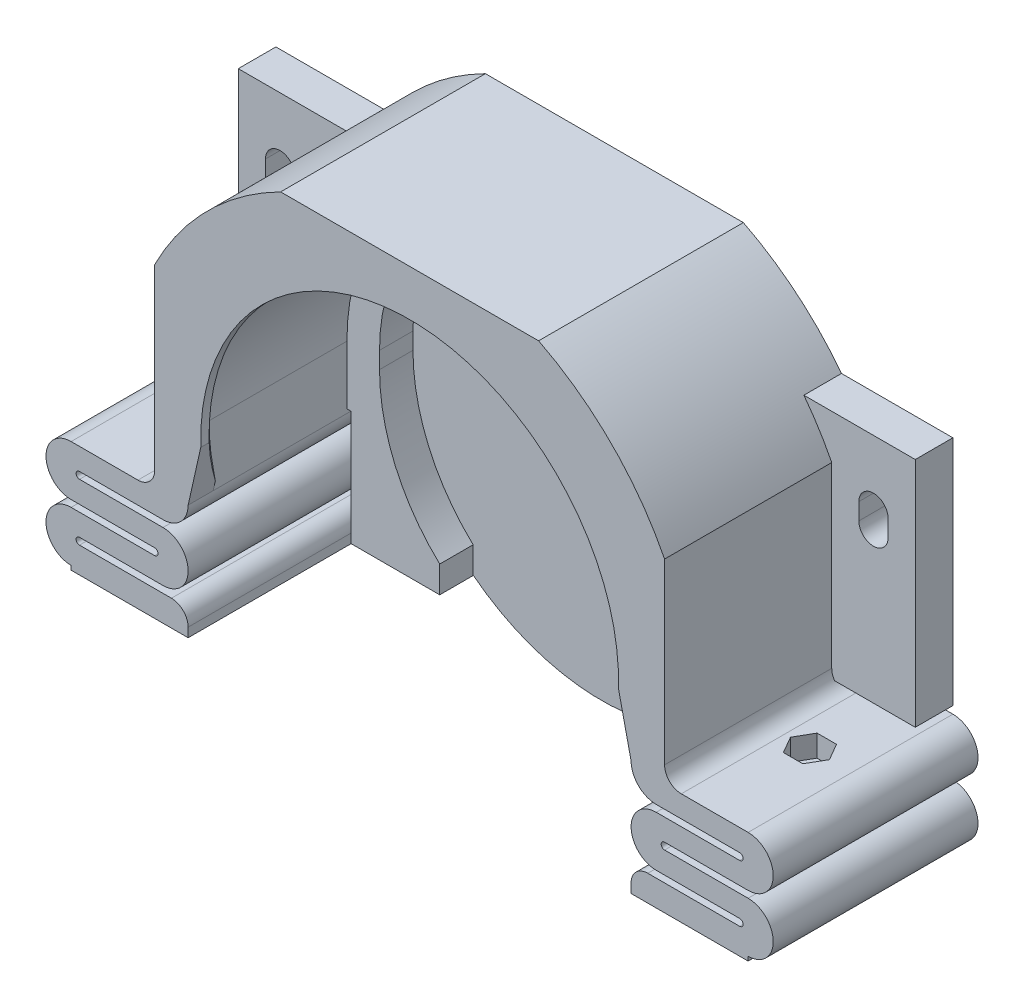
ISO-10303-21;
HEADER;
FILE_DESCRIPTION(('STEP AP214'),'2;1');
FILE_NAME('part.step','',(''),(''),'','','');
FILE_SCHEMA(('AUTOMOTIVE_DESIGN { 1 0 10303 214 1 1 1 1 }'));
ENDSEC;
DATA;
#1=APPLICATION_CONTEXT('core data for automotive mechanical design processes');
#2=APPLICATION_PROTOCOL_DEFINITION('international standard','automotive_design',2000,#1);
#3=PRODUCT_CONTEXT('',#1,'mechanical');
#4=PRODUCT('Part','Part','',(#3));
#5=PRODUCT_RELATED_PRODUCT_CATEGORY('part','',(#4));
#6=PRODUCT_DEFINITION_FORMATION('','',#4);
#7=PRODUCT_DEFINITION_CONTEXT('part definition',#1,'design');
#8=PRODUCT_DEFINITION('design','',#6,#7);
#9=PRODUCT_DEFINITION_SHAPE('','',#8);
#10=(LENGTH_UNIT() NAMED_UNIT(*) SI_UNIT(.MILLI.,.METRE.));
#11=(NAMED_UNIT(*) PLANE_ANGLE_UNIT() SI_UNIT($,.RADIAN.));
#12=(NAMED_UNIT(*) SI_UNIT($,.STERADIAN.) SOLID_ANGLE_UNIT());
#13=UNCERTAINTY_MEASURE_WITH_UNIT(LENGTH_MEASURE(1.E-05),#10,'distance_accuracy_value','');
#14=(GEOMETRIC_REPRESENTATION_CONTEXT(3) GLOBAL_UNCERTAINTY_ASSIGNED_CONTEXT((#13)) GLOBAL_UNIT_ASSIGNED_CONTEXT((#10,
#11,#12)) REPRESENTATION_CONTEXT('',''));
#15=CARTESIAN_POINT('',(0.,0.,0.));
#16=DIRECTION('',(0.,0.,1.));
#17=DIRECTION('',(1.,0.,0.));
#18=AXIS2_PLACEMENT_3D('',#15,#16,#17);
#19=CARTESIAN_POINT('',(0.,0.,21.5));
#20=DIRECTION('',(0.,0.,1.));
#21=DIRECTION('',(1.,0.,0.));
#22=AXIS2_PLACEMENT_3D('',#19,#20,#21);
#23=PLANE('',#22);
#24=DIRECTION('',(0.218732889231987,-0.975784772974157,0.));
#25=VECTOR('',#24,1.);
#26=CARTESIAN_POINT('',(26.5,-7.49574841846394,21.5));
#27=LINE('',#26,#25);
#28=CARTESIAN_POINT('',(26.2429243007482,-6.34891332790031,21.5));
#29=VERTEX_POINT('',#28);
#30=CARTESIAN_POINT('',(26.5,-7.49574841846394,21.5));
#31=VERTEX_POINT('',#30);
#32=EDGE_CURVE('E906',#29,#31,#27,.T.);
#33=ORIENTED_EDGE('',*,*,#32,.F.);
#34=CARTESIAN_POINT('',(0.,0.,21.5));
#35=DIRECTION('',(0.,0.,1.));
#36=DIRECTION('',(1.,0.,0.));
#37=AXIS2_PLACEMENT_3D('',#34,#35,#36);
#38=CIRCLE('',#37,26.9999958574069);
#39=CARTESIAN_POINT('',(26.5,-5.17201859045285,21.5));
#40=VERTEX_POINT('',#39);
#41=EDGE_CURVE('E2210',#29,#40,#38,.T.);
#42=ORIENTED_EDGE('',*,*,#41,.T.);
#43=DIRECTION('',(0.,1.,0.));
#44=VECTOR('',#43,1.);
#45=CARTESIAN_POINT('',(26.5,0.,21.5));
#46=LINE('',#45,#44);
#47=EDGE_CURVE('E2200',#31,#40,#46,.T.);
#48=ORIENTED_EDGE('',*,*,#47,.F.);
#49=EDGE_LOOP('',(#33,#42,#48));
#50=FACE_BOUND('',#49,.T.);
#51=ADVANCED_FACE('F41',(#50),#23,.F.);
#52=CARTESIAN_POINT('',(26.5,-7.49574841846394,0.));
#53=DIRECTION('',(1.,0.,0.));
#54=DIRECTION('',(0.,0.,-1.));
#55=AXIS2_PLACEMENT_3D('',#52,#53,#54);
#56=PLANE('',#55);
#57=ORIENTED_EDGE('',*,*,#47,.T.);
#58=CARTESIAN_POINT('',(26.5,-5.17201859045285,21.5));
#59=CARTESIAN_POINT('',(26.5,-4.74566704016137,21.5817123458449));
#60=CARTESIAN_POINT('',(26.5,-4.31746385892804,21.653967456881));
#61=CARTESIAN_POINT('',(26.5,-3.45915741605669,21.778535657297));
#62=CARTESIAN_POINT('',(26.5,-3.029060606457,21.8308932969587));
#63=CARTESIAN_POINT('',(26.5,-2.16681014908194,21.915018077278));
#64=CARTESIAN_POINT('',(26.5,-1.7346563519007,21.9467836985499));
#65=CARTESIAN_POINT('',(26.5,-0.868342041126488,21.9893257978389));
#66=CARTESIAN_POINT('',(26.5,-0.434179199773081,22.0000547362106));
#67=CARTESIAN_POINT('',(26.5,0.,21.9999958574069));
#68=B_SPLINE_CURVE_WITH_KNOTS('',3,(#58,#59,#60,#61,#62,#63,#64,#65,#66,#67),.UNSPECIFIED.,.F.,
.F.,(4,2,2,2,4),(0.,1.30228403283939,2.60163483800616,3.90108150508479,5.2034613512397),.UNSPECIFIED.);
#69=CARTESIAN_POINT('',(26.5,0.,21.9999958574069));
#70=VERTEX_POINT('',#69);
#71=EDGE_CURVE('E2178',#40,#70,#68,.T.);
#72=ORIENTED_EDGE('',*,*,#71,.T.);
#73=DIRECTION('',(0.,0.,1.));
#74=VECTOR('',#73,1.);
#75=CARTESIAN_POINT('',(26.5,0.,5.5));
#76=LINE('',#75,#74);
#77=CARTESIAN_POINT('',(26.5,0.,5.5));
#78=VERTEX_POINT('',#77);
#79=EDGE_CURVE('E69',#78,#70,#76,.T.);
#80=ORIENTED_EDGE('',*,*,#79,.F.);
#81=DIRECTION('',(0.,1.,0.));
#82=VECTOR('',#81,1.);
#83=CARTESIAN_POINT('',(26.5,0.,5.5));
#84=LINE('',#83,#82);
#85=CARTESIAN_POINT('',(26.5,-7.01450930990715,5.5));
#86=VERTEX_POINT('',#85);
#87=EDGE_CURVE('E1300',#86,#78,#84,.T.);
#88=ORIENTED_EDGE('',*,*,#87,.F.);
#89=DIRECTION('',(0.,0.,1.));
#90=VECTOR('',#89,1.);
#91=CARTESIAN_POINT('',(26.5,-7.01450930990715,0.));
#92=LINE('',#91,#90);
#93=CARTESIAN_POINT('',(26.5,-7.01450930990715,0.));
#94=VERTEX_POINT('',#93);
#95=EDGE_CURVE('E1596',#94,#86,#92,.T.);
#96=ORIENTED_EDGE('',*,*,#95,.F.);
#97=DIRECTION('',(0.,1.,0.));
#98=VECTOR('',#97,1.);
#99=CARTESIAN_POINT('',(26.5,-7.49574841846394,0.));
#100=LINE('',#99,#98);
#101=CARTESIAN_POINT('',(26.5,-7.49574841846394,0.));
#102=VERTEX_POINT('',#101);
#103=EDGE_CURVE('E1727',#102,#94,#100,.T.);
#104=ORIENTED_EDGE('',*,*,#103,.F.);
#105=DIRECTION('',(0.,0.,1.));
#106=VECTOR('',#105,1.);
#107=CARTESIAN_POINT('',(26.5,-7.49574841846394,0.));
#108=LINE('',#107,#106);
#109=EDGE_CURVE('E1593',#102,#31,#108,.T.);
#110=ORIENTED_EDGE('',*,*,#109,.T.);
#111=EDGE_LOOP('',(#57,#72,#80,#88,#96,#104,#110));
#112=FACE_BOUND('',#111,.T.);
#113=ADVANCED_FACE('F2158',(#112),#56,.F.);
#114=CARTESIAN_POINT('',(-26.5,-7.49574841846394,0.));
#115=DIRECTION('',(1.,0.,0.));
#116=DIRECTION('',(0.,0.,-1.));
#117=AXIS2_PLACEMENT_3D('',#114,#115,#116);
#118=PLANE('',#117);
#119=DIRECTION('',(0.,0.,1.));
#120=VECTOR('',#119,1.);
#121=CARTESIAN_POINT('',(-26.5,0.,5.5));
#122=LINE('',#121,#120);
#123=CARTESIAN_POINT('',(-26.5,0.,5.5));
#124=VERTEX_POINT('',#123);
#125=CARTESIAN_POINT('',(-26.5,0.,21.9999958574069));
#126=VERTEX_POINT('',#125);
#127=EDGE_CURVE('E62',#124,#126,#122,.T.);
#128=ORIENTED_EDGE('',*,*,#127,.T.);
#129=CARTESIAN_POINT('',(-26.5,0.,21.9999958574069));
#130=CARTESIAN_POINT('',(-26.5,-0.434179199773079,22.0000547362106));
#131=CARTESIAN_POINT('',(-26.5,-0.868342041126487,21.9893257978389));
#132=CARTESIAN_POINT('',(-26.5,-1.7346563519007,21.9467836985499));
#133=CARTESIAN_POINT('',(-26.5,-2.16681014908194,21.915018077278));
#134=CARTESIAN_POINT('',(-26.5,-3.029060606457,21.8308932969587));
#135=CARTESIAN_POINT('',(-26.5,-3.45915741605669,21.778535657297));
#136=CARTESIAN_POINT('',(-26.5,-4.31746385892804,21.653967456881));
#137=CARTESIAN_POINT('',(-26.5,-4.74566704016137,21.5817123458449));
#138=CARTESIAN_POINT('',(-26.5,-5.17201859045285,21.5));
#139=B_SPLINE_CURVE_WITH_KNOTS('',3,(#129,#130,#131,#132,#133,#134,#135,#136,#137,#138),
.UNSPECIFIED.,.F.,.F.,(4,2,2,2,4),(0.,1.30237984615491,2.60182651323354,3.90117731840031,
5.2034613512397),.UNSPECIFIED.);
#140=CARTESIAN_POINT('',(-26.5,-5.17201859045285,21.5));
#141=VERTEX_POINT('',#140);
#142=EDGE_CURVE('E11',#126,#141,#139,.T.);
#143=ORIENTED_EDGE('',*,*,#142,.T.);
#144=DIRECTION('',(0.,-1.,0.));
#145=VECTOR('',#144,1.);
#146=CARTESIAN_POINT('',(-26.5,0.,21.5));
#147=LINE('',#146,#145);
#148=CARTESIAN_POINT('',(-26.5,-7.49574841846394,21.5));
#149=VERTEX_POINT('',#148);
#150=EDGE_CURVE('E2196',#141,#149,#147,.T.);
#151=ORIENTED_EDGE('',*,*,#150,.T.);
#152=DIRECTION('',(0.,0.,1.));
#153=VECTOR('',#152,1.);
#154=CARTESIAN_POINT('',(-26.5,-7.49574841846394,0.));
#155=LINE('',#154,#153);
#156=CARTESIAN_POINT('',(-26.5,-7.49574841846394,0.));
#157=VERTEX_POINT('',#156);
#158=EDGE_CURVE('E1490',#157,#149,#155,.T.);
#159=ORIENTED_EDGE('',*,*,#158,.F.);
#160=DIRECTION('',(0.,1.,0.));
#161=VECTOR('',#160,1.);
#162=CARTESIAN_POINT('',(-26.5,-7.49574841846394,0.));
#163=LINE('',#162,#161);
#164=CARTESIAN_POINT('',(-26.5,-7.01450930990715,0.));
#165=VERTEX_POINT('',#164);
#166=EDGE_CURVE('E1448',#157,#165,#163,.T.);
#167=ORIENTED_EDGE('',*,*,#166,.T.);
#168=DIRECTION('',(0.,0.,1.));
#169=VECTOR('',#168,1.);
#170=CARTESIAN_POINT('',(-26.5,-7.01450930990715,0.));
#171=LINE('',#170,#169);
#172=CARTESIAN_POINT('',(-26.5,-7.01450930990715,5.5));
#173=VERTEX_POINT('',#172);
#174=EDGE_CURVE('E1487',#165,#173,#171,.T.);
#175=ORIENTED_EDGE('',*,*,#174,.T.);
#176=DIRECTION('',(0.,-1.,0.));
#177=VECTOR('',#176,1.);
#178=CARTESIAN_POINT('',(-26.5,0.,5.5));
#179=LINE('',#178,#177);
#180=EDGE_CURVE('E1298',#124,#173,#179,.T.);
#181=ORIENTED_EDGE('',*,*,#180,.F.);
#182=EDGE_LOOP('',(#128,#143,#151,#159,#167,#175,#181));
#183=FACE_BOUND('',#182,.T.);
#184=ADVANCED_FACE('F2007',(#183),#118,.T.);
#185=CARTESIAN_POINT('',(0.,0.,5.5));
#186=DIRECTION('',(0.,0.,1.));
#187=DIRECTION('',(1.,0.,0.));
#188=AXIS2_PLACEMENT_3D('',#185,#186,#187);
#189=CYLINDRICAL_SURFACE('',#188,26.5);
#190=ORIENTED_EDGE('',*,*,#79,.T.);
#191=CARTESIAN_POINT('',(0.,0.,21.9999958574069));
#192=DIRECTION('',(0.,0.,-1.));
#193=DIRECTION('',(-1.,0.,0.));
#194=AXIS2_PLACEMENT_3D('',#191,#192,#193);
#195=CIRCLE('',#194,26.5);
#196=EDGE_CURVE('E56',#70,#126,#195,.F.);
#197=ORIENTED_EDGE('',*,*,#196,.T.);
#198=ORIENTED_EDGE('',*,*,#127,.F.);
#199=CARTESIAN_POINT('',(0.,0.,5.5));
#200=DIRECTION('',(0.,0.,1.));
#201=DIRECTION('',(1.,0.,0.));
#202=AXIS2_PLACEMENT_3D('',#199,#200,#201);
#203=CIRCLE('',#202,26.5);
#204=EDGE_CURVE('E1295',#78,#124,#203,.T.);
#205=ORIENTED_EDGE('',*,*,#204,.F.);
#206=EDGE_LOOP('',(#190,#197,#198,#205));
#207=FACE_BOUND('',#206,.T.);
#208=ADVANCED_FACE('F2003',(#207),#189,.F.);
#209=CARTESIAN_POINT('',(0.,0.999998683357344,1.5));
#210=DIRECTION('',(0.,0.,1.));
#211=DIRECTION('',(1.,0.,0.));
#212=AXIS2_PLACEMENT_3D('',#209,#210,#211);
#213=PLANE('',#212);
#214=DIRECTION('',(0.,1.,0.));
#215=VECTOR('',#214,1.);
#216=CARTESIAN_POINT('',(15.396374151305,-17.5442440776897,1.5));
#217=LINE('',#216,#215);
#218=CARTESIAN_POINT('',(15.396374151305,-20.7364,1.5));
#219=VERTEX_POINT('',#218);
#220=CARTESIAN_POINT('',(15.396374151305,-17.5442440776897,1.5));
#221=VERTEX_POINT('',#220);
#222=EDGE_CURVE('E1340',#219,#221,#217,.T.);
#223=ORIENTED_EDGE('',*,*,#222,.T.);
#224=CARTESIAN_POINT('',(0.,-1.00001055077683,1.5));
#225=DIRECTION('',(0.,0.,1.));
#226=DIRECTION('',(1.,0.,0.));
#227=AXIS2_PLACEMENT_3D('',#224,#225,#226);
#228=CIRCLE('',#227,22.6);
#229=CARTESIAN_POINT('',(22.6,-1.00001055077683,1.5));
#230=VERTEX_POINT('',#229);
#231=EDGE_CURVE('E1342',#221,#230,#228,.T.);
#232=ORIENTED_EDGE('',*,*,#231,.T.);
#233=DIRECTION('',(0.,1.,0.));
#234=VECTOR('',#233,1.);
#235=CARTESIAN_POINT('',(22.6,0.999998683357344,1.5));
#236=LINE('',#235,#234);
#237=CARTESIAN_POINT('',(22.6,0.999998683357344,1.5));
#238=VERTEX_POINT('',#237);
#239=EDGE_CURVE('E1345',#230,#238,#236,.T.);
#240=ORIENTED_EDGE('',*,*,#239,.T.);
#241=CARTESIAN_POINT('',(0.,0.999998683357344,1.5));
#242=DIRECTION('',(0.,0.,1.));
#243=DIRECTION('',(1.,0.,0.));
#244=AXIS2_PLACEMENT_3D('',#241,#242,#243);
#245=CIRCLE('',#244,22.6);
#246=CARTESIAN_POINT('',(-22.6,0.999998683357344,1.5));
#247=VERTEX_POINT('',#246);
#248=EDGE_CURVE('E1329',#238,#247,#245,.T.);
#249=ORIENTED_EDGE('',*,*,#248,.T.);
#250=DIRECTION('',(0.,-1.,0.));
#251=VECTOR('',#250,1.);
#252=CARTESIAN_POINT('',(-22.6,0.999998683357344,1.5));
#253=LINE('',#252,#251);
#254=CARTESIAN_POINT('',(-22.6,-1.00001055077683,1.5));
#255=VERTEX_POINT('',#254);
#256=EDGE_CURVE('E1332',#247,#255,#253,.T.);
#257=ORIENTED_EDGE('',*,*,#256,.T.);
#258=CARTESIAN_POINT('',(0.,-1.00001055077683,1.5));
#259=DIRECTION('',(0.,0.,1.));
#260=DIRECTION('',(1.,0.,0.));
#261=AXIS2_PLACEMENT_3D('',#258,#259,#260);
#262=CIRCLE('',#261,22.6);
#263=CARTESIAN_POINT('',(-15.396374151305,-17.5442440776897,1.5));
#264=VERTEX_POINT('',#263);
#265=EDGE_CURVE('E1335',#255,#264,#262,.T.);
#266=ORIENTED_EDGE('',*,*,#265,.T.);
#267=DIRECTION('',(0.,-1.,0.));
#268=VECTOR('',#267,1.);
#269=CARTESIAN_POINT('',(-15.396374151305,-17.5442440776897,1.5));
#270=LINE('',#269,#268);
#271=CARTESIAN_POINT('',(-15.396374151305,-20.7364,1.5));
#272=VERTEX_POINT('',#271);
#273=EDGE_CURVE('E1338',#264,#272,#270,.T.);
#274=ORIENTED_EDGE('',*,*,#273,.T.);
#275=DIRECTION('',(1.,0.,0.));
#276=VECTOR('',#275,1.);
#277=CARTESIAN_POINT('',(-40.5,-20.7364,1.5));
#278=LINE('',#277,#276);
#279=CARTESIAN_POINT('',(-15.3451924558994,-20.7364,1.5));
#280=VERTEX_POINT('',#279);
#281=EDGE_CURVE('E1367',#272,#280,#278,.T.);
#282=ORIENTED_EDGE('',*,*,#281,.T.);
#283=CARTESIAN_POINT('',(0.,-1.00001055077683,1.5));
#284=DIRECTION('',(0.,0.,1.));
#285=DIRECTION('',(1.,0.,0.));
#286=AXIS2_PLACEMENT_3D('',#283,#284,#285);
#287=CIRCLE('',#286,25.);
#288=CARTESIAN_POINT('',(15.3451924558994,-20.7364,1.5));
#289=VERTEX_POINT('',#288);
#290=EDGE_CURVE('E1233',#289,#280,#287,.F.);
#291=ORIENTED_EDGE('',*,*,#290,.F.);
#292=EDGE_CURVE('E1352',#289,#219,#278,.T.);
#293=ORIENTED_EDGE('',*,*,#292,.T.);
#294=EDGE_LOOP('',(#223,#232,#240,#249,#257,#266,#274,#282,#291,#293));
#295=FACE_BOUND('',#294,.T.);
#296=CARTESIAN_POINT('',(0.,0.,1.5));
#297=DIRECTION('',(0.,0.,1.));
#298=DIRECTION('',(1.,0.,0.));
#299=AXIS2_PLACEMENT_3D('',#296,#297,#298);
#300=CIRCLE('',#299,6.);
#301=CARTESIAN_POINT('',(6.,0.,1.5));
#302=VERTEX_POINT('',#301);
#303=EDGE_CURVE('E924',#302,#302,#300,.T.);
#304=ORIENTED_EDGE('',*,*,#303,.F.);
#305=EDGE_LOOP('',(#304));
#306=FACE_BOUND('',#305,.T.);
#307=ADVANCED_FACE('F2006',(#295,#306),#213,.T.);
#308=CARTESIAN_POINT('',(0.,0.,0.));
#309=DIRECTION('',(0.,0.,1.));
#310=DIRECTION('',(1.,0.,0.));
#311=AXIS2_PLACEMENT_3D('',#308,#309,#310);
#312=PLANE('',#311);
#313=CARTESIAN_POINT('',(35.4999954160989,11.0000427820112,0.));
#314=DIRECTION('',(0.,0.,1.));
#315=DIRECTION('',(-1.,0.,0.));
#316=AXIS2_PLACEMENT_3D('',#313,#314,#315);
#317=CIRCLE('',#316,1.75004278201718);
#318=CARTESIAN_POINT('',(33.7499526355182,11.0001136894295,0.));
#319=VERTEX_POINT('',#318);
#320=CARTESIAN_POINT('',(37.2500381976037,11.0000851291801,0.));
#321=VERTEX_POINT('',#320);
#322=EDGE_CURVE('E1210',#319,#321,#317,.T.);
#323=ORIENTED_EDGE('',*,*,#322,.T.);
#324=DIRECTION('',(-2.41977906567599E-05,0.999999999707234,0.));
#325=VECTOR('',#324,1.);
#326=CARTESIAN_POINT('',(37.2499898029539,13.0000466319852,0.));
#327=LINE('',#326,#325);
#328=CARTESIAN_POINT('',(37.2499898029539,13.0000466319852,0.));
#329=VERTEX_POINT('',#328);
#330=EDGE_CURVE('E1236',#321,#329,#327,.T.);
#331=ORIENTED_EDGE('',*,*,#330,.T.);
#332=CARTESIAN_POINT('',(35.5000117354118,13.0000466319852,0.));
#333=DIRECTION('',(0.,0.,1.));
#334=DIRECTION('',(-1.,0.,0.));
#335=AXIS2_PLACEMENT_3D('',#332,#333,#334);
#336=CIRCLE('',#335,1.7499780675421);
#337=CARTESIAN_POINT('',(33.7500336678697,13.0000466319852,0.));
#338=VERTEX_POINT('',#337);
#339=EDGE_CURVE('E1239',#329,#338,#336,.T.);
#340=ORIENTED_EDGE('',*,*,#339,.T.);
#341=DIRECTION('',(-4.05175342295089E-05,-0.999999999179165,0.));
#342=VECTOR('',#341,1.);
#343=CARTESIAN_POINT('',(33.7499526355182,11.0001136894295,0.));
#344=LINE('',#343,#342);
#345=EDGE_CURVE('E1242',#338,#319,#344,.T.);
#346=ORIENTED_EDGE('',*,*,#345,.T.);
#347=EDGE_LOOP('',(#323,#331,#340,#346));
#348=FACE_BOUND('',#347,.T.);
#349=DIRECTION('',(1.,0.,0.));
#350=VECTOR('',#349,1.);
#351=CARTESIAN_POINT('',(-40.5,-20.7364,0.));
#352=LINE('',#351,#350);
#353=CARTESIAN_POINT('',(15.3451924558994,-20.7364,0.));
#354=VERTEX_POINT('',#353);
#355=CARTESIAN_POINT('',(26.0349990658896,-20.7364,0.));
#356=VERTEX_POINT('',#355);
#357=EDGE_CURVE('E1770',#354,#356,#352,.T.);
#358=ORIENTED_EDGE('',*,*,#357,.F.);
#359=CARTESIAN_POINT('',(0.,-1.00001055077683,0.));
#360=DIRECTION('',(0.,0.,-1.));
#361=DIRECTION('',(-1.,0.,0.));
#362=AXIS2_PLACEMENT_3D('',#359,#360,#361);
#363=CIRCLE('',#362,25.);
#364=CARTESIAN_POINT('',(-15.3451924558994,-20.7364,0.));
#365=VERTEX_POINT('',#364);
#366=EDGE_CURVE('E1253',#354,#365,#363,.T.);
#367=ORIENTED_EDGE('',*,*,#366,.T.);
#368=CARTESIAN_POINT('',(-26.0349990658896,-20.7364,0.));
#369=VERTEX_POINT('',#368);
#370=EDGE_CURVE('E1747',#369,#365,#352,.T.);
#371=ORIENTED_EDGE('',*,*,#370,.F.);
#372=DIRECTION('',(0.,-1.,0.));
#373=VECTOR('',#372,1.);
#374=CARTESIAN_POINT('',(-26.0349990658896,-7.01450930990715,0.));
#375=LINE('',#374,#373);
#376=CARTESIAN_POINT('',(-26.0349990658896,-7.01450930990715,0.));
#377=VERTEX_POINT('',#376);
#378=EDGE_CURVE('E1546',#377,#369,#375,.T.);
#379=ORIENTED_EDGE('',*,*,#378,.F.);
#380=DIRECTION('',(1.,0.,0.));
#381=VECTOR('',#380,1.);
#382=CARTESIAN_POINT('',(-26.5,-7.01450930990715,0.));
#383=LINE('',#382,#381);
#384=EDGE_CURVE('E1544',#165,#377,#383,.T.);
#385=ORIENTED_EDGE('',*,*,#384,.F.);
#386=ORIENTED_EDGE('',*,*,#166,.F.);
#387=CARTESIAN_POINT('',(-29.5058073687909,-7.49574841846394,0.));
#388=DIRECTION('',(0.,0.,-1.));
#389=DIRECTION('',(-1.,0.,0.));
#390=AXIS2_PLACEMENT_3D('',#387,#388,#389);
#391=CIRCLE('',#390,3.00580736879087);
#392=CARTESIAN_POINT('',(-29.5058073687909,-10.5015557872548,0.));
#393=VERTEX_POINT('',#392);
#394=EDGE_CURVE('E1498',#157,#393,#391,.T.);
#395=ORIENTED_EDGE('',*,*,#394,.T.);
#396=DIRECTION('',(1.,0.,0.));
#397=VECTOR('',#396,1.);
#398=CARTESIAN_POINT('',(-39.5,-10.5015557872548,0.));
#399=LINE('',#398,#397);
#400=CARTESIAN_POINT('',(-39.5,-10.5015557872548,0.));
#401=VERTEX_POINT('',#400);
#402=EDGE_CURVE('E1586',#401,#393,#399,.T.);
#403=ORIENTED_EDGE('',*,*,#402,.F.);
#404=CARTESIAN_POINT('',(-39.5,-10.9073631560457,0.));
#405=DIRECTION('',(0.,0.,1.));
#406=DIRECTION('',(1.,0.,0.));
#407=AXIS2_PLACEMENT_3D('',#404,#405,#406);
#408=CIRCLE('',#407,0.405807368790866);
#409=CARTESIAN_POINT('',(-39.5,-11.3131705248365,0.));
#410=VERTEX_POINT('',#409);
#411=EDGE_CURVE('E1583',#401,#410,#408,.T.);
#412=ORIENTED_EDGE('',*,*,#411,.T.);
#413=DIRECTION('',(-1.,0.,0.));
#414=VECTOR('',#413,1.);
#415=CARTESIAN_POINT('',(-29.5058073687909,-11.3131705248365,0.));
#416=LINE('',#415,#414);
#417=CARTESIAN_POINT('',(-29.5058073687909,-11.3131705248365,0.));
#418=VERTEX_POINT('',#417);
#419=EDGE_CURVE('E1581',#418,#410,#416,.T.);
#420=ORIENTED_EDGE('',*,*,#419,.F.);
#421=CARTESIAN_POINT('',(-29.5058073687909,-14.3189778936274,0.));
#422=DIRECTION('',(0.,0.,-1.));
#423=DIRECTION('',(-1.,0.,0.));
#424=AXIS2_PLACEMENT_3D('',#421,#422,#423);
#425=CIRCLE('',#424,3.00580736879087);
#426=CARTESIAN_POINT('',(-29.5058073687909,-17.3247852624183,0.));
#427=VERTEX_POINT('',#426);
#428=EDGE_CURVE('E1578',#418,#427,#425,.T.);
#429=ORIENTED_EDGE('',*,*,#428,.T.);
#430=DIRECTION('',(1.,0.,0.));
#431=VECTOR('',#430,1.);
#432=CARTESIAN_POINT('',(-39.5,-17.3247852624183,0.));
#433=LINE('',#432,#431);
#434=CARTESIAN_POINT('',(-39.5,-17.3247852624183,0.));
#435=VERTEX_POINT('',#434);
#436=EDGE_CURVE('E1576',#435,#427,#433,.T.);
#437=ORIENTED_EDGE('',*,*,#436,.F.);
#438=CARTESIAN_POINT('',(-39.5,-17.7305926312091,0.));
#439=DIRECTION('',(0.,0.,1.));
#440=DIRECTION('',(1.,0.,0.));
#441=AXIS2_PLACEMENT_3D('',#438,#439,#440);
#442=CIRCLE('',#441,0.405807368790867);
#443=CARTESIAN_POINT('',(-39.5,-18.1364,0.));
#444=VERTEX_POINT('',#443);
#445=EDGE_CURVE('E1573',#435,#444,#442,.T.);
#446=ORIENTED_EDGE('',*,*,#445,.T.);
#447=DIRECTION('',(1.,0.,0.));
#448=VECTOR('',#447,1.);
#449=CARTESIAN_POINT('',(-39.5,-18.1364,0.));
#450=LINE('',#449,#448);
#451=CARTESIAN_POINT('',(-28.5,-18.1364,0.));
#452=VERTEX_POINT('',#451);
#453=EDGE_CURVE('E1570',#444,#452,#450,.T.);
#454=ORIENTED_EDGE('',*,*,#453,.T.);
#455=CARTESIAN_POINT('',(-28.5,-20.1364,0.));
#456=DIRECTION('',(0.,0.,-1.));
#457=DIRECTION('',(-1.,0.,0.));
#458=AXIS2_PLACEMENT_3D('',#455,#456,#457);
#459=CIRCLE('',#458,2.);
#460=CARTESIAN_POINT('',(-26.5,-20.1364,0.));
#461=VERTEX_POINT('',#460);
#462=EDGE_CURVE('E1567',#452,#461,#459,.T.);
#463=ORIENTED_EDGE('',*,*,#462,.T.);
#464=DIRECTION('',(0.,-1.,0.));
#465=VECTOR('',#464,1.);
#466=CARTESIAN_POINT('',(-26.5,-20.1364,0.));
#467=LINE('',#466,#465);
#468=CARTESIAN_POINT('',(-26.5,-21.2364,0.));
#469=VERTEX_POINT('',#468);
#470=EDGE_CURVE('E1565',#461,#469,#467,.T.);
#471=ORIENTED_EDGE('',*,*,#470,.T.);
#472=DIRECTION('',(1.,0.,0.));
#473=VECTOR('',#472,1.);
#474=CARTESIAN_POINT('',(-40.5,-21.2364,0.));
#475=LINE('',#474,#473);
#476=CARTESIAN_POINT('',(-40.5,-21.2364,0.));
#477=VERTEX_POINT('',#476);
#478=EDGE_CURVE('E1283',#477,#469,#475,.T.);
#479=ORIENTED_EDGE('',*,*,#478,.F.);
#480=DIRECTION('',(0.,1.,0.));
#481=VECTOR('',#480,1.);
#482=CARTESIAN_POINT('',(-40.5,-21.2364,0.));
#483=LINE('',#482,#481);
#484=CARTESIAN_POINT('',(-40.5,-20.7364,0.));
#485=VERTEX_POINT('',#484);
#486=EDGE_CURVE('E1293',#477,#485,#483,.T.);
#487=ORIENTED_EDGE('',*,*,#486,.T.);
#488=CARTESIAN_POINT('',(-40.5,-17.7305926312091,0.));
#489=DIRECTION('',(0.,0.,1.));
#490=DIRECTION('',(1.,0.,0.));
#491=AXIS2_PLACEMENT_3D('',#488,#489,#490);
#492=CIRCLE('',#491,3.00580736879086);
#493=CARTESIAN_POINT('',(-40.5,-14.7247852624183,0.));
#494=VERTEX_POINT('',#493);
#495=EDGE_CURVE('E1562',#494,#485,#492,.T.);
#496=ORIENTED_EDGE('',*,*,#495,.F.);
#497=DIRECTION('',(-1.,0.,0.));
#498=VECTOR('',#497,1.);
#499=CARTESIAN_POINT('',(-30.5058073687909,-14.7247852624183,0.));
#500=LINE('',#499,#498);
#501=CARTESIAN_POINT('',(-30.5058073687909,-14.7247852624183,0.));
#502=VERTEX_POINT('',#501);
#503=EDGE_CURVE('E1559',#502,#494,#500,.T.);
#504=ORIENTED_EDGE('',*,*,#503,.F.);
#505=CARTESIAN_POINT('',(-30.5058073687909,-14.3189778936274,0.));
#506=DIRECTION('',(0.,0.,-1.));
#507=DIRECTION('',(-1.,0.,0.));
#508=AXIS2_PLACEMENT_3D('',#505,#506,#507);
#509=CIRCLE('',#508,0.405807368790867);
#510=CARTESIAN_POINT('',(-30.5058073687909,-13.9131705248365,0.));
#511=VERTEX_POINT('',#510);
#512=EDGE_CURVE('E1557',#511,#502,#509,.T.);
#513=ORIENTED_EDGE('',*,*,#512,.F.);
#514=DIRECTION('',(1.,0.,0.));
#515=VECTOR('',#514,1.);
#516=CARTESIAN_POINT('',(-40.5,-13.9131705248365,0.));
#517=LINE('',#516,#515);
#518=CARTESIAN_POINT('',(-40.5,-13.9131705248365,0.));
#519=VERTEX_POINT('',#518);
#520=EDGE_CURVE('E1555',#519,#511,#517,.T.);
#521=ORIENTED_EDGE('',*,*,#520,.F.);
#522=CARTESIAN_POINT('',(-40.5,-10.9073631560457,0.));
#523=DIRECTION('',(0.,0.,1.));
#524=DIRECTION('',(1.,0.,0.));
#525=AXIS2_PLACEMENT_3D('',#522,#523,#524);
#526=CIRCLE('',#525,3.00580736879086);
#527=CARTESIAN_POINT('',(-40.5,-7.90155578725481,0.));
#528=VERTEX_POINT('',#527);
#529=EDGE_CURVE('E1553',#528,#519,#526,.T.);
#530=ORIENTED_EDGE('',*,*,#529,.F.);
#531=DIRECTION('',(1.,0.,0.));
#532=VECTOR('',#531,1.);
#533=CARTESIAN_POINT('',(-40.5,-7.90155578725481,0.));
#534=LINE('',#533,#532);
#535=CARTESIAN_POINT('',(-32.5058073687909,-7.90155578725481,0.));
#536=VERTEX_POINT('',#535);
#537=EDGE_CURVE('E1550',#528,#536,#534,.T.);
#538=ORIENTED_EDGE('',*,*,#537,.T.);
#539=CARTESIAN_POINT('',(-32.5058073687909,-5.90155578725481,0.));
#540=DIRECTION('',(0.,0.,-1.));
#541=DIRECTION('',(-1.,0.,0.));
#542=AXIS2_PLACEMENT_3D('',#539,#540,#541);
#543=CIRCLE('',#542,2.);
#544=CARTESIAN_POINT('',(-30.8440810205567,-7.01450930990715,0.));
#545=VERTEX_POINT('',#544);
#546=EDGE_CURVE('E1548',#545,#536,#543,.T.);
#547=ORIENTED_EDGE('',*,*,#546,.F.);
#548=DIRECTION('',(1.,0.,0.));
#549=VECTOR('',#548,1.);
#550=CARTESIAN_POINT('',(0.,-7.01450930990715,0.));
#551=LINE('',#550,#549);
#552=CARTESIAN_POINT('',(-40.5,-7.01450930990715,0.));
#553=VERTEX_POINT('',#552);
#554=EDGE_CURVE('E1789',#553,#545,#551,.T.);
#555=ORIENTED_EDGE('',*,*,#554,.F.);
#556=DIRECTION('',(0.,-1.,0.));
#557=VECTOR('',#556,1.);
#558=CARTESIAN_POINT('',(-40.5,20.7364,0.));
#559=LINE('',#558,#557);
#560=CARTESIAN_POINT('',(-40.5,20.7364,0.));
#561=VERTEX_POINT('',#560);
#562=EDGE_CURVE('E1767',#561,#553,#559,.T.);
#563=ORIENTED_EDGE('',*,*,#562,.F.);
#564=DIRECTION('',(-1.,0.,0.));
#565=VECTOR('',#564,1.);
#566=CARTESIAN_POINT('',(-40.5,20.7364,0.));
#567=LINE('',#566,#565);
#568=CARTESIAN_POINT('',(-27.1740674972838,20.7364,0.));
#569=VERTEX_POINT('',#568);
#570=EDGE_CURVE('E1764',#569,#561,#567,.T.);
#571=ORIENTED_EDGE('',*,*,#570,.F.);
#572=CARTESIAN_POINT('',(0.,0.,0.));
#573=DIRECTION('',(0.,0.,1.));
#574=DIRECTION('',(1.,0.,0.));
#575=AXIS2_PLACEMENT_3D('',#572,#573,#574);
#576=CIRCLE('',#575,34.182279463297);
#577=CARTESIAN_POINT('',(-15.4330239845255,30.5,0.));
#578=VERTEX_POINT('',#577);
#579=EDGE_CURVE('E1761',#578,#569,#576,.T.);
#580=ORIENTED_EDGE('',*,*,#579,.F.);
#581=DIRECTION('',(-1.,0.,0.));
#582=VECTOR('',#581,1.);
#583=CARTESIAN_POINT('',(15.4330239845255,30.5,0.));
#584=LINE('',#583,#582);
#585=CARTESIAN_POINT('',(15.4330239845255,30.5,0.));
#586=VERTEX_POINT('',#585);
#587=EDGE_CURVE('E1759',#586,#578,#584,.T.);
#588=ORIENTED_EDGE('',*,*,#587,.F.);
#589=CARTESIAN_POINT('',(0.,0.,0.));
#590=DIRECTION('',(0.,0.,1.));
#591=DIRECTION('',(1.,0.,0.));
#592=AXIS2_PLACEMENT_3D('',#589,#590,#591);
#593=CIRCLE('',#592,34.182279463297);
#594=CARTESIAN_POINT('',(27.1740674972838,20.7364,0.));
#595=VERTEX_POINT('',#594);
#596=EDGE_CURVE('E1757',#595,#586,#593,.T.);
#597=ORIENTED_EDGE('',*,*,#596,.F.);
#598=DIRECTION('',(-1.,0.,0.));
#599=VECTOR('',#598,1.);
#600=CARTESIAN_POINT('',(27.1740674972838,20.7364,0.));
#601=LINE('',#600,#599);
#602=CARTESIAN_POINT('',(40.5,20.7364,0.));
#603=VERTEX_POINT('',#602);
#604=EDGE_CURVE('E1754',#603,#595,#601,.T.);
#605=ORIENTED_EDGE('',*,*,#604,.F.);
#606=DIRECTION('',(0.,1.,0.));
#607=VECTOR('',#606,1.);
#608=CARTESIAN_POINT('',(40.5,20.7364,0.));
#609=LINE('',#608,#607);
#610=CARTESIAN_POINT('',(40.5,-7.01450930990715,0.));
#611=VERTEX_POINT('',#610);
#612=EDGE_CURVE('E1743',#611,#603,#609,.T.);
#613=ORIENTED_EDGE('',*,*,#612,.F.);
#614=DIRECTION('',(-1.,0.,0.));
#615=VECTOR('',#614,1.);
#616=CARTESIAN_POINT('',(0.,-7.01450930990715,0.));
#617=LINE('',#616,#615);
#618=CARTESIAN_POINT('',(30.8440810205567,-7.01450930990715,0.));
#619=VERTEX_POINT('',#618);
#620=EDGE_CURVE('E1786',#611,#619,#617,.T.);
#621=ORIENTED_EDGE('',*,*,#620,.T.);
#622=CARTESIAN_POINT('',(32.5058073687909,-5.90155578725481,0.));
#623=DIRECTION('',(0.,0.,-1.));
#624=DIRECTION('',(-1.,0.,0.));
#625=AXIS2_PLACEMENT_3D('',#622,#623,#624);
#626=CIRCLE('',#625,2.);
#627=CARTESIAN_POINT('',(32.5058073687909,-7.90155578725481,0.));
#628=VERTEX_POINT('',#627);
#629=EDGE_CURVE('E1718',#628,#619,#626,.T.);
#630=ORIENTED_EDGE('',*,*,#629,.F.);
#631=DIRECTION('',(1.,0.,0.));
#632=VECTOR('',#631,1.);
#633=CARTESIAN_POINT('',(32.5058073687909,-7.90155578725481,0.));
#634=LINE('',#633,#632);
#635=CARTESIAN_POINT('',(40.5,-7.90155578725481,0.));
#636=VERTEX_POINT('',#635);
#637=EDGE_CURVE('E1715',#628,#636,#634,.T.);
#638=ORIENTED_EDGE('',*,*,#637,.T.);
#639=CARTESIAN_POINT('',(40.5,-10.9073631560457,0.));
#640=DIRECTION('',(0.,0.,-1.));
#641=DIRECTION('',(-1.,0.,0.));
#642=AXIS2_PLACEMENT_3D('',#639,#640,#641);
#643=CIRCLE('',#642,3.00580736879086);
#644=CARTESIAN_POINT('',(40.5,-13.9131705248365,0.));
#645=VERTEX_POINT('',#644);
#646=EDGE_CURVE('E1712',#636,#645,#643,.T.);
#647=ORIENTED_EDGE('',*,*,#646,.T.);
#648=DIRECTION('',(-1.,0.,0.));
#649=VECTOR('',#648,1.);
#650=CARTESIAN_POINT('',(40.5,-13.9131705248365,0.));
#651=LINE('',#650,#649);
#652=CARTESIAN_POINT('',(30.5058073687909,-13.9131705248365,0.));
#653=VERTEX_POINT('',#652);
#654=EDGE_CURVE('E1709',#645,#653,#651,.T.);
#655=ORIENTED_EDGE('',*,*,#654,.T.);
#656=CARTESIAN_POINT('',(30.5058073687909,-14.3189778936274,0.));
#657=DIRECTION('',(0.,0.,1.));
#658=DIRECTION('',(1.,0.,0.));
#659=AXIS2_PLACEMENT_3D('',#656,#657,#658);
#660=CIRCLE('',#659,0.405807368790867);
#661=CARTESIAN_POINT('',(30.5058073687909,-14.7247852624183,0.));
#662=VERTEX_POINT('',#661);
#663=EDGE_CURVE('E1706',#653,#662,#660,.T.);
#664=ORIENTED_EDGE('',*,*,#663,.T.);
#665=DIRECTION('',(1.,0.,0.));
#666=VECTOR('',#665,1.);
#667=CARTESIAN_POINT('',(30.5058073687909,-14.7247852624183,0.));
#668=LINE('',#667,#666);
#669=CARTESIAN_POINT('',(40.5,-14.7247852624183,0.));
#670=VERTEX_POINT('',#669);
#671=EDGE_CURVE('E1703',#662,#670,#668,.T.);
#672=ORIENTED_EDGE('',*,*,#671,.T.);
#673=CARTESIAN_POINT('',(40.5,-17.7305926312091,0.));
#674=DIRECTION('',(0.,0.,-1.));
#675=DIRECTION('',(-1.,0.,0.));
#676=AXIS2_PLACEMENT_3D('',#673,#674,#675);
#677=CIRCLE('',#676,3.00580736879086);
#678=CARTESIAN_POINT('',(40.5,-20.7364,0.));
#679=VERTEX_POINT('',#678);
#680=EDGE_CURVE('E1700',#670,#679,#677,.T.);
#681=ORIENTED_EDGE('',*,*,#680,.T.);
#682=DIRECTION('',(0.,1.,0.));
#683=VECTOR('',#682,1.);
#684=CARTESIAN_POINT('',(40.5,-21.2364,0.));
#685=LINE('',#684,#683);
#686=CARTESIAN_POINT('',(40.5,-21.2364,0.));
#687=VERTEX_POINT('',#686);
#688=EDGE_CURVE('E1274',#687,#679,#685,.T.);
#689=ORIENTED_EDGE('',*,*,#688,.F.);
#690=DIRECTION('',(1.,0.,0.));
#691=VECTOR('',#690,1.);
#692=CARTESIAN_POINT('',(40.5,-21.2364,0.));
#693=LINE('',#692,#691);
#694=CARTESIAN_POINT('',(26.5,-21.2364,0.));
#695=VERTEX_POINT('',#694);
#696=EDGE_CURVE('E1272',#695,#687,#693,.T.);
#697=ORIENTED_EDGE('',*,*,#696,.F.);
#698=DIRECTION('',(0.,-1.,0.));
#699=VECTOR('',#698,1.);
#700=CARTESIAN_POINT('',(26.5,-20.1364,0.));
#701=LINE('',#700,#699);
#702=CARTESIAN_POINT('',(26.5,-20.1364,0.));
#703=VERTEX_POINT('',#702);
#704=EDGE_CURVE('E1698',#703,#695,#701,.T.);
#705=ORIENTED_EDGE('',*,*,#704,.F.);
#706=CARTESIAN_POINT('',(28.5,-20.1364,0.));
#707=DIRECTION('',(0.,0.,-1.));
#708=DIRECTION('',(-1.,0.,0.));
#709=AXIS2_PLACEMENT_3D('',#706,#707,#708);
#710=CIRCLE('',#709,2.);
#711=CARTESIAN_POINT('',(28.5,-18.1364,0.));
#712=VERTEX_POINT('',#711);
#713=EDGE_CURVE('E1695',#703,#712,#710,.T.);
#714=ORIENTED_EDGE('',*,*,#713,.T.);
#715=DIRECTION('',(-1.,0.,0.));
#716=VECTOR('',#715,1.);
#717=CARTESIAN_POINT('',(39.5,-18.1364,0.));
#718=LINE('',#717,#716);
#719=CARTESIAN_POINT('',(39.5,-18.1364,0.));
#720=VERTEX_POINT('',#719);
#721=EDGE_CURVE('E1693',#720,#712,#718,.T.);
#722=ORIENTED_EDGE('',*,*,#721,.F.);
#723=CARTESIAN_POINT('',(39.5,-17.7305926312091,0.));
#724=DIRECTION('',(0.,0.,-1.));
#725=DIRECTION('',(-1.,0.,0.));
#726=AXIS2_PLACEMENT_3D('',#723,#724,#725);
#727=CIRCLE('',#726,0.405807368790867);
#728=CARTESIAN_POINT('',(39.5,-17.3247852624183,0.));
#729=VERTEX_POINT('',#728);
#730=EDGE_CURVE('E1691',#729,#720,#727,.T.);
#731=ORIENTED_EDGE('',*,*,#730,.F.);
#732=DIRECTION('',(-1.,0.,0.));
#733=VECTOR('',#732,1.);
#734=CARTESIAN_POINT('',(39.5,-17.3247852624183,0.));
#735=LINE('',#734,#733);
#736=CARTESIAN_POINT('',(29.5058073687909,-17.3247852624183,0.));
#737=VERTEX_POINT('',#736);
#738=EDGE_CURVE('E1688',#729,#737,#735,.T.);
#739=ORIENTED_EDGE('',*,*,#738,.T.);
#740=CARTESIAN_POINT('',(29.5058073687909,-14.3189778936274,0.));
#741=DIRECTION('',(0.,0.,1.));
#742=DIRECTION('',(1.,0.,0.));
#743=AXIS2_PLACEMENT_3D('',#740,#741,#742);
#744=CIRCLE('',#743,3.00580736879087);
#745=CARTESIAN_POINT('',(29.5058073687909,-11.3131705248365,0.));
#746=VERTEX_POINT('',#745);
#747=EDGE_CURVE('E1686',#746,#737,#744,.T.);
#748=ORIENTED_EDGE('',*,*,#747,.F.);
#749=DIRECTION('',(1.,0.,0.));
#750=VECTOR('',#749,1.);
#751=CARTESIAN_POINT('',(29.5058073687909,-11.3131705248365,0.));
#752=LINE('',#751,#750);
#753=CARTESIAN_POINT('',(39.5,-11.3131705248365,0.));
#754=VERTEX_POINT('',#753);
#755=EDGE_CURVE('E1683',#746,#754,#752,.T.);
#756=ORIENTED_EDGE('',*,*,#755,.T.);
#757=CARTESIAN_POINT('',(39.5,-10.9073631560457,0.));
#758=DIRECTION('',(0.,0.,-1.));
#759=DIRECTION('',(-1.,0.,0.));
#760=AXIS2_PLACEMENT_3D('',#757,#758,#759);
#761=CIRCLE('',#760,0.405807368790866);
#762=CARTESIAN_POINT('',(39.5,-10.5015557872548,0.));
#763=VERTEX_POINT('',#762);
#764=EDGE_CURVE('E1592',#763,#754,#761,.T.);
#765=ORIENTED_EDGE('',*,*,#764,.F.);
#766=DIRECTION('',(-1.,0.,0.));
#767=VECTOR('',#766,1.);
#768=CARTESIAN_POINT('',(39.5,-10.5015557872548,0.));
#769=LINE('',#768,#767);
#770=CARTESIAN_POINT('',(29.5058073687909,-10.5015557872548,0.));
#771=VERTEX_POINT('',#770);
#772=EDGE_CURVE('E1640',#763,#771,#769,.T.);
#773=ORIENTED_EDGE('',*,*,#772,.T.);
#774=CARTESIAN_POINT('',(29.5058073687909,-7.49574841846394,0.));
#775=DIRECTION('',(0.,0.,1.));
#776=DIRECTION('',(1.,0.,0.));
#777=AXIS2_PLACEMENT_3D('',#774,#775,#776);
#778=CIRCLE('',#777,3.00580736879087);
#779=EDGE_CURVE('E1730',#102,#771,#778,.T.);
#780=ORIENTED_EDGE('',*,*,#779,.F.);
#781=ORIENTED_EDGE('',*,*,#103,.T.);
#782=DIRECTION('',(-1.,0.,0.));
#783=VECTOR('',#782,1.);
#784=CARTESIAN_POINT('',(26.5,-7.01450930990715,0.));
#785=LINE('',#784,#783);
#786=CARTESIAN_POINT('',(26.0349990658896,-7.01450930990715,0.));
#787=VERTEX_POINT('',#786);
#788=EDGE_CURVE('E1724',#94,#787,#785,.T.);
#789=ORIENTED_EDGE('',*,*,#788,.T.);
#790=DIRECTION('',(0.,-1.,0.));
#791=VECTOR('',#790,1.);
#792=CARTESIAN_POINT('',(26.0349990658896,-7.01450930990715,0.));
#793=LINE('',#792,#791);
#794=EDGE_CURVE('E1721',#787,#356,#793,.T.);
#795=ORIENTED_EDGE('',*,*,#794,.T.);
#796=EDGE_LOOP('',(#358,#367,#371,#379,#385,#386,#395,#403,#412,#420,#429,#437,#446,#454,#463,
#471,#479,#487,#496,#504,#513,#521,#530,#538,#547,#555,#563,#571,#580,#588,#597,#605,#613,#621,
#630,#638,#647,#655,#664,#672,#681,#689,#697,#705,#714,#722,#731,#739,#748,#756,#765,#773,#780,
#781,#789,#795));
#797=FACE_BOUND('',#796,.T.);
#798=CARTESIAN_POINT('',(0.,0.999998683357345,0.));
#799=DIRECTION('',(0.,0.,1.));
#800=DIRECTION('',(1.,0.,0.));
#801=AXIS2_PLACEMENT_3D('',#798,#799,#800);
#802=CIRCLE('',#801,2.79999645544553);
#803=CARTESIAN_POINT('',(2.79999645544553,0.999998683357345,0.));
#804=VERTEX_POINT('',#803);
#805=CARTESIAN_POINT('',(-2.79999645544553,0.999998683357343,0.));
#806=VERTEX_POINT('',#805);
#807=EDGE_CURVE('E1434',#804,#806,#802,.T.);
#808=ORIENTED_EDGE('',*,*,#807,.T.);
#809=DIRECTION('',(0.,-1.,0.));
#810=VECTOR('',#809,1.);
#811=CARTESIAN_POINT('',(-2.79999645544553,0.,0.));
#812=LINE('',#811,#810);
#813=CARTESIAN_POINT('',(-2.79999645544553,-1.00001055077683,0.));
#814=VERTEX_POINT('',#813);
#815=EDGE_CURVE('E1424',#806,#814,#812,.T.);
#816=ORIENTED_EDGE('',*,*,#815,.T.);
#817=CARTESIAN_POINT('',(0.,-1.00001055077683,0.));
#818=DIRECTION('',(0.,0.,1.));
#819=DIRECTION('',(1.,0.,0.));
#820=AXIS2_PLACEMENT_3D('',#817,#818,#819);
#821=CIRCLE('',#820,2.79999645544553);
#822=CARTESIAN_POINT('',(2.79999645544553,-1.00001055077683,0.));
#823=VERTEX_POINT('',#822);
#824=EDGE_CURVE('E1427',#814,#823,#821,.T.);
#825=ORIENTED_EDGE('',*,*,#824,.T.);
#826=DIRECTION('',(0.,1.,0.));
#827=VECTOR('',#826,1.);
#828=CARTESIAN_POINT('',(2.79999645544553,0.,0.));
#829=LINE('',#828,#827);
#830=EDGE_CURVE('E1431',#823,#804,#829,.T.);
#831=ORIENTED_EDGE('',*,*,#830,.T.);
#832=EDGE_LOOP('',(#808,#816,#825,#831));
#833=FACE_BOUND('',#832,.T.);
#834=CARTESIAN_POINT('',(-35.5000117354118,13.0000466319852,0.));
#835=DIRECTION('',(0.,0.,1.));
#836=DIRECTION('',(1.,0.,0.));
#837=AXIS2_PLACEMENT_3D('',#834,#835,#836);
#838=CIRCLE('',#837,1.7499780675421);
#839=CARTESIAN_POINT('',(-33.7500336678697,13.0000466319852,0.));
#840=VERTEX_POINT('',#839);
#841=CARTESIAN_POINT('',(-37.2499898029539,13.0000466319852,0.));
#842=VERTEX_POINT('',#841);
#843=EDGE_CURVE('E1211',#840,#842,#838,.T.);
#844=ORIENTED_EDGE('',*,*,#843,.T.);
#845=DIRECTION('',(-2.41977906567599E-05,-0.999999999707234,0.));
#846=VECTOR('',#845,1.);
#847=CARTESIAN_POINT('',(-37.2499898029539,13.0000466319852,0.));
#848=LINE('',#847,#846);
#849=CARTESIAN_POINT('',(-37.2500381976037,11.0000851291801,0.));
#850=VERTEX_POINT('',#849);
#851=EDGE_CURVE('E1214',#842,#850,#848,.T.);
#852=ORIENTED_EDGE('',*,*,#851,.T.);
#853=CARTESIAN_POINT('',(-35.4999954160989,11.0000427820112,0.));
#854=DIRECTION('',(0.,0.,1.));
#855=DIRECTION('',(1.,0.,0.));
#856=AXIS2_PLACEMENT_3D('',#853,#854,#855);
#857=CIRCLE('',#856,1.75004278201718);
#858=CARTESIAN_POINT('',(-33.7499526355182,11.0001136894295,0.));
#859=VERTEX_POINT('',#858);
#860=EDGE_CURVE('E1218',#850,#859,#857,.T.);
#861=ORIENTED_EDGE('',*,*,#860,.T.);
#862=DIRECTION('',(-4.05175342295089E-05,0.999999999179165,0.));
#863=VECTOR('',#862,1.);
#864=CARTESIAN_POINT('',(-33.7499526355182,11.0001136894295,0.));
#865=LINE('',#864,#863);
#866=EDGE_CURVE('E1221',#859,#840,#865,.T.);
#867=ORIENTED_EDGE('',*,*,#866,.T.);
#868=EDGE_LOOP('',(#844,#852,#861,#867));
#869=FACE_BOUND('',#868,.T.);
#870=ADVANCED_FACE('F2010',(#348,#797,#833,#869),#312,.F.);
#871=CARTESIAN_POINT('',(0.,0.,4.5));
#872=DIRECTION('',(0.,0.,1.));
#873=DIRECTION('',(1.,0.,0.));
#874=AXIS2_PLACEMENT_3D('',#871,#872,#873);
#875=PLANE('',#874);
#876=DIRECTION('',(0.,-1.,0.));
#877=VECTOR('',#876,1.);
#878=CARTESIAN_POINT('',(-40.5,-7.01450930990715,4.5));
#879=LINE('',#878,#877);
#880=CARTESIAN_POINT('',(-40.5,20.7364,4.5));
#881=VERTEX_POINT('',#880);
#882=CARTESIAN_POINT('',(-40.5,-7.01450930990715,4.5));
#883=VERTEX_POINT('',#882);
#884=EDGE_CURVE('E1377',#881,#883,#879,.T.);
#885=ORIENTED_EDGE('',*,*,#884,.T.);
#886=DIRECTION('',(1.,0.,0.));
#887=VECTOR('',#886,1.);
#888=CARTESIAN_POINT('',(-40.5,-7.01450930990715,4.5));
#889=LINE('',#888,#887);
#890=CARTESIAN_POINT('',(-30.8440810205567,-7.01450930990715,4.5));
#891=VERTEX_POINT('',#890);
#892=EDGE_CURVE('E1379',#883,#891,#889,.T.);
#893=ORIENTED_EDGE('',*,*,#892,.T.);
#894=CARTESIAN_POINT('',(-32.5058073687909,-5.90155578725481,4.5));
#895=DIRECTION('',(0.,0.,1.));
#896=DIRECTION('',(1.,0.,0.));
#897=AXIS2_PLACEMENT_3D('',#894,#895,#896);
#898=CIRCLE('',#897,2.);
#899=CARTESIAN_POINT('',(-30.5058073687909,-5.90155578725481,4.5));
#900=VERTEX_POINT('',#899);
#901=EDGE_CURVE('E1382',#891,#900,#898,.T.);
#902=ORIENTED_EDGE('',*,*,#901,.T.);
#903=DIRECTION('',(0.,1.,0.));
#904=VECTOR('',#903,1.);
#905=CARTESIAN_POINT('',(-30.5058073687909,15.421541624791,4.5));
#906=LINE('',#905,#904);
#907=CARTESIAN_POINT('',(-30.5058073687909,15.421541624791,4.5));
#908=VERTEX_POINT('',#907);
#909=EDGE_CURVE('E1385',#900,#908,#906,.T.);
#910=ORIENTED_EDGE('',*,*,#909,.T.);
#911=CARTESIAN_POINT('',(0.,0.,4.5));
#912=DIRECTION('',(0.,0.,-1.));
#913=DIRECTION('',(1.,0.,0.));
#914=AXIS2_PLACEMENT_3D('',#911,#912,#913);
#915=CIRCLE('',#914,34.182279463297);
#916=CARTESIAN_POINT('',(-27.1740674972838,20.7364,4.5));
#917=VERTEX_POINT('',#916);
#918=EDGE_CURVE('E1388',#908,#917,#915,.T.);
#919=ORIENTED_EDGE('',*,*,#918,.T.);
#920=DIRECTION('',(-1.,0.,0.));
#921=VECTOR('',#920,1.);
#922=CARTESIAN_POINT('',(-40.5,20.7364,4.5));
#923=LINE('',#922,#921);
#924=EDGE_CURVE('E1390',#917,#881,#923,.T.);
#925=ORIENTED_EDGE('',*,*,#924,.T.);
#926=EDGE_LOOP('',(#885,#893,#902,#910,#919,#925));
#927=FACE_BOUND('',#926,.T.);
#928=DIRECTION('',(2.41977906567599E-05,0.999999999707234,0.));
#929=VECTOR('',#928,1.);
#930=CARTESIAN_POINT('',(-37.2503043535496,0.000901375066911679,4.5));
#931=LINE('',#930,#929);
#932=CARTESIAN_POINT('',(-37.2500381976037,11.0000851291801,4.5));
#933=VERTEX_POINT('',#932);
#934=CARTESIAN_POINT('',(-37.2499898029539,13.0000466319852,4.5));
#935=VERTEX_POINT('',#934);
#936=EDGE_CURVE('E1808',#933,#935,#931,.T.);
#937=ORIENTED_EDGE('',*,*,#936,.T.);
#938=CARTESIAN_POINT('',(-35.5000117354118,13.0000466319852,4.5));
#939=DIRECTION('',(0.,0.,1.));
#940=DIRECTION('',(1.,0.,0.));
#941=AXIS2_PLACEMENT_3D('',#938,#939,#940);
#942=CIRCLE('',#941,1.7499780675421);
#943=CARTESIAN_POINT('',(-33.7500336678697,13.0000466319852,4.5));
#944=VERTEX_POINT('',#943);
#945=EDGE_CURVE('E1811',#935,#944,#942,.F.);
#946=ORIENTED_EDGE('',*,*,#945,.T.);
#947=DIRECTION('',(4.05175342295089E-05,-0.999999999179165,0.));
#948=VECTOR('',#947,1.);
#949=CARTESIAN_POINT('',(-33.7495068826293,-0.00136744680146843,4.5));
#950=LINE('',#949,#948);
#951=CARTESIAN_POINT('',(-33.7499526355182,11.0001136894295,4.5));
#952=VERTEX_POINT('',#951);
#953=EDGE_CURVE('E1802',#944,#952,#950,.T.);
#954=ORIENTED_EDGE('',*,*,#953,.T.);
#955=CARTESIAN_POINT('',(-35.4999954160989,11.0000427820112,4.5));
#956=DIRECTION('',(0.,0.,1.));
#957=DIRECTION('',(1.,0.,0.));
#958=AXIS2_PLACEMENT_3D('',#955,#956,#957);
#959=CIRCLE('',#958,1.75004278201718);
#960=EDGE_CURVE('E1805',#952,#933,#959,.F.);
#961=ORIENTED_EDGE('',*,*,#960,.T.);
#962=EDGE_LOOP('',(#937,#946,#954,#961));
#963=FACE_BOUND('',#962,.T.);
#964=ADVANCED_FACE('F2042',(#927,#963),#875,.T.);
#965=CARTESIAN_POINT('',(32.5058073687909,-5.90155578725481,4.5));
#966=DIRECTION('',(0.,0.,-1.));
#967=DIRECTION('',(-1.,0.,0.));
#968=AXIS2_PLACEMENT_3D('',#965,#966,#967);
#969=PLANE('',#968);
#970=CARTESIAN_POINT('',(32.5058073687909,-5.90155578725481,4.5));
#971=DIRECTION('',(0.,0.,1.));
#972=DIRECTION('',(-1.,0.,0.));
#973=AXIS2_PLACEMENT_3D('',#970,#971,#972);
#974=CIRCLE('',#973,2.);
#975=CARTESIAN_POINT('',(30.5058073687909,-5.90155578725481,4.5));
#976=VERTEX_POINT('',#975);
#977=CARTESIAN_POINT('',(30.8440810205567,-7.01450930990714,4.5));
#978=VERTEX_POINT('',#977);
#979=EDGE_CURVE('E1402',#976,#978,#974,.T.);
#980=ORIENTED_EDGE('',*,*,#979,.T.);
#981=DIRECTION('',(1.,0.,0.));
#982=VECTOR('',#981,1.);
#983=CARTESIAN_POINT('',(40.5,-7.01450930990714,4.5));
#984=LINE('',#983,#982);
#985=CARTESIAN_POINT('',(40.5,-7.01450930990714,4.5));
#986=VERTEX_POINT('',#985);
#987=EDGE_CURVE('E1404',#978,#986,#984,.T.);
#988=ORIENTED_EDGE('',*,*,#987,.T.);
#989=DIRECTION('',(0.,1.,0.));
#990=VECTOR('',#989,1.);
#991=CARTESIAN_POINT('',(40.5,-7.01450930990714,4.5));
#992=LINE('',#991,#990);
#993=CARTESIAN_POINT('',(40.5,20.7364,4.5));
#994=VERTEX_POINT('',#993);
#995=EDGE_CURVE('E1406',#986,#994,#992,.T.);
#996=ORIENTED_EDGE('',*,*,#995,.T.);
#997=DIRECTION('',(-1.,0.,0.));
#998=VECTOR('',#997,1.);
#999=CARTESIAN_POINT('',(40.5,20.7364,4.5));
#1000=LINE('',#999,#998);
#1001=CARTESIAN_POINT('',(27.1740674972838,20.7364,4.5));
#1002=VERTEX_POINT('',#1001);
#1003=EDGE_CURVE('E1408',#994,#1002,#1000,.T.);
#1004=ORIENTED_EDGE('',*,*,#1003,.T.);
#1005=CARTESIAN_POINT('',(0.,0.,4.5));
#1006=DIRECTION('',(0.,0.,-1.));
#1007=DIRECTION('',(-1.,0.,0.));
#1008=AXIS2_PLACEMENT_3D('',#1005,#1006,#1007);
#1009=CIRCLE('',#1008,34.182279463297);
#1010=CARTESIAN_POINT('',(30.5058073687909,15.421541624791,4.5));
#1011=VERTEX_POINT('',#1010);
#1012=EDGE_CURVE('E1411',#1002,#1011,#1009,.T.);
#1013=ORIENTED_EDGE('',*,*,#1012,.T.);
#1014=DIRECTION('',(0.,-1.,0.));
#1015=VECTOR('',#1014,1.);
#1016=CARTESIAN_POINT('',(30.5058073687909,15.421541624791,4.5));
#1017=LINE('',#1016,#1015);
#1018=EDGE_CURVE('E1414',#1011,#976,#1017,.T.);
#1019=ORIENTED_EDGE('',*,*,#1018,.T.);
#1020=EDGE_LOOP('',(#980,#988,#996,#1004,#1013,#1019));
#1021=FACE_BOUND('',#1020,.T.);
#1022=CARTESIAN_POINT('',(35.4999954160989,11.0000427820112,4.5));
#1023=DIRECTION('',(0.,0.,-1.));
#1024=DIRECTION('',(-1.,0.,0.));
#1025=AXIS2_PLACEMENT_3D('',#1022,#1023,#1024);
#1026=CIRCLE('',#1025,1.75004278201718);
#1027=CARTESIAN_POINT('',(33.7499526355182,11.0001136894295,4.5));
#1028=VERTEX_POINT('',#1027);
#1029=CARTESIAN_POINT('',(37.2500381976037,11.0000851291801,4.5));
#1030=VERTEX_POINT('',#1029);
#1031=EDGE_CURVE('E1800',#1028,#1030,#1026,.F.);
#1032=ORIENTED_EDGE('',*,*,#1031,.F.);
#1033=DIRECTION('',(-4.05175342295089E-05,-0.999999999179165,0.));
#1034=VECTOR('',#1033,1.);
#1035=CARTESIAN_POINT('',(33.7492678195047,-5.90160616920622,4.5));
#1036=LINE('',#1035,#1034);
#1037=CARTESIAN_POINT('',(33.7500336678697,13.0000466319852,4.5));
#1038=VERTEX_POINT('',#1037);
#1039=EDGE_CURVE('E1793',#1038,#1028,#1036,.T.);
#1040=ORIENTED_EDGE('',*,*,#1039,.F.);
#1041=CARTESIAN_POINT('',(35.5000117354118,13.0000466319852,4.5));
#1042=DIRECTION('',(0.,0.,-1.));
#1043=DIRECTION('',(-1.,0.,0.));
#1044=AXIS2_PLACEMENT_3D('',#1041,#1042,#1043);
#1045=CIRCLE('',#1044,1.7499780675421);
#1046=CARTESIAN_POINT('',(37.2499898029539,13.0000466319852,4.5));
#1047=VERTEX_POINT('',#1046);
#1048=EDGE_CURVE('E1795',#1047,#1038,#1045,.F.);
#1049=ORIENTED_EDGE('',*,*,#1048,.F.);
#1050=DIRECTION('',(-2.41977906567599E-05,0.999999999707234,0.));
#1051=VECTOR('',#1050,1.);
#1052=CARTESIAN_POINT('',(37.2504471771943,-5.90144097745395,4.5));
#1053=LINE('',#1052,#1051);
#1054=EDGE_CURVE('E1798',#1030,#1047,#1053,.T.);
#1055=ORIENTED_EDGE('',*,*,#1054,.F.);
#1056=EDGE_LOOP('',(#1032,#1040,#1049,#1055));
#1057=FACE_BOUND('',#1056,.T.);
#1058=ADVANCED_FACE('F2045',(#1021,#1057),#969,.F.);
#1059=CARTESIAN_POINT('',(-40.5,-20.7364,24.5));
#1060=DIRECTION('',(0.,1.,0.));
#1061=DIRECTION('',(0.,0.,1.));
#1062=AXIS2_PLACEMENT_3D('',#1059,#1060,#1061);
#1063=PLANE('',#1062);
#1064=ORIENTED_EDGE('',*,*,#292,.F.);
#1065=DIRECTION('',(0.,0.,-1.));
#1066=VECTOR('',#1065,1.);
#1067=CARTESIAN_POINT('',(15.3451924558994,-20.7364,72.2106781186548));
#1068=LINE('',#1067,#1066);
#1069=EDGE_CURVE('E1260',#289,#354,#1068,.T.);
#1070=ORIENTED_EDGE('',*,*,#1069,.T.);
#1071=ORIENTED_EDGE('',*,*,#357,.T.);
#1072=DIRECTION('',(0.,0.,1.));
#1073=VECTOR('',#1072,1.);
#1074=CARTESIAN_POINT('',(26.0349990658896,-20.7364,24.5));
#1075=LINE('',#1074,#1073);
#1076=CARTESIAN_POINT('',(26.0349990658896,-20.7364,5.5));
#1077=VERTEX_POINT('',#1076);
#1078=EDGE_CURVE('E1440',#356,#1077,#1075,.T.);
#1079=ORIENTED_EDGE('',*,*,#1078,.T.);
#1080=DIRECTION('',(1.,0.,0.));
#1081=VECTOR('',#1080,1.);
#1082=CARTESIAN_POINT('',(-40.5,-20.7364,5.5));
#1083=LINE('',#1082,#1081);
#1084=CARTESIAN_POINT('',(15.396374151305,-20.7364,5.5));
#1085=VERTEX_POINT('',#1084);
#1086=EDGE_CURVE('E1313',#1085,#1077,#1083,.T.);
#1087=ORIENTED_EDGE('',*,*,#1086,.F.);
#1088=DIRECTION('',(0.,0.,-1.));
#1089=VECTOR('',#1088,1.);
#1090=CARTESIAN_POINT('',(15.396374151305,-20.7364,24.5));
#1091=LINE('',#1090,#1089);
#1092=EDGE_CURVE('E1373',#1085,#219,#1091,.T.);
#1093=ORIENTED_EDGE('',*,*,#1092,.T.);
#1094=EDGE_LOOP('',(#1064,#1070,#1071,#1079,#1087,#1093));
#1095=FACE_BOUND('',#1094,.T.);
#1096=ADVANCED_FACE('F2054',(#1095),#1063,.F.);
#1097=ORIENTED_EDGE('',*,*,#370,.T.);
#1098=DIRECTION('',(0.,0.,-1.));
#1099=VECTOR('',#1098,1.);
#1100=CARTESIAN_POINT('',(-15.3451924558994,-20.7364,72.2106781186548));
#1101=LINE('',#1100,#1099);
#1102=EDGE_CURVE('E1256',#365,#280,#1101,.F.);
#1103=ORIENTED_EDGE('',*,*,#1102,.T.);
#1104=ORIENTED_EDGE('',*,*,#281,.F.);
#1105=DIRECTION('',(0.,0.,1.));
#1106=VECTOR('',#1105,1.);
#1107=CARTESIAN_POINT('',(-15.396374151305,-20.7364,24.5));
#1108=LINE('',#1107,#1106);
#1109=CARTESIAN_POINT('',(-15.396374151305,-20.7364,5.5));
#1110=VERTEX_POINT('',#1109);
#1111=EDGE_CURVE('E1370',#272,#1110,#1108,.T.);
#1112=ORIENTED_EDGE('',*,*,#1111,.T.);
#1113=CARTESIAN_POINT('',(-26.0349990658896,-20.7364,5.5));
#1114=VERTEX_POINT('',#1113);
#1115=EDGE_CURVE('E1310',#1114,#1110,#1083,.T.);
#1116=ORIENTED_EDGE('',*,*,#1115,.F.);
#1117=DIRECTION('',(0.,0.,1.));
#1118=VECTOR('',#1117,1.);
#1119=CARTESIAN_POINT('',(-26.0349990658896,-20.7364,24.5));
#1120=LINE('',#1119,#1118);
#1121=EDGE_CURVE('E1740',#369,#1114,#1120,.T.);
#1122=ORIENTED_EDGE('',*,*,#1121,.F.);
#1123=EDGE_LOOP('',(#1097,#1103,#1104,#1112,#1116,#1122));
#1124=FACE_BOUND('',#1123,.T.);
#1125=ADVANCED_FACE('F2232',(#1124),#1063,.F.);
#1126=CARTESIAN_POINT('',(26.5,-7.01450930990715,0.));
#1127=DIRECTION('',(0.,1.,0.));
#1128=DIRECTION('',(0.,0.,1.));
#1129=AXIS2_PLACEMENT_3D('',#1126,#1127,#1128);
#1130=PLANE('',#1129);
#1131=DIRECTION('',(1.,0.,0.));
#1132=VECTOR('',#1131,1.);
#1133=CARTESIAN_POINT('',(26.5,-7.01450930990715,5.5));
#1134=LINE('',#1133,#1132);
#1135=CARTESIAN_POINT('',(26.0349990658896,-7.01450930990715,5.5));
#1136=VERTEX_POINT('',#1135);
#1137=EDGE_CURVE('E1327',#1136,#86,#1134,.T.);
#1138=ORIENTED_EDGE('',*,*,#1137,.F.);
#1139=DIRECTION('',(0.,0.,1.));
#1140=VECTOR('',#1139,1.);
#1141=CARTESIAN_POINT('',(26.0349990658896,-7.01450930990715,0.));
#1142=LINE('',#1141,#1140);
#1143=EDGE_CURVE('E1599',#787,#1136,#1142,.T.);
#1144=ORIENTED_EDGE('',*,*,#1143,.F.);
#1145=ORIENTED_EDGE('',*,*,#788,.F.);
#1146=ORIENTED_EDGE('',*,*,#95,.T.);
#1147=EDGE_LOOP('',(#1138,#1144,#1145,#1146));
#1148=FACE_BOUND('',#1147,.T.);
#1149=ADVANCED_FACE('F2175',(#1148),#1130,.F.);
#1150=CARTESIAN_POINT('',(26.0349990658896,-7.01450930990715,0.));
#1151=DIRECTION('',(-1.,0.,0.));
#1152=DIRECTION('',(0.,0.,1.));
#1153=AXIS2_PLACEMENT_3D('',#1150,#1151,#1152);
#1154=PLANE('',#1153);
#1155=DIRECTION('',(0.,1.,0.));
#1156=VECTOR('',#1155,1.);
#1157=CARTESIAN_POINT('',(26.0349990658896,-7.01450930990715,5.5));
#1158=LINE('',#1157,#1156);
#1159=EDGE_CURVE('E1325',#1077,#1136,#1158,.T.);
#1160=ORIENTED_EDGE('',*,*,#1159,.F.);
#1161=ORIENTED_EDGE('',*,*,#1078,.F.);
#1162=ORIENTED_EDGE('',*,*,#794,.F.);
#1163=ORIENTED_EDGE('',*,*,#1143,.T.);
#1164=EDGE_LOOP('',(#1160,#1161,#1162,#1163));
#1165=FACE_BOUND('',#1164,.T.);
#1166=ADVANCED_FACE('F2151',(#1165),#1154,.F.);
#1167=CARTESIAN_POINT('',(-26.0349990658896,-7.01450930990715,0.));
#1168=DIRECTION('',(-1.,0.,0.));
#1169=DIRECTION('',(0.,0.,1.));
#1170=AXIS2_PLACEMENT_3D('',#1167,#1168,#1169);
#1171=PLANE('',#1170);
#1172=ORIENTED_EDGE('',*,*,#1121,.T.);
#1173=DIRECTION('',(0.,1.,0.));
#1174=VECTOR('',#1173,1.);
#1175=CARTESIAN_POINT('',(-26.0349990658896,-7.01450930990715,5.5));
#1176=LINE('',#1175,#1174);
#1177=CARTESIAN_POINT('',(-26.0349990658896,-7.01450930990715,5.5));
#1178=VERTEX_POINT('',#1177);
#1179=EDGE_CURVE('E1315',#1114,#1178,#1176,.T.);
#1180=ORIENTED_EDGE('',*,*,#1179,.T.);
#1181=DIRECTION('',(0.,0.,1.));
#1182=VECTOR('',#1181,1.);
#1183=CARTESIAN_POINT('',(-26.0349990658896,-7.01450930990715,0.));
#1184=LINE('',#1183,#1182);
#1185=EDGE_CURVE('E1484',#377,#1178,#1184,.T.);
#1186=ORIENTED_EDGE('',*,*,#1185,.F.);
#1187=ORIENTED_EDGE('',*,*,#378,.T.);
#1188=EDGE_LOOP('',(#1172,#1180,#1186,#1187));
#1189=FACE_BOUND('',#1188,.T.);
#1190=ADVANCED_FACE('F2148',(#1189),#1171,.T.);
#1191=CARTESIAN_POINT('',(-26.5,-7.01450930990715,0.));
#1192=DIRECTION('',(0.,-1.,0.));
#1193=DIRECTION('',(0.,0.,-1.));
#1194=AXIS2_PLACEMENT_3D('',#1191,#1192,#1193);
#1195=PLANE('',#1194);
#1196=ORIENTED_EDGE('',*,*,#1185,.T.);
#1197=DIRECTION('',(-1.,0.,0.));
#1198=VECTOR('',#1197,1.);
#1199=CARTESIAN_POINT('',(-26.5,-7.01450930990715,5.5));
#1200=LINE('',#1199,#1198);
#1201=EDGE_CURVE('E1322',#1178,#173,#1200,.T.);
#1202=ORIENTED_EDGE('',*,*,#1201,.T.);
#1203=ORIENTED_EDGE('',*,*,#174,.F.);
#1204=ORIENTED_EDGE('',*,*,#384,.T.);
#1205=EDGE_LOOP('',(#1196,#1202,#1203,#1204));
#1206=FACE_BOUND('',#1205,.T.);
#1207=ADVANCED_FACE('F2026',(#1206),#1195,.T.);
#1208=CARTESIAN_POINT('',(15.396374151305,-17.5442440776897,1.5));
#1209=DIRECTION('',(1.,0.,0.));
#1210=DIRECTION('',(0.,0.,-1.));
#1211=AXIS2_PLACEMENT_3D('',#1208,#1209,#1210);
#1212=PLANE('',#1211);
#1213=DIRECTION('',(0.,-1.,0.));
#1214=VECTOR('',#1213,1.);
#1215=CARTESIAN_POINT('',(15.396374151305,-17.5442440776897,5.5));
#1216=LINE('',#1215,#1214);
#1217=CARTESIAN_POINT('',(15.396374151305,-17.5442440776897,5.5));
#1218=VERTEX_POINT('',#1217);
#1219=EDGE_CURVE('E1320',#1218,#1085,#1216,.T.);
#1220=ORIENTED_EDGE('',*,*,#1219,.F.);
#1221=DIRECTION('',(0.,0.,1.));
#1222=VECTOR('',#1221,1.);
#1223=CARTESIAN_POINT('',(15.396374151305,-17.5442440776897,1.5));
#1224=LINE('',#1223,#1222);
#1225=EDGE_CURVE('E1356',#221,#1218,#1224,.T.);
#1226=ORIENTED_EDGE('',*,*,#1225,.F.);
#1227=ORIENTED_EDGE('',*,*,#222,.F.);
#1228=ORIENTED_EDGE('',*,*,#1092,.F.);
#1229=EDGE_LOOP('',(#1220,#1226,#1227,#1228));
#1230=FACE_BOUND('',#1229,.T.);
#1231=ADVANCED_FACE('F2022',(#1230),#1212,.F.);
#1232=CARTESIAN_POINT('',(-15.396374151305,-17.5442440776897,1.5));
#1233=DIRECTION('',(-1.,0.,0.));
#1234=DIRECTION('',(0.,0.,1.));
#1235=AXIS2_PLACEMENT_3D('',#1232,#1233,#1234);
#1236=PLANE('',#1235);
#1237=DIRECTION('',(0.,1.,0.));
#1238=VECTOR('',#1237,1.);
#1239=CARTESIAN_POINT('',(-15.396374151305,-17.5442440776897,5.5));
#1240=LINE('',#1239,#1238);
#1241=CARTESIAN_POINT('',(-15.396374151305,-17.5442440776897,5.5));
#1242=VERTEX_POINT('',#1241);
#1243=EDGE_CURVE('E1308',#1110,#1242,#1240,.T.);
#1244=ORIENTED_EDGE('',*,*,#1243,.F.);
#1245=ORIENTED_EDGE('',*,*,#1111,.F.);
#1246=ORIENTED_EDGE('',*,*,#273,.F.);
#1247=DIRECTION('',(0.,0.,1.));
#1248=VECTOR('',#1247,1.);
#1249=CARTESIAN_POINT('',(-15.396374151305,-17.5442440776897,1.5));
#1250=LINE('',#1249,#1248);
#1251=EDGE_CURVE('E1359',#264,#1242,#1250,.T.);
#1252=ORIENTED_EDGE('',*,*,#1251,.T.);
#1253=EDGE_LOOP('',(#1244,#1245,#1246,#1252));
#1254=FACE_BOUND('',#1253,.T.);
#1255=ADVANCED_FACE('F2025',(#1254),#1236,.F.);
#1256=CARTESIAN_POINT('',(0.,0.999998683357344,1.5));
#1257=DIRECTION('',(0.,0.,1.));
#1258=DIRECTION('',(1.,0.,0.));
#1259=AXIS2_PLACEMENT_3D('',#1256,#1257,#1258);
#1260=CYLINDRICAL_SURFACE('',#1259,22.6);
#1261=CARTESIAN_POINT('',(0.,0.999998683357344,5.5));
#1262=DIRECTION('',(0.,0.,1.));
#1263=DIRECTION('',(1.,0.,0.));
#1264=AXIS2_PLACEMENT_3D('',#1261,#1262,#1263);
#1265=CIRCLE('',#1264,22.6);
#1266=CARTESIAN_POINT('',(-22.6,0.999998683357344,5.5));
#1267=VERTEX_POINT('',#1266);
#1268=CARTESIAN_POINT('',(22.6,0.999998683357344,5.5));
#1269=VERTEX_POINT('',#1268);
#1270=EDGE_CURVE('E1306',#1267,#1269,#1265,.F.);
#1271=ORIENTED_EDGE('',*,*,#1270,.F.);
#1272=DIRECTION('',(0.,0.,1.));
#1273=VECTOR('',#1272,1.);
#1274=CARTESIAN_POINT('',(-22.6,0.999998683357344,1.5));
#1275=LINE('',#1274,#1273);
#1276=EDGE_CURVE('E1348',#247,#1267,#1275,.T.);
#1277=ORIENTED_EDGE('',*,*,#1276,.F.);
#1278=ORIENTED_EDGE('',*,*,#248,.F.);
#1279=DIRECTION('',(0.,0.,1.));
#1280=VECTOR('',#1279,1.);
#1281=CARTESIAN_POINT('',(22.6,0.999998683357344,1.5));
#1282=LINE('',#1281,#1280);
#1283=EDGE_CURVE('E1349',#238,#1269,#1282,.T.);
#1284=ORIENTED_EDGE('',*,*,#1283,.T.);
#1285=EDGE_LOOP('',(#1271,#1277,#1278,#1284));
#1286=FACE_BOUND('',#1285,.T.);
#1287=ADVANCED_FACE('F2016',(#1286),#1260,.F.);
#1288=CARTESIAN_POINT('',(22.6,0.999998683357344,1.5));
#1289=DIRECTION('',(1.,0.,0.));
#1290=DIRECTION('',(0.,0.,-1.));
#1291=AXIS2_PLACEMENT_3D('',#1288,#1289,#1290);
#1292=PLANE('',#1291);
#1293=DIRECTION('',(0.,-1.,0.));
#1294=VECTOR('',#1293,1.);
#1295=CARTESIAN_POINT('',(22.6,0.999998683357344,5.5));
#1296=LINE('',#1295,#1294);
#1297=CARTESIAN_POINT('',(22.6,-1.00001055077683,5.5));
#1298=VERTEX_POINT('',#1297);
#1299=EDGE_CURVE('E1312',#1269,#1298,#1296,.T.);
#1300=ORIENTED_EDGE('',*,*,#1299,.F.);
#1301=ORIENTED_EDGE('',*,*,#1283,.F.);
#1302=ORIENTED_EDGE('',*,*,#239,.F.);
#1303=DIRECTION('',(0.,0.,1.));
#1304=VECTOR('',#1303,1.);
#1305=CARTESIAN_POINT('',(22.6,-1.00001055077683,1.5));
#1306=LINE('',#1305,#1304);
#1307=EDGE_CURVE('E1353',#230,#1298,#1306,.T.);
#1308=ORIENTED_EDGE('',*,*,#1307,.T.);
#1309=EDGE_LOOP('',(#1300,#1301,#1302,#1308));
#1310=FACE_BOUND('',#1309,.T.);
#1311=ADVANCED_FACE('F2012',(#1310),#1292,.F.);
#1312=CARTESIAN_POINT('',(0.,-1.00001055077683,1.5));
#1313=DIRECTION('',(0.,0.,1.));
#1314=DIRECTION('',(1.,0.,0.));
#1315=AXIS2_PLACEMENT_3D('',#1312,#1313,#1314);
#1316=CYLINDRICAL_SURFACE('',#1315,22.6);
#1317=CARTESIAN_POINT('',(0.,-1.00001055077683,5.5));
#1318=DIRECTION('',(0.,0.,1.));
#1319=DIRECTION('',(1.,0.,0.));
#1320=AXIS2_PLACEMENT_3D('',#1317,#1318,#1319);
#1321=CIRCLE('',#1320,22.6);
#1322=EDGE_CURVE('E1318',#1298,#1218,#1321,.F.);
#1323=ORIENTED_EDGE('',*,*,#1322,.F.);
#1324=ORIENTED_EDGE('',*,*,#1307,.F.);
#1325=ORIENTED_EDGE('',*,*,#231,.F.);
#1326=ORIENTED_EDGE('',*,*,#1225,.T.);
#1327=EDGE_LOOP('',(#1323,#1324,#1325,#1326));
#1328=FACE_BOUND('',#1327,.T.);
#1329=ADVANCED_FACE('F2015',(#1328),#1316,.F.);
#1330=CARTESIAN_POINT('',(0.,-1.00001055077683,1.5));
#1331=DIRECTION('',(0.,0.,1.));
#1332=DIRECTION('',(1.,0.,0.));
#1333=AXIS2_PLACEMENT_3D('',#1330,#1331,#1332);
#1334=CYLINDRICAL_SURFACE('',#1333,22.6);
#1335=CARTESIAN_POINT('',(0.,-1.00001055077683,5.5));
#1336=DIRECTION('',(0.,0.,1.));
#1337=DIRECTION('',(1.,0.,0.));
#1338=AXIS2_PLACEMENT_3D('',#1335,#1336,#1337);
#1339=CIRCLE('',#1338,22.6);
#1340=CARTESIAN_POINT('',(-22.6,-1.00001055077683,5.5));
#1341=VERTEX_POINT('',#1340);
#1342=EDGE_CURVE('E1303',#1242,#1341,#1339,.F.);
#1343=ORIENTED_EDGE('',*,*,#1342,.F.);
#1344=ORIENTED_EDGE('',*,*,#1251,.F.);
#1345=ORIENTED_EDGE('',*,*,#265,.F.);
#1346=DIRECTION('',(0.,0.,1.));
#1347=VECTOR('',#1346,1.);
#1348=CARTESIAN_POINT('',(-22.6,-1.00001055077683,1.5));
#1349=LINE('',#1348,#1347);
#1350=EDGE_CURVE('E1362',#255,#1341,#1349,.T.);
#1351=ORIENTED_EDGE('',*,*,#1350,.T.);
#1352=EDGE_LOOP('',(#1343,#1344,#1345,#1351));
#1353=FACE_BOUND('',#1352,.T.);
#1354=ADVANCED_FACE('F2020',(#1353),#1334,.F.);
#1355=CARTESIAN_POINT('',(-22.6,0.999998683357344,1.5));
#1356=DIRECTION('',(-1.,0.,0.));
#1357=DIRECTION('',(0.,0.,1.));
#1358=AXIS2_PLACEMENT_3D('',#1355,#1356,#1357);
#1359=PLANE('',#1358);
#1360=DIRECTION('',(0.,1.,0.));
#1361=VECTOR('',#1360,1.);
#1362=CARTESIAN_POINT('',(-22.6,0.999998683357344,5.5));
#1363=LINE('',#1362,#1361);
#1364=EDGE_CURVE('E1791',#1341,#1267,#1363,.T.);
#1365=ORIENTED_EDGE('',*,*,#1364,.F.);
#1366=ORIENTED_EDGE('',*,*,#1350,.F.);
#1367=ORIENTED_EDGE('',*,*,#256,.F.);
#1368=ORIENTED_EDGE('',*,*,#1276,.T.);
#1369=EDGE_LOOP('',(#1365,#1366,#1367,#1368));
#1370=FACE_BOUND('',#1369,.T.);
#1371=ADVANCED_FACE('F2033',(#1370),#1359,.F.);
#1372=CARTESIAN_POINT('',(-2.79999645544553,0.,0.));
#1373=DIRECTION('',(-1.,0.,0.));
#1374=DIRECTION('',(0.,-1.,0.));
#1375=AXIS2_PLACEMENT_3D('',#1372,#1373,#1374);
#1376=PLANE('',#1375);
#1377=DIRECTION('',(0.,0.,1.));
#1378=VECTOR('',#1377,1.);
#1379=CARTESIAN_POINT('',(-2.79999645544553,0.999998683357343,0.));
#1380=LINE('',#1379,#1378);
#1381=CARTESIAN_POINT('',(-2.79999645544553,0.999998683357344,1.9));
#1382=VERTEX_POINT('',#1381);
#1383=EDGE_CURVE('E1438',#806,#1382,#1380,.T.);
#1384=ORIENTED_EDGE('',*,*,#1383,.T.);
#1385=DIRECTION('',(0.,-1.,0.));
#1386=VECTOR('',#1385,1.);
#1387=CARTESIAN_POINT('',(-2.79999645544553,0.999998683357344,1.9));
#1388=LINE('',#1387,#1386);
#1389=CARTESIAN_POINT('',(-2.79999645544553,-1.00001055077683,1.9));
#1390=VERTEX_POINT('',#1389);
#1391=EDGE_CURVE('E915',#1382,#1390,#1388,.T.);
#1392=ORIENTED_EDGE('',*,*,#1391,.T.);
#1393=DIRECTION('',(0.,0.,1.));
#1394=VECTOR('',#1393,1.);
#1395=CARTESIAN_POINT('',(-2.79999645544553,-1.00001055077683,0.));
#1396=LINE('',#1395,#1394);
#1397=EDGE_CURVE('E1437',#814,#1390,#1396,.T.);
#1398=ORIENTED_EDGE('',*,*,#1397,.F.);
#1399=ORIENTED_EDGE('',*,*,#815,.F.);
#1400=EDGE_LOOP('',(#1384,#1392,#1398,#1399));
#1401=FACE_BOUND('',#1400,.T.);
#1402=ADVANCED_FACE('F2037',(#1401),#1376,.F.);
#1403=CARTESIAN_POINT('',(0.,0.999998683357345,0.));
#1404=DIRECTION('',(0.,0.,1.));
#1405=DIRECTION('',(1.,0.,0.));
#1406=AXIS2_PLACEMENT_3D('',#1403,#1404,#1405);
#1407=CYLINDRICAL_SURFACE('',#1406,2.79999645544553);
#1408=DIRECTION('',(0.,0.,1.));
#1409=VECTOR('',#1408,1.);
#1410=CARTESIAN_POINT('',(2.79999645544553,0.999998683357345,0.));
#1411=LINE('',#1410,#1409);
#1412=CARTESIAN_POINT('',(2.79999645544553,0.999998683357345,1.9));
#1413=VERTEX_POINT('',#1412);
#1414=EDGE_CURVE('E1441',#804,#1413,#1411,.T.);
#1415=ORIENTED_EDGE('',*,*,#1414,.T.);
#1416=CARTESIAN_POINT('',(0.,0.999998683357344,1.9));
#1417=DIRECTION('',(0.,0.,1.));
#1418=DIRECTION('',(1.,0.,0.));
#1419=AXIS2_PLACEMENT_3D('',#1416,#1417,#1418);
#1420=CIRCLE('',#1419,2.79999645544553);
#1421=EDGE_CURVE('E909',#1413,#1382,#1420,.T.);
#1422=ORIENTED_EDGE('',*,*,#1421,.T.);
#1423=ORIENTED_EDGE('',*,*,#1383,.F.);
#1424=ORIENTED_EDGE('',*,*,#807,.F.);
#1425=EDGE_LOOP('',(#1415,#1422,#1423,#1424));
#1426=FACE_BOUND('',#1425,.T.);
#1427=ADVANCED_FACE('F2059',(#1426),#1407,.F.);
#1428=CARTESIAN_POINT('',(2.79999645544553,0.,0.));
#1429=DIRECTION('',(1.,0.,0.));
#1430=DIRECTION('',(0.,0.,-1.));
#1431=AXIS2_PLACEMENT_3D('',#1428,#1429,#1430);
#1432=PLANE('',#1431);
#1433=DIRECTION('',(0.,0.,1.));
#1434=VECTOR('',#1433,1.);
#1435=CARTESIAN_POINT('',(2.79999645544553,-1.00001055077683,0.));
#1436=LINE('',#1435,#1434);
#1437=CARTESIAN_POINT('',(2.79999645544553,-1.00001055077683,1.9));
#1438=VERTEX_POINT('',#1437);
#1439=EDGE_CURVE('E1443',#823,#1438,#1436,.T.);
#1440=ORIENTED_EDGE('',*,*,#1439,.T.);
#1441=DIRECTION('',(0.,1.,0.));
#1442=VECTOR('',#1441,1.);
#1443=CARTESIAN_POINT('',(2.79999645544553,0.999998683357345,1.9));
#1444=LINE('',#1443,#1442);
#1445=EDGE_CURVE('E921',#1438,#1413,#1444,.T.);
#1446=ORIENTED_EDGE('',*,*,#1445,.T.);
#1447=ORIENTED_EDGE('',*,*,#1414,.F.);
#1448=ORIENTED_EDGE('',*,*,#830,.F.);
#1449=EDGE_LOOP('',(#1440,#1446,#1447,#1448));
#1450=FACE_BOUND('',#1449,.T.);
#1451=ADVANCED_FACE('F2062',(#1450),#1432,.F.);
#1452=CARTESIAN_POINT('',(0.,-1.00001055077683,0.));
#1453=DIRECTION('',(0.,0.,1.));
#1454=DIRECTION('',(1.,0.,0.));
#1455=AXIS2_PLACEMENT_3D('',#1452,#1453,#1454);
#1456=CYLINDRICAL_SURFACE('',#1455,2.79999645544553);
#1457=ORIENTED_EDGE('',*,*,#1397,.T.);
#1458=CARTESIAN_POINT('',(0.,-1.00001055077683,1.9));
#1459=DIRECTION('',(0.,0.,1.));
#1460=DIRECTION('',(1.,0.,0.));
#1461=AXIS2_PLACEMENT_3D('',#1458,#1459,#1460);
#1462=CIRCLE('',#1461,2.79999645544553);
#1463=EDGE_CURVE('E918',#1390,#1438,#1462,.T.);
#1464=ORIENTED_EDGE('',*,*,#1463,.T.);
#1465=ORIENTED_EDGE('',*,*,#1439,.F.);
#1466=ORIENTED_EDGE('',*,*,#824,.F.);
#1467=EDGE_LOOP('',(#1457,#1464,#1465,#1466));
#1468=FACE_BOUND('',#1467,.T.);
#1469=ADVANCED_FACE('F2066',(#1468),#1456,.F.);
#1470=CARTESIAN_POINT('',(-40.5,20.7364,24.5));
#1471=DIRECTION('',(1.,0.,0.));
#1472=DIRECTION('',(0.,0.,-1.));
#1473=AXIS2_PLACEMENT_3D('',#1470,#1471,#1472);
#1474=PLANE('',#1473);
#1475=ORIENTED_EDGE('',*,*,#884,.F.);
#1476=DIRECTION('',(0.,0.,-1.));
#1477=VECTOR('',#1476,1.);
#1478=CARTESIAN_POINT('',(-40.5,20.7364,24.5));
#1479=LINE('',#1478,#1477);
#1480=EDGE_CURVE('E1751',#881,#561,#1479,.T.);
#1481=ORIENTED_EDGE('',*,*,#1480,.T.);
#1482=ORIENTED_EDGE('',*,*,#562,.T.);
#1483=DIRECTION('',(0.,0.,-1.));
#1484=VECTOR('',#1483,1.);
#1485=CARTESIAN_POINT('',(-40.5,-7.01450930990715,24.5));
#1486=LINE('',#1485,#1484);
#1487=EDGE_CURVE('E1738',#883,#553,#1486,.T.);
#1488=ORIENTED_EDGE('',*,*,#1487,.F.);
#1489=EDGE_LOOP('',(#1475,#1481,#1482,#1488));
#1490=FACE_BOUND('',#1489,.T.);
#1491=ADVANCED_FACE('F2070',(#1490),#1474,.F.);
#1492=CARTESIAN_POINT('',(-40.5,20.7364,24.5));
#1493=DIRECTION('',(0.,-1.,0.));
#1494=DIRECTION('',(0.,0.,-1.));
#1495=AXIS2_PLACEMENT_3D('',#1492,#1493,#1494);
#1496=PLANE('',#1495);
#1497=ORIENTED_EDGE('',*,*,#924,.F.);
#1498=DIRECTION('',(0.,0.,-1.));
#1499=VECTOR('',#1498,1.);
#1500=CARTESIAN_POINT('',(-27.1740674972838,20.7364,24.5));
#1501=LINE('',#1500,#1499);
#1502=EDGE_CURVE('E1774',#917,#569,#1501,.T.);
#1503=ORIENTED_EDGE('',*,*,#1502,.T.);
#1504=ORIENTED_EDGE('',*,*,#570,.T.);
#1505=ORIENTED_EDGE('',*,*,#1480,.F.);
#1506=EDGE_LOOP('',(#1497,#1503,#1504,#1505));
#1507=FACE_BOUND('',#1506,.T.);
#1508=ADVANCED_FACE('F2146',(#1507),#1496,.F.);
#1509=CARTESIAN_POINT('',(-45.4951728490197,-7.01450930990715,0.));
#1510=DIRECTION('',(0.,-1.,0.));
#1511=DIRECTION('',(0.,0.,-1.));
#1512=AXIS2_PLACEMENT_3D('',#1509,#1510,#1511);
#1513=PLANE('',#1512);
#1514=DIRECTION('',(0.,0.,1.));
#1515=VECTOR('',#1514,1.);
#1516=CARTESIAN_POINT('',(-30.8440810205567,-7.01450930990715,0.));
#1517=LINE('',#1516,#1515);
#1518=EDGE_CURVE('E1481',#545,#891,#1517,.T.);
#1519=ORIENTED_EDGE('',*,*,#1518,.T.);
#1520=ORIENTED_EDGE('',*,*,#892,.F.);
#1521=ORIENTED_EDGE('',*,*,#1487,.T.);
#1522=ORIENTED_EDGE('',*,*,#554,.T.);
#1523=EDGE_LOOP('',(#1519,#1520,#1521,#1522));
#1524=FACE_BOUND('',#1523,.T.);
#1525=ADVANCED_FACE('F2143',(#1524),#1513,.T.);
#1526=CARTESIAN_POINT('',(0.,0.,24.5));
#1527=DIRECTION('',(0.,0.,1.));
#1528=DIRECTION('',(1.,0.,0.));
#1529=AXIS2_PLACEMENT_3D('',#1526,#1527,#1528);
#1530=PLANE('',#1529);
#1531=CARTESIAN_POINT('',(-29.5058073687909,-7.49574841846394,24.5));
#1532=DIRECTION('',(0.,0.,-1.));
#1533=DIRECTION('',(-1.,0.,0.));
#1534=AXIS2_PLACEMENT_3D('',#1531,#1532,#1533);
#1535=CIRCLE('',#1534,3.00580736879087);
#1536=CARTESIAN_POINT('',(-26.5,-7.49574841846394,24.5));
#1537=VERTEX_POINT('',#1536);
#1538=CARTESIAN_POINT('',(-29.5058073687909,-10.5015557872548,24.5));
#1539=VERTEX_POINT('',#1538);
#1540=EDGE_CURVE('E1428',#1537,#1539,#1535,.T.);
#1541=ORIENTED_EDGE('',*,*,#1540,.F.);
#1542=DIRECTION('',(0.218732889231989,0.975784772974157,0.));
#1543=VECTOR('',#1542,1.);
#1544=CARTESIAN_POINT('',(-26.5,-7.49574841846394,24.5));
#1545=LINE('',#1544,#1543);
#1546=CARTESIAN_POINT('',(-24.9886395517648,-0.753449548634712,24.5));
#1547=VERTEX_POINT('',#1546);
#1548=EDGE_CURVE('E896',#1537,#1547,#1545,.T.);
#1549=ORIENTED_EDGE('',*,*,#1548,.T.);
#1550=CARTESIAN_POINT('',(0.,0.,24.5));
#1551=DIRECTION('',(0.,0.,-1.));
#1552=DIRECTION('',(1.,0.,0.));
#1553=AXIS2_PLACEMENT_3D('',#1550,#1551,#1552);
#1554=CIRCLE('',#1553,24.9999958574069);
#1555=CARTESIAN_POINT('',(24.9886395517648,-0.753449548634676,24.5));
#1556=VERTEX_POINT('',#1555);
#1557=EDGE_CURVE('E881',#1547,#1556,#1554,.T.);
#1558=ORIENTED_EDGE('',*,*,#1557,.T.);
#1559=DIRECTION('',(0.218732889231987,-0.975784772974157,0.));
#1560=VECTOR('',#1559,1.);
#1561=CARTESIAN_POINT('',(26.5,-7.49574841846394,24.5));
#1562=LINE('',#1561,#1560);
#1563=CARTESIAN_POINT('',(26.5,-7.49574841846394,24.5));
#1564=VERTEX_POINT('',#1563);
#1565=EDGE_CURVE('E891',#1556,#1564,#1562,.T.);
#1566=ORIENTED_EDGE('',*,*,#1565,.T.);
#1567=CARTESIAN_POINT('',(29.5058073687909,-7.49574841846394,24.5));
#1568=DIRECTION('',(0.,0.,1.));
#1569=DIRECTION('',(1.,0.,0.));
#1570=AXIS2_PLACEMENT_3D('',#1567,#1568,#1569);
#1571=CIRCLE('',#1570,3.00580736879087);
#1572=CARTESIAN_POINT('',(29.5058073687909,-10.5015557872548,24.5));
#1573=VERTEX_POINT('',#1572);
#1574=EDGE_CURVE('E1678',#1564,#1573,#1571,.T.);
#1575=ORIENTED_EDGE('',*,*,#1574,.T.);
#1576=DIRECTION('',(-1.,0.,0.));
#1577=VECTOR('',#1576,1.);
#1578=CARTESIAN_POINT('',(39.5,-10.5015557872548,24.5));
#1579=LINE('',#1578,#1577);
#1580=CARTESIAN_POINT('',(39.5,-10.5015557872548,24.5));
#1581=VERTEX_POINT('',#1580);
#1582=EDGE_CURVE('E1493',#1581,#1573,#1579,.T.);
#1583=ORIENTED_EDGE('',*,*,#1582,.F.);
#1584=CARTESIAN_POINT('',(39.5,-10.9073631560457,24.5));
#1585=DIRECTION('',(0.,0.,-1.));
#1586=DIRECTION('',(-1.,0.,0.));
#1587=AXIS2_PLACEMENT_3D('',#1584,#1585,#1586);
#1588=CIRCLE('',#1587,0.405807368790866);
#1589=CARTESIAN_POINT('',(39.5,-11.3131705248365,24.5));
#1590=VERTEX_POINT('',#1589);
#1591=EDGE_CURVE('E1636',#1581,#1590,#1588,.T.);
#1592=ORIENTED_EDGE('',*,*,#1591,.T.);
#1593=DIRECTION('',(1.,0.,0.));
#1594=VECTOR('',#1593,1.);
#1595=CARTESIAN_POINT('',(29.5058073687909,-11.3131705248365,24.5));
#1596=LINE('',#1595,#1594);
#1597=CARTESIAN_POINT('',(29.5058073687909,-11.3131705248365,24.5));
#1598=VERTEX_POINT('',#1597);
#1599=EDGE_CURVE('E1639',#1598,#1590,#1596,.T.);
#1600=ORIENTED_EDGE('',*,*,#1599,.F.);
#1601=CARTESIAN_POINT('',(29.5058073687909,-14.3189778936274,24.5));
#1602=DIRECTION('',(0.,0.,1.));
#1603=DIRECTION('',(1.,0.,0.));
#1604=AXIS2_PLACEMENT_3D('',#1601,#1602,#1603);
#1605=CIRCLE('',#1604,3.00580736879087);
#1606=CARTESIAN_POINT('',(29.5058073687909,-17.3247852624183,24.5));
#1607=VERTEX_POINT('',#1606);
#1608=EDGE_CURVE('E1643',#1598,#1607,#1605,.T.);
#1609=ORIENTED_EDGE('',*,*,#1608,.T.);
#1610=DIRECTION('',(-1.,0.,0.));
#1611=VECTOR('',#1610,1.);
#1612=CARTESIAN_POINT('',(39.5,-17.3247852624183,24.5));
#1613=LINE('',#1612,#1611);
#1614=CARTESIAN_POINT('',(39.5,-17.3247852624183,24.5));
#1615=VERTEX_POINT('',#1614);
#1616=EDGE_CURVE('E1645',#1615,#1607,#1613,.T.);
#1617=ORIENTED_EDGE('',*,*,#1616,.F.);
#1618=CARTESIAN_POINT('',(39.5,-17.7305926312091,24.5));
#1619=DIRECTION('',(0.,0.,-1.));
#1620=DIRECTION('',(-1.,0.,0.));
#1621=AXIS2_PLACEMENT_3D('',#1618,#1619,#1620);
#1622=CIRCLE('',#1621,0.405807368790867);
#1623=CARTESIAN_POINT('',(39.5,-18.1364,24.5));
#1624=VERTEX_POINT('',#1623);
#1625=EDGE_CURVE('E1648',#1615,#1624,#1622,.T.);
#1626=ORIENTED_EDGE('',*,*,#1625,.T.);
#1627=DIRECTION('',(-1.,0.,0.));
#1628=VECTOR('',#1627,1.);
#1629=CARTESIAN_POINT('',(39.5,-18.1364,24.5));
#1630=LINE('',#1629,#1628);
#1631=CARTESIAN_POINT('',(28.5,-18.1364,24.5));
#1632=VERTEX_POINT('',#1631);
#1633=EDGE_CURVE('E1651',#1624,#1632,#1630,.T.);
#1634=ORIENTED_EDGE('',*,*,#1633,.T.);
#1635=CARTESIAN_POINT('',(28.5,-20.1364,24.5));
#1636=DIRECTION('',(0.,0.,-1.));
#1637=DIRECTION('',(-1.,0.,0.));
#1638=AXIS2_PLACEMENT_3D('',#1635,#1636,#1637);
#1639=CIRCLE('',#1638,2.);
#1640=CARTESIAN_POINT('',(26.5,-20.1364,24.5));
#1641=VERTEX_POINT('',#1640);
#1642=EDGE_CURVE('E1654',#1641,#1632,#1639,.T.);
#1643=ORIENTED_EDGE('',*,*,#1642,.F.);
#1644=DIRECTION('',(0.,-1.,0.));
#1645=VECTOR('',#1644,1.);
#1646=CARTESIAN_POINT('',(26.5,-20.1364,24.5));
#1647=LINE('',#1646,#1645);
#1648=CARTESIAN_POINT('',(26.5,-21.2364,24.5));
#1649=VERTEX_POINT('',#1648);
#1650=EDGE_CURVE('E1657',#1641,#1649,#1647,.T.);
#1651=ORIENTED_EDGE('',*,*,#1650,.T.);
#1652=DIRECTION('',(-1.,0.,0.));
#1653=VECTOR('',#1652,1.);
#1654=CARTESIAN_POINT('',(40.5,-21.2364,24.5));
#1655=LINE('',#1654,#1653);
#1656=CARTESIAN_POINT('',(40.5,-21.2364,24.5));
#1657=VERTEX_POINT('',#1656);
#1658=EDGE_CURVE('E1266',#1657,#1649,#1655,.T.);
#1659=ORIENTED_EDGE('',*,*,#1658,.F.);
#1660=DIRECTION('',(0.,1.,0.));
#1661=VECTOR('',#1660,1.);
#1662=CARTESIAN_POINT('',(40.5,-21.2364,24.5));
#1663=LINE('',#1662,#1661);
#1664=CARTESIAN_POINT('',(40.5,-20.7364,24.5));
#1665=VERTEX_POINT('',#1664);
#1666=EDGE_CURVE('E1277',#1657,#1665,#1663,.T.);
#1667=ORIENTED_EDGE('',*,*,#1666,.T.);
#1668=CARTESIAN_POINT('',(40.5,-17.7305926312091,24.5));
#1669=DIRECTION('',(0.,0.,-1.));
#1670=DIRECTION('',(-1.,0.,0.));
#1671=AXIS2_PLACEMENT_3D('',#1668,#1669,#1670);
#1672=CIRCLE('',#1671,3.00580736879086);
#1673=CARTESIAN_POINT('',(40.5,-14.7247852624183,24.5));
#1674=VERTEX_POINT('',#1673);
#1675=EDGE_CURVE('E1659',#1674,#1665,#1672,.T.);
#1676=ORIENTED_EDGE('',*,*,#1675,.F.);
#1677=DIRECTION('',(1.,0.,0.));
#1678=VECTOR('',#1677,1.);
#1679=CARTESIAN_POINT('',(30.5058073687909,-14.7247852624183,24.5));
#1680=LINE('',#1679,#1678);
#1681=CARTESIAN_POINT('',(30.5058073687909,-14.7247852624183,24.5));
#1682=VERTEX_POINT('',#1681);
#1683=EDGE_CURVE('E1661',#1682,#1674,#1680,.T.);
#1684=ORIENTED_EDGE('',*,*,#1683,.F.);
#1685=CARTESIAN_POINT('',(30.5058073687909,-14.3189778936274,24.5));
#1686=DIRECTION('',(0.,0.,1.));
#1687=DIRECTION('',(1.,0.,0.));
#1688=AXIS2_PLACEMENT_3D('',#1685,#1686,#1687);
#1689=CIRCLE('',#1688,0.405807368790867);
#1690=CARTESIAN_POINT('',(30.5058073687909,-13.9131705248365,24.5));
#1691=VERTEX_POINT('',#1690);
#1692=EDGE_CURVE('E1664',#1691,#1682,#1689,.T.);
#1693=ORIENTED_EDGE('',*,*,#1692,.F.);
#1694=DIRECTION('',(-1.,0.,0.));
#1695=VECTOR('',#1694,1.);
#1696=CARTESIAN_POINT('',(40.5,-13.9131705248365,24.5));
#1697=LINE('',#1696,#1695);
#1698=CARTESIAN_POINT('',(40.5,-13.9131705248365,24.5));
#1699=VERTEX_POINT('',#1698);
#1700=EDGE_CURVE('E1667',#1699,#1691,#1697,.T.);
#1701=ORIENTED_EDGE('',*,*,#1700,.F.);
#1702=CARTESIAN_POINT('',(40.5,-10.9073631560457,24.5));
#1703=DIRECTION('',(0.,0.,-1.));
#1704=DIRECTION('',(-1.,0.,0.));
#1705=AXIS2_PLACEMENT_3D('',#1702,#1703,#1704);
#1706=CIRCLE('',#1705,3.00580736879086);
#1707=CARTESIAN_POINT('',(40.5,-7.90155578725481,24.5));
#1708=VERTEX_POINT('',#1707);
#1709=EDGE_CURVE('E1670',#1708,#1699,#1706,.T.);
#1710=ORIENTED_EDGE('',*,*,#1709,.F.);
#1711=DIRECTION('',(1.,0.,0.));
#1712=VECTOR('',#1711,1.);
#1713=CARTESIAN_POINT('',(32.5058073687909,-7.90155578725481,24.5));
#1714=LINE('',#1713,#1712);
#1715=CARTESIAN_POINT('',(32.5058073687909,-7.90155578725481,24.5));
#1716=VERTEX_POINT('',#1715);
#1717=EDGE_CURVE('E1673',#1716,#1708,#1714,.T.);
#1718=ORIENTED_EDGE('',*,*,#1717,.F.);
#1719=CARTESIAN_POINT('',(32.5058073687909,-5.90155578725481,24.5));
#1720=DIRECTION('',(0.,0.,-1.));
#1721=DIRECTION('',(-1.,0.,0.));
#1722=AXIS2_PLACEMENT_3D('',#1719,#1720,#1721);
#1723=CIRCLE('',#1722,2.);
#1724=CARTESIAN_POINT('',(30.5058073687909,-5.90155578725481,24.5));
#1725=VERTEX_POINT('',#1724);
#1726=EDGE_CURVE('E1676',#1716,#1725,#1723,.T.);
#1727=ORIENTED_EDGE('',*,*,#1726,.T.);
#1728=DIRECTION('',(0.,-1.,0.));
#1729=VECTOR('',#1728,1.);
#1730=CARTESIAN_POINT('',(30.5058073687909,15.421541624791,24.5));
#1731=LINE('',#1730,#1729);
#1732=CARTESIAN_POINT('',(30.5058073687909,15.421541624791,24.5));
#1733=VERTEX_POINT('',#1732);
#1734=EDGE_CURVE('E1376',#1733,#1725,#1731,.T.);
#1735=ORIENTED_EDGE('',*,*,#1734,.F.);
#1736=CARTESIAN_POINT('',(0.,0.,24.5));
#1737=DIRECTION('',(0.,0.,1.));
#1738=DIRECTION('',(1.,0.,0.));
#1739=AXIS2_PLACEMENT_3D('',#1736,#1737,#1738);
#1740=CIRCLE('',#1739,34.182279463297);
#1741=CARTESIAN_POINT('',(15.4330239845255,30.5,24.5));
#1742=VERTEX_POINT('',#1741);
#1743=EDGE_CURVE('E1744',#1733,#1742,#1740,.T.);
#1744=ORIENTED_EDGE('',*,*,#1743,.T.);
#1745=DIRECTION('',(-1.,0.,0.));
#1746=VECTOR('',#1745,1.);
#1747=CARTESIAN_POINT('',(15.4330239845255,30.5,24.5));
#1748=LINE('',#1747,#1746);
#1749=CARTESIAN_POINT('',(-15.4330239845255,30.5,24.5));
#1750=VERTEX_POINT('',#1749);
#1751=EDGE_CURVE('E1746',#1742,#1750,#1748,.T.);
#1752=ORIENTED_EDGE('',*,*,#1751,.T.);
#1753=CARTESIAN_POINT('',(0.,0.,24.5));
#1754=DIRECTION('',(0.,0.,1.));
#1755=DIRECTION('',(1.,0.,0.));
#1756=AXIS2_PLACEMENT_3D('',#1753,#1754,#1755);
#1757=CIRCLE('',#1756,34.182279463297);
#1758=CARTESIAN_POINT('',(-30.5058073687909,15.421541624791,24.5));
#1759=VERTEX_POINT('',#1758);
#1760=EDGE_CURVE('E1749',#1750,#1759,#1757,.T.);
#1761=ORIENTED_EDGE('',*,*,#1760,.T.);
#1762=DIRECTION('',(0.,1.,0.));
#1763=VECTOR('',#1762,1.);
#1764=CARTESIAN_POINT('',(-30.5058073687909,15.421541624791,24.5));
#1765=LINE('',#1764,#1763);
#1766=CARTESIAN_POINT('',(-30.5058073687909,-5.90155578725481,24.5));
#1767=VERTEX_POINT('',#1766);
#1768=EDGE_CURVE('E1380',#1767,#1759,#1765,.T.);
#1769=ORIENTED_EDGE('',*,*,#1768,.F.);
#1770=CARTESIAN_POINT('',(-32.5058073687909,-5.90155578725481,24.5));
#1771=DIRECTION('',(0.,0.,-1.));
#1772=DIRECTION('',(-1.,0.,0.));
#1773=AXIS2_PLACEMENT_3D('',#1770,#1771,#1772);
#1774=CIRCLE('',#1773,2.);
#1775=CARTESIAN_POINT('',(-32.5058073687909,-7.90155578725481,24.5));
#1776=VERTEX_POINT('',#1775);
#1777=EDGE_CURVE('E1494',#1767,#1776,#1774,.T.);
#1778=ORIENTED_EDGE('',*,*,#1777,.T.);
#1779=DIRECTION('',(1.,0.,0.));
#1780=VECTOR('',#1779,1.);
#1781=CARTESIAN_POINT('',(-40.5,-7.90155578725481,24.5));
#1782=LINE('',#1781,#1780);
#1783=CARTESIAN_POINT('',(-40.5,-7.90155578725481,24.5));
#1784=VERTEX_POINT('',#1783);
#1785=EDGE_CURVE('E1497',#1784,#1776,#1782,.T.);
#1786=ORIENTED_EDGE('',*,*,#1785,.F.);
#1787=CARTESIAN_POINT('',(-40.5,-10.9073631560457,24.5));
#1788=DIRECTION('',(0.,0.,1.));
#1789=DIRECTION('',(1.,0.,0.));
#1790=AXIS2_PLACEMENT_3D('',#1787,#1788,#1789);
#1791=CIRCLE('',#1790,3.00580736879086);
#1792=CARTESIAN_POINT('',(-40.5,-13.9131705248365,24.5));
#1793=VERTEX_POINT('',#1792);
#1794=EDGE_CURVE('E1501',#1784,#1793,#1791,.T.);
#1795=ORIENTED_EDGE('',*,*,#1794,.T.);
#1796=DIRECTION('',(1.,0.,0.));
#1797=VECTOR('',#1796,1.);
#1798=CARTESIAN_POINT('',(-40.5,-13.9131705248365,24.5));
#1799=LINE('',#1798,#1797);
#1800=CARTESIAN_POINT('',(-30.5058073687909,-13.9131705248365,24.5));
#1801=VERTEX_POINT('',#1800);
#1802=EDGE_CURVE('E1504',#1793,#1801,#1799,.T.);
#1803=ORIENTED_EDGE('',*,*,#1802,.T.);
#1804=CARTESIAN_POINT('',(-30.5058073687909,-14.3189778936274,24.5));
#1805=DIRECTION('',(0.,0.,-1.));
#1806=DIRECTION('',(-1.,0.,0.));
#1807=AXIS2_PLACEMENT_3D('',#1804,#1805,#1806);
#1808=CIRCLE('',#1807,0.405807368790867);
#1809=CARTESIAN_POINT('',(-30.5058073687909,-14.7247852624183,24.5));
#1810=VERTEX_POINT('',#1809);
#1811=EDGE_CURVE('E1507',#1801,#1810,#1808,.T.);
#1812=ORIENTED_EDGE('',*,*,#1811,.T.);
#1813=DIRECTION('',(-1.,0.,0.));
#1814=VECTOR('',#1813,1.);
#1815=CARTESIAN_POINT('',(-30.5058073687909,-14.7247852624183,24.5));
#1816=LINE('',#1815,#1814);
#1817=CARTESIAN_POINT('',(-40.5,-14.7247852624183,24.5));
#1818=VERTEX_POINT('',#1817);
#1819=EDGE_CURVE('E1510',#1810,#1818,#1816,.T.);
#1820=ORIENTED_EDGE('',*,*,#1819,.T.);
#1821=CARTESIAN_POINT('',(-40.5,-17.7305926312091,24.5));
#1822=DIRECTION('',(0.,0.,1.));
#1823=DIRECTION('',(1.,0.,0.));
#1824=AXIS2_PLACEMENT_3D('',#1821,#1822,#1823);
#1825=CIRCLE('',#1824,3.00580736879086);
#1826=CARTESIAN_POINT('',(-40.5,-20.7364,24.5));
#1827=VERTEX_POINT('',#1826);
#1828=EDGE_CURVE('E1513',#1818,#1827,#1825,.T.);
#1829=ORIENTED_EDGE('',*,*,#1828,.T.);
#1830=DIRECTION('',(0.,1.,0.));
#1831=VECTOR('',#1830,1.);
#1832=CARTESIAN_POINT('',(-40.5,-21.2364,24.5));
#1833=LINE('',#1832,#1831);
#1834=CARTESIAN_POINT('',(-40.5,-21.2364,24.5));
#1835=VERTEX_POINT('',#1834);
#1836=EDGE_CURVE('E1291',#1835,#1827,#1833,.T.);
#1837=ORIENTED_EDGE('',*,*,#1836,.F.);
#1838=DIRECTION('',(-1.,0.,0.));
#1839=VECTOR('',#1838,1.);
#1840=CARTESIAN_POINT('',(-40.5,-21.2364,24.5));
#1841=LINE('',#1840,#1839);
#1842=CARTESIAN_POINT('',(-26.5,-21.2364,24.5));
#1843=VERTEX_POINT('',#1842);
#1844=EDGE_CURVE('E1289',#1843,#1835,#1841,.T.);
#1845=ORIENTED_EDGE('',*,*,#1844,.F.);
#1846=DIRECTION('',(0.,-1.,0.));
#1847=VECTOR('',#1846,1.);
#1848=CARTESIAN_POINT('',(-26.5,-20.1364,24.5));
#1849=LINE('',#1848,#1847);
#1850=CARTESIAN_POINT('',(-26.5,-20.1364,24.5));
#1851=VERTEX_POINT('',#1850);
#1852=EDGE_CURVE('E1516',#1851,#1843,#1849,.T.);
#1853=ORIENTED_EDGE('',*,*,#1852,.F.);
#1854=CARTESIAN_POINT('',(-28.5,-20.1364,24.5));
#1855=DIRECTION('',(0.,0.,-1.));
#1856=DIRECTION('',(-1.,0.,0.));
#1857=AXIS2_PLACEMENT_3D('',#1854,#1855,#1856);
#1858=CIRCLE('',#1857,2.);
#1859=CARTESIAN_POINT('',(-28.5,-18.1364,24.5));
#1860=VERTEX_POINT('',#1859);
#1861=EDGE_CURVE('E1518',#1860,#1851,#1858,.T.);
#1862=ORIENTED_EDGE('',*,*,#1861,.F.);
#1863=DIRECTION('',(1.,0.,0.));
#1864=VECTOR('',#1863,1.);
#1865=CARTESIAN_POINT('',(-39.5,-18.1364,24.5));
#1866=LINE('',#1865,#1864);
#1867=CARTESIAN_POINT('',(-39.5,-18.1364,24.5));
#1868=VERTEX_POINT('',#1867);
#1869=EDGE_CURVE('E1521',#1868,#1860,#1866,.T.);
#1870=ORIENTED_EDGE('',*,*,#1869,.F.);
#1871=CARTESIAN_POINT('',(-39.5,-17.7305926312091,24.5));
#1872=DIRECTION('',(0.,0.,1.));
#1873=DIRECTION('',(1.,0.,0.));
#1874=AXIS2_PLACEMENT_3D('',#1871,#1872,#1873);
#1875=CIRCLE('',#1874,0.405807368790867);
#1876=CARTESIAN_POINT('',(-39.5,-17.3247852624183,24.5));
#1877=VERTEX_POINT('',#1876);
#1878=EDGE_CURVE('E1524',#1877,#1868,#1875,.T.);
#1879=ORIENTED_EDGE('',*,*,#1878,.F.);
#1880=DIRECTION('',(1.,0.,0.));
#1881=VECTOR('',#1880,1.);
#1882=CARTESIAN_POINT('',(-39.5,-17.3247852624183,24.5));
#1883=LINE('',#1882,#1881);
#1884=CARTESIAN_POINT('',(-29.5058073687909,-17.3247852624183,24.5));
#1885=VERTEX_POINT('',#1884);
#1886=EDGE_CURVE('E1527',#1877,#1885,#1883,.T.);
#1887=ORIENTED_EDGE('',*,*,#1886,.T.);
#1888=CARTESIAN_POINT('',(-29.5058073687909,-14.3189778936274,24.5));
#1889=DIRECTION('',(0.,0.,-1.));
#1890=DIRECTION('',(-1.,0.,0.));
#1891=AXIS2_PLACEMENT_3D('',#1888,#1889,#1890);
#1892=CIRCLE('',#1891,3.00580736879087);
#1893=CARTESIAN_POINT('',(-29.5058073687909,-11.3131705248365,24.5));
#1894=VERTEX_POINT('',#1893);
#1895=EDGE_CURVE('E1530',#1894,#1885,#1892,.T.);
#1896=ORIENTED_EDGE('',*,*,#1895,.F.);
#1897=DIRECTION('',(-1.,0.,0.));
#1898=VECTOR('',#1897,1.);
#1899=CARTESIAN_POINT('',(-29.5058073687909,-11.3131705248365,24.5));
#1900=LINE('',#1899,#1898);
#1901=CARTESIAN_POINT('',(-39.5,-11.3131705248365,24.5));
#1902=VERTEX_POINT('',#1901);
#1903=EDGE_CURVE('E1532',#1894,#1902,#1900,.T.);
#1904=ORIENTED_EDGE('',*,*,#1903,.T.);
#1905=CARTESIAN_POINT('',(-39.5,-10.9073631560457,24.5));
#1906=DIRECTION('',(0.,0.,1.));
#1907=DIRECTION('',(1.,0.,0.));
#1908=AXIS2_PLACEMENT_3D('',#1905,#1906,#1907);
#1909=CIRCLE('',#1908,0.405807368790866);
#1910=CARTESIAN_POINT('',(-39.5,-10.5015557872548,24.5));
#1911=VERTEX_POINT('',#1910);
#1912=EDGE_CURVE('E1535',#1911,#1902,#1909,.T.);
#1913=ORIENTED_EDGE('',*,*,#1912,.F.);
#1914=DIRECTION('',(1.,0.,0.));
#1915=VECTOR('',#1914,1.);
#1916=CARTESIAN_POINT('',(-39.5,-10.5015557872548,24.5));
#1917=LINE('',#1916,#1915);
#1918=EDGE_CURVE('E1538',#1911,#1539,#1917,.T.);
#1919=ORIENTED_EDGE('',*,*,#1918,.T.);
#1920=EDGE_LOOP('',(#1541,#1549,#1558,#1566,#1575,#1583,#1592,#1600,#1609,#1617,#1626,#1634,
#1643,#1651,#1659,#1667,#1676,#1684,#1693,#1701,#1710,#1718,#1727,#1735,#1744,#1752,#1761,#1769,
#1778,#1786,#1795,#1803,#1812,#1820,#1829,#1837,#1845,#1853,#1862,#1870,#1879,#1887,#1896,#1904,
#1913,#1919));
#1921=FACE_BOUND('',#1920,.T.);
#1922=ADVANCED_FACE('F899',(#1921),#1530,.T.);
#1923=CARTESIAN_POINT('',(40.5,20.7364,24.5));
#1924=DIRECTION('',(-1.,0.,0.));
#1925=DIRECTION('',(0.,0.,1.));
#1926=AXIS2_PLACEMENT_3D('',#1923,#1924,#1925);
#1927=PLANE('',#1926);
#1928=DIRECTION('',(0.,0.,-1.));
#1929=VECTOR('',#1928,1.);
#1930=CARTESIAN_POINT('',(40.5,20.7364,24.5));
#1931=LINE('',#1930,#1929);
#1932=EDGE_CURVE('E1784',#994,#603,#1931,.T.);
#1933=ORIENTED_EDGE('',*,*,#1932,.F.);
#1934=ORIENTED_EDGE('',*,*,#995,.F.);
#1935=DIRECTION('',(0.,0.,-1.));
#1936=VECTOR('',#1935,1.);
#1937=CARTESIAN_POINT('',(40.5,-7.01450930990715,24.5));
#1938=LINE('',#1937,#1936);
#1939=EDGE_CURVE('E1736',#986,#611,#1938,.T.);
#1940=ORIENTED_EDGE('',*,*,#1939,.T.);
#1941=ORIENTED_EDGE('',*,*,#612,.T.);
#1942=EDGE_LOOP('',(#1933,#1934,#1940,#1941));
#1943=FACE_BOUND('',#1942,.T.);
#1944=ADVANCED_FACE('F2342',(#1943),#1927,.F.);
#1945=CARTESIAN_POINT('',(27.1740674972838,20.7364,24.5));
#1946=DIRECTION('',(0.,-1.,0.));
#1947=DIRECTION('',(0.,0.,-1.));
#1948=AXIS2_PLACEMENT_3D('',#1945,#1946,#1947);
#1949=PLANE('',#1948);
#1950=DIRECTION('',(0.,0.,-1.));
#1951=VECTOR('',#1950,1.);
#1952=CARTESIAN_POINT('',(27.1740674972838,20.7364,24.5));
#1953=LINE('',#1952,#1951);
#1954=EDGE_CURVE('E1782',#1002,#595,#1953,.T.);
#1955=ORIENTED_EDGE('',*,*,#1954,.F.);
#1956=ORIENTED_EDGE('',*,*,#1003,.F.);
#1957=ORIENTED_EDGE('',*,*,#1932,.T.);
#1958=ORIENTED_EDGE('',*,*,#604,.T.);
#1959=EDGE_LOOP('',(#1955,#1956,#1957,#1958));
#1960=FACE_BOUND('',#1959,.T.);
#1961=ADVANCED_FACE('F3056',(#1960),#1949,.F.);
#1962=CARTESIAN_POINT('',(0.,0.,24.5));
#1963=DIRECTION('',(0.,0.,-1.));
#1964=DIRECTION('',(-1.,0.,0.));
#1965=AXIS2_PLACEMENT_3D('',#1962,#1963,#1964);
#1966=CYLINDRICAL_SURFACE('',#1965,34.182279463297);
#1967=ORIENTED_EDGE('',*,*,#596,.T.);
#1968=DIRECTION('',(0.,0.,-1.));
#1969=VECTOR('',#1968,1.);
#1970=CARTESIAN_POINT('',(15.4330239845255,30.5,24.5));
#1971=LINE('',#1970,#1969);
#1972=EDGE_CURVE('E1779',#1742,#586,#1971,.T.);
#1973=ORIENTED_EDGE('',*,*,#1972,.F.);
#1974=ORIENTED_EDGE('',*,*,#1743,.F.);
#1975=DIRECTION('',(0.,0.,1.));
#1976=VECTOR('',#1975,1.);
#1977=CARTESIAN_POINT('',(30.5058073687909,15.421541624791,4.5));
#1978=LINE('',#1977,#1976);
#1979=EDGE_CURVE('E1417',#1011,#1733,#1978,.T.);
#1980=ORIENTED_EDGE('',*,*,#1979,.F.);
#1981=ORIENTED_EDGE('',*,*,#1012,.F.);
#1982=ORIENTED_EDGE('',*,*,#1954,.T.);
#1983=EDGE_LOOP('',(#1967,#1973,#1974,#1980,#1981,#1982));
#1984=FACE_BOUND('',#1983,.T.);
#1985=ADVANCED_FACE('F3063',(#1984),#1966,.T.);
#1986=CARTESIAN_POINT('',(15.4330239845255,30.5,24.5));
#1987=DIRECTION('',(0.,-1.,0.));
#1988=DIRECTION('',(1.,0.,0.));
#1989=AXIS2_PLACEMENT_3D('',#1986,#1987,#1988);
#1990=PLANE('',#1989);
#1991=ORIENTED_EDGE('',*,*,#587,.T.);
#1992=DIRECTION('',(0.,0.,-1.));
#1993=VECTOR('',#1992,1.);
#1994=CARTESIAN_POINT('',(-15.4330239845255,30.5,24.5));
#1995=LINE('',#1994,#1993);
#1996=EDGE_CURVE('E1776',#1750,#578,#1995,.T.);
#1997=ORIENTED_EDGE('',*,*,#1996,.F.);
#1998=ORIENTED_EDGE('',*,*,#1751,.F.);
#1999=ORIENTED_EDGE('',*,*,#1972,.T.);
#2000=EDGE_LOOP('',(#1991,#1997,#1998,#1999));
#2001=FACE_BOUND('',#2000,.T.);
#2002=ADVANCED_FACE('F3071',(#2001),#1990,.F.);
#2003=CARTESIAN_POINT('',(0.,0.,24.5));
#2004=DIRECTION('',(0.,0.,-1.));
#2005=DIRECTION('',(-1.,0.,0.));
#2006=AXIS2_PLACEMENT_3D('',#2003,#2004,#2005);
#2007=CYLINDRICAL_SURFACE('',#2006,34.182279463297);
#2008=ORIENTED_EDGE('',*,*,#579,.T.);
#2009=ORIENTED_EDGE('',*,*,#1502,.F.);
#2010=ORIENTED_EDGE('',*,*,#918,.F.);
#2011=DIRECTION('',(0.,0.,1.));
#2012=VECTOR('',#2011,1.);
#2013=CARTESIAN_POINT('',(-30.5058073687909,15.421541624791,4.5));
#2014=LINE('',#2013,#2012);
#2015=EDGE_CURVE('E1396',#908,#1759,#2014,.T.);
#2016=ORIENTED_EDGE('',*,*,#2015,.T.);
#2017=ORIENTED_EDGE('',*,*,#1760,.F.);
#2018=ORIENTED_EDGE('',*,*,#1996,.T.);
#2019=EDGE_LOOP('',(#2008,#2009,#2010,#2016,#2017,#2018));
#2020=FACE_BOUND('',#2019,.T.);
#2021=ADVANCED_FACE('F2169',(#2020),#2007,.T.);
#2022=CARTESIAN_POINT('',(29.5058073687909,-7.49574841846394,0.));
#2023=DIRECTION('',(0.,0.,1.));
#2024=DIRECTION('',(1.,0.,0.));
#2025=AXIS2_PLACEMENT_3D('',#2022,#2023,#2024);
#2026=CYLINDRICAL_SURFACE('',#2025,3.00580736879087);
#2027=ORIENTED_EDGE('',*,*,#1574,.F.);
#2028=DIRECTION('',(0.,0.,1.));
#2029=VECTOR('',#2028,1.);
#2030=CARTESIAN_POINT('',(26.5,-7.49574841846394,21.5));
#2031=LINE('',#2030,#2029);
#2032=EDGE_CURVE('E886',#31,#1564,#2031,.T.);
#2033=ORIENTED_EDGE('',*,*,#2032,.F.);
#2034=ORIENTED_EDGE('',*,*,#109,.F.);
#2035=ORIENTED_EDGE('',*,*,#779,.T.);
#2036=DIRECTION('',(0.,0.,1.));
#2037=VECTOR('',#2036,1.);
#2038=CARTESIAN_POINT('',(29.5058073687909,-10.5015557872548,0.));
#2039=LINE('',#2038,#2037);
#2040=EDGE_CURVE('E1590',#771,#1573,#2039,.T.);
#2041=ORIENTED_EDGE('',*,*,#2040,.T.);
#2042=EDGE_LOOP('',(#2027,#2033,#2034,#2035,#2041));
#2043=FACE_BOUND('',#2042,.T.);
#2044=ADVANCED_FACE('F2165',(#2043),#2026,.T.);
#2045=CARTESIAN_POINT('',(26.5,-20.1364,0.));
#2046=DIRECTION('',(-1.,0.,0.));
#2047=DIRECTION('',(0.,0.,1.));
#2048=AXIS2_PLACEMENT_3D('',#2045,#2046,#2047);
#2049=PLANE('',#2048);
#2050=ORIENTED_EDGE('',*,*,#1650,.F.);
#2051=DIRECTION('',(0.,0.,1.));
#2052=VECTOR('',#2051,1.);
#2053=CARTESIAN_POINT('',(26.5,-20.1364,0.));
#2054=LINE('',#2053,#2052);
#2055=EDGE_CURVE('E1620',#703,#1641,#2054,.T.);
#2056=ORIENTED_EDGE('',*,*,#2055,.F.);
#2057=ORIENTED_EDGE('',*,*,#704,.T.);
#2058=DIRECTION('',(0.,0.,-1.));
#2059=VECTOR('',#2058,1.);
#2060=CARTESIAN_POINT('',(26.5,-21.2364,24.5));
#2061=LINE('',#2060,#2059);
#2062=EDGE_CURVE('E1269',#1649,#695,#2061,.T.);
#2063=ORIENTED_EDGE('',*,*,#2062,.F.);
#2064=EDGE_LOOP('',(#2050,#2056,#2057,#2063));
#2065=FACE_BOUND('',#2064,.T.);
#2066=ADVANCED_FACE('F2168',(#2065),#2049,.T.);
#2067=CARTESIAN_POINT('',(28.5,-20.1364,0.));
#2068=DIRECTION('',(0.,0.,1.));
#2069=DIRECTION('',(1.,0.,0.));
#2070=AXIS2_PLACEMENT_3D('',#2067,#2068,#2069);
#2071=CYLINDRICAL_SURFACE('',#2070,2.);
#2072=ORIENTED_EDGE('',*,*,#1642,.T.);
#2073=DIRECTION('',(0.,0.,1.));
#2074=VECTOR('',#2073,1.);
#2075=CARTESIAN_POINT('',(28.5,-18.1364,0.));
#2076=LINE('',#2075,#2074);
#2077=EDGE_CURVE('E1622',#712,#1632,#2076,.T.);
#2078=ORIENTED_EDGE('',*,*,#2077,.F.);
#2079=ORIENTED_EDGE('',*,*,#713,.F.);
#2080=ORIENTED_EDGE('',*,*,#2055,.T.);
#2081=EDGE_LOOP('',(#2072,#2078,#2079,#2080));
#2082=FACE_BOUND('',#2081,.T.);
#2083=ADVANCED_FACE('F2912',(#2082),#2071,.T.);
#2084=CARTESIAN_POINT('',(39.5,-18.1364,0.));
#2085=DIRECTION('',(0.,1.,0.));
#2086=DIRECTION('',(0.,0.,1.));
#2087=AXIS2_PLACEMENT_3D('',#2084,#2085,#2086);
#2088=PLANE('',#2087);
#2089=DIRECTION('',(-0.999999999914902,0.,-1.30458886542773E-05));
#2090=VECTOR('',#2089,1.);
#2091=CARTESIAN_POINT('',(39.4998684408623,-18.1364,10.0843370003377));
#2092=LINE('',#2091,#2090);
#2093=CARTESIAN_POINT('',(36.6637,-18.1364,10.0843));
#2094=VERTEX_POINT('',#2093);
#2095=CARTESIAN_POINT('',(34.3361525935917,-18.1364,10.0842696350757));
#2096=VERTEX_POINT('',#2095);
#2097=EDGE_CURVE('E1106',#2094,#2096,#2092,.T.);
#2098=ORIENTED_EDGE('',*,*,#2097,.F.);
#2099=DIRECTION('',(-0.499988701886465,0.,-0.866031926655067));
#2100=VECTOR('',#2099,1.);
#2101=CARTESIAN_POINT('',(33.0061787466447,-18.1364,3.74909649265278));
#2102=LINE('',#2101,#2100);
#2103=CARTESIAN_POINT('',(37.8274474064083,-18.1364,12.1000303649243));
#2104=VERTEX_POINT('',#2103);
#2105=EDGE_CURVE('E1086',#2104,#2094,#2102,.T.);
#2106=ORIENTED_EDGE('',*,*,#2105,.F.);
#2107=DIRECTION('',(0.500011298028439,0.,-0.866018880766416));
#2108=VECTOR('',#2107,1.);
#2109=CARTESIAN_POINT('',(43.4851502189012,-18.1364,2.30089687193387));
#2110=LINE('',#2109,#2108);
#2111=CARTESIAN_POINT('',(36.6636474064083,-18.1364,14.1157303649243));
#2112=VERTEX_POINT('',#2111);
#2113=EDGE_CURVE('E1066',#2112,#2104,#2110,.T.);
#2114=ORIENTED_EDGE('',*,*,#2113,.F.);
#2115=DIRECTION('',(0.999999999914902,0.,1.3045888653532E-05));
#2116=VECTOR('',#2115,1.);
#2117=CARTESIAN_POINT('',(39.4998158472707,-18.1364,14.115767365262));
#2118=LINE('',#2117,#2116);
#2119=CARTESIAN_POINT('',(34.3361000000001,-18.1364,14.1157));
#2120=VERTEX_POINT('',#2119);
#2121=EDGE_CURVE('E1046',#2120,#2112,#2118,.T.);
#2122=ORIENTED_EDGE('',*,*,#2121,.F.);
#2123=DIRECTION('',(0.499988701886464,0.,0.866031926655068));
#2124=VECTOR('',#2123,1.);
#2125=CARTESIAN_POINT('',(29.5148313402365,-18.1364,5.76476612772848));
#2126=LINE('',#2125,#2124);
#2127=CARTESIAN_POINT('',(33.1723525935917,-18.1364,12.0999696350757));
#2128=VERTEX_POINT('',#2127);
#2129=EDGE_CURVE('E1026',#2128,#2120,#2126,.T.);
#2130=ORIENTED_EDGE('',*,*,#2129,.F.);
#2131=DIRECTION('',(-0.500011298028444,0.,0.866018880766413));
#2132=VECTOR('',#2131,1.);
#2133=CARTESIAN_POINT('',(39.9938554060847,-18.1364,0.285136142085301));
#2134=LINE('',#2133,#2132);
#2135=EDGE_CURVE('E1006',#2096,#2128,#2134,.T.);
#2136=ORIENTED_EDGE('',*,*,#2135,.F.);
#2137=EDGE_LOOP('',(#2098,#2106,#2114,#2122,#2130,#2136));
#2138=FACE_BOUND('',#2137,.T.);
#2139=ORIENTED_EDGE('',*,*,#1633,.F.);
#2140=DIRECTION('',(0.,0.,1.));
#2141=VECTOR('',#2140,1.);
#2142=CARTESIAN_POINT('',(39.5,-18.1364,0.));
#2143=LINE('',#2142,#2141);
#2144=EDGE_CURVE('E1624',#720,#1624,#2143,.T.);
#2145=ORIENTED_EDGE('',*,*,#2144,.F.);
#2146=ORIENTED_EDGE('',*,*,#721,.T.);
#2147=ORIENTED_EDGE('',*,*,#2077,.T.);
#2148=EDGE_LOOP('',(#2139,#2145,#2146,#2147));
#2149=FACE_BOUND('',#2148,.T.);
#2150=ADVANCED_FACE('F2907',(#2138,#2149),#2088,.T.);
#2151=CARTESIAN_POINT('',(39.5,-17.7305926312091,0.));
#2152=DIRECTION('',(0.,0.,1.));
#2153=DIRECTION('',(1.,0.,0.));
#2154=AXIS2_PLACEMENT_3D('',#2151,#2152,#2153);
#2155=CYLINDRICAL_SURFACE('',#2154,0.405807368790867);
#2156=ORIENTED_EDGE('',*,*,#1625,.F.);
#2157=DIRECTION('',(0.,0.,1.));
#2158=VECTOR('',#2157,1.);
#2159=CARTESIAN_POINT('',(39.5,-17.3247852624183,0.));
#2160=LINE('',#2159,#2158);
#2161=EDGE_CURVE('E1626',#729,#1615,#2160,.T.);
#2162=ORIENTED_EDGE('',*,*,#2161,.F.);
#2163=ORIENTED_EDGE('',*,*,#730,.T.);
#2164=ORIENTED_EDGE('',*,*,#2144,.T.);
#2165=EDGE_LOOP('',(#2156,#2162,#2163,#2164));
#2166=FACE_BOUND('',#2165,.T.);
#2167=ADVANCED_FACE('F2899',(#2166),#2155,.F.);
#2168=CARTESIAN_POINT('',(39.5,-17.3247852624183,0.));
#2169=DIRECTION('',(0.,1.,0.));
#2170=DIRECTION('',(-1.,0.,0.));
#2171=AXIS2_PLACEMENT_3D('',#2168,#2169,#2170);
#2172=PLANE('',#2171);
#2173=DIRECTION('',(-0.499988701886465,0.,-0.866031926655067));
#2174=VECTOR('',#2173,1.);
#2175=CARTESIAN_POINT('',(33.0061787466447,-17.3247852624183,3.74909649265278));
#2176=LINE('',#2175,#2174);
#2177=CARTESIAN_POINT('',(37.8274474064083,-17.3247852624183,12.1000303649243));
#2178=VERTEX_POINT('',#2177);
#2179=CARTESIAN_POINT('',(36.6637,-17.3247852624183,10.0843));
#2180=VERTEX_POINT('',#2179);
#2181=EDGE_CURVE('E1083',#2178,#2180,#2176,.T.);
#2182=ORIENTED_EDGE('',*,*,#2181,.T.);
#2183=DIRECTION('',(-0.999999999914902,0.,-1.30458886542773E-05));
#2184=VECTOR('',#2183,1.);
#2185=CARTESIAN_POINT('',(39.4998684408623,-17.3247852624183,10.0843370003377));
#2186=LINE('',#2185,#2184);
#2187=CARTESIAN_POINT('',(34.3361525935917,-17.3247852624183,10.0842696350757));
#2188=VERTEX_POINT('',#2187);
#2189=EDGE_CURVE('E1103',#2180,#2188,#2186,.T.);
#2190=ORIENTED_EDGE('',*,*,#2189,.T.);
#2191=DIRECTION('',(-0.500011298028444,0.,0.866018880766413));
#2192=VECTOR('',#2191,1.);
#2193=CARTESIAN_POINT('',(39.9938554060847,-17.3247852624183,0.285136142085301));
#2194=LINE('',#2193,#2192);
#2195=CARTESIAN_POINT('',(33.1723525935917,-17.3247852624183,12.0999696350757));
#2196=VERTEX_POINT('',#2195);
#2197=EDGE_CURVE('E1003',#2188,#2196,#2194,.T.);
#2198=ORIENTED_EDGE('',*,*,#2197,.T.);
#2199=DIRECTION('',(0.499988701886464,0.,0.866031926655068));
#2200=VECTOR('',#2199,1.);
#2201=CARTESIAN_POINT('',(29.5148313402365,-17.3247852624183,5.76476612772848));
#2202=LINE('',#2201,#2200);
#2203=CARTESIAN_POINT('',(34.3361000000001,-17.3247852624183,14.1157));
#2204=VERTEX_POINT('',#2203);
#2205=EDGE_CURVE('E1023',#2196,#2204,#2202,.T.);
#2206=ORIENTED_EDGE('',*,*,#2205,.T.);
#2207=DIRECTION('',(0.999999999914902,0.,1.3045888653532E-05));
#2208=VECTOR('',#2207,1.);
#2209=CARTESIAN_POINT('',(39.4998158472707,-17.3247852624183,14.115767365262));
#2210=LINE('',#2209,#2208);
#2211=CARTESIAN_POINT('',(36.6636474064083,-17.3247852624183,14.1157303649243));
#2212=VERTEX_POINT('',#2211);
#2213=EDGE_CURVE('E1043',#2204,#2212,#2210,.T.);
#2214=ORIENTED_EDGE('',*,*,#2213,.T.);
#2215=DIRECTION('',(0.500011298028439,0.,-0.866018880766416));
#2216=VECTOR('',#2215,1.);
#2217=CARTESIAN_POINT('',(43.4851502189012,-17.3247852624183,2.30089687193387));
#2218=LINE('',#2217,#2216);
#2219=EDGE_CURVE('E1063',#2212,#2178,#2218,.T.);
#2220=ORIENTED_EDGE('',*,*,#2219,.T.);
#2221=EDGE_LOOP('',(#2182,#2190,#2198,#2206,#2214,#2220));
#2222=FACE_BOUND('',#2221,.T.);
#2223=ORIENTED_EDGE('',*,*,#1616,.T.);
#2224=DIRECTION('',(0.,0.,1.));
#2225=VECTOR('',#2224,1.);
#2226=CARTESIAN_POINT('',(29.5058073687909,-17.3247852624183,0.));
#2227=LINE('',#2226,#2225);
#2228=EDGE_CURVE('E1628',#737,#1607,#2227,.T.);
#2229=ORIENTED_EDGE('',*,*,#2228,.F.);
#2230=ORIENTED_EDGE('',*,*,#738,.F.);
#2231=ORIENTED_EDGE('',*,*,#2161,.T.);
#2232=EDGE_LOOP('',(#2223,#2229,#2230,#2231));
#2233=FACE_BOUND('',#2232,.T.);
#2234=ADVANCED_FACE('F2894',(#2222,#2233),#2172,.F.);
#2235=CARTESIAN_POINT('',(29.5058073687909,-14.3189778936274,0.));
#2236=DIRECTION('',(0.,0.,1.));
#2237=DIRECTION('',(1.,0.,0.));
#2238=AXIS2_PLACEMENT_3D('',#2235,#2236,#2237);
#2239=CYLINDRICAL_SURFACE('',#2238,3.00580736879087);
#2240=ORIENTED_EDGE('',*,*,#1608,.F.);
#2241=DIRECTION('',(0.,0.,1.));
#2242=VECTOR('',#2241,1.);
#2243=CARTESIAN_POINT('',(29.5058073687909,-11.3131705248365,0.));
#2244=LINE('',#2243,#2242);
#2245=EDGE_CURVE('E1631',#746,#1598,#2244,.T.);
#2246=ORIENTED_EDGE('',*,*,#2245,.F.);
#2247=ORIENTED_EDGE('',*,*,#747,.T.);
#2248=ORIENTED_EDGE('',*,*,#2228,.T.);
#2249=EDGE_LOOP('',(#2240,#2246,#2247,#2248));
#2250=FACE_BOUND('',#2249,.T.);
#2251=ADVANCED_FACE('F2886',(#2250),#2239,.T.);
#2252=CARTESIAN_POINT('',(29.5058073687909,-11.3131705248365,0.));
#2253=DIRECTION('',(0.,-1.,0.));
#2254=DIRECTION('',(0.,0.,-1.));
#2255=AXIS2_PLACEMENT_3D('',#2252,#2253,#2254);
#2256=PLANE('',#2255);
#2257=DIRECTION('',(0.500011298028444,0.,-0.866018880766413));
#2258=VECTOR('',#2257,1.);
#2259=CARTESIAN_POINT('',(37.4951943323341,-11.3131705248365,4.61281368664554));
#2260=LINE('',#2259,#2258);
#2261=CARTESIAN_POINT('',(33.1723525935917,-11.3131705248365,12.0999696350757));
#2262=VERTEX_POINT('',#2261);
#2263=CARTESIAN_POINT('',(34.3361525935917,-11.3131705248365,10.0842696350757));
#2264=VERTEX_POINT('',#2263);
#2265=EDGE_CURVE('E1000',#2262,#2264,#2260,.T.);
#2266=ORIENTED_EDGE('',*,*,#2265,.T.);
#2267=DIRECTION('',(0.999999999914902,0.,1.30458886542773E-05));
#2268=VECTOR('',#2267,1.);
#2269=CARTESIAN_POINT('',(29.5056758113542,-11.3131705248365,10.0842066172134));
#2270=LINE('',#2269,#2268);
#2271=CARTESIAN_POINT('',(36.6637,-11.3131705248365,10.0843));
#2272=VERTEX_POINT('',#2271);
#2273=EDGE_CURVE('E1100',#2264,#2272,#2270,.T.);
#2274=ORIENTED_EDGE('',*,*,#2273,.T.);
#2275=DIRECTION('',(0.499988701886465,0.,0.866031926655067));
#2276=VECTOR('',#2275,1.);
#2277=CARTESIAN_POINT('',(30.5077435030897,-11.3131705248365,-0.578450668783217));
#2278=LINE('',#2277,#2276);
#2279=CARTESIAN_POINT('',(37.8274474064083,-11.3131705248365,12.1000303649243));
#2280=VERTEX_POINT('',#2279);
#2281=EDGE_CURVE('E1080',#2272,#2280,#2278,.T.);
#2282=ORIENTED_EDGE('',*,*,#2281,.T.);
#2283=DIRECTION('',(-0.500011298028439,0.,0.866018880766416));
#2284=VECTOR('',#2283,1.);
#2285=CARTESIAN_POINT('',(40.9864891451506,-11.3131705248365,6.62857441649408));
#2286=LINE('',#2285,#2284);
#2287=CARTESIAN_POINT('',(36.6636474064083,-11.3131705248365,14.1157303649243));
#2288=VERTEX_POINT('',#2287);
#2289=EDGE_CURVE('E1060',#2280,#2288,#2286,.T.);
#2290=ORIENTED_EDGE('',*,*,#2289,.T.);
#2291=DIRECTION('',(-0.999999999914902,0.,-1.3045888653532E-05));
#2292=VECTOR('',#2291,1.);
#2293=CARTESIAN_POINT('',(29.5056232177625,-11.3131705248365,14.1156369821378));
#2294=LINE('',#2293,#2292);
#2295=CARTESIAN_POINT('',(34.3361000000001,-11.3131705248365,14.1157));
#2296=VERTEX_POINT('',#2295);
#2297=EDGE_CURVE('E1040',#2288,#2296,#2294,.T.);
#2298=ORIENTED_EDGE('',*,*,#2297,.T.);
#2299=DIRECTION('',(-0.499988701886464,0.,-0.866031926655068));
#2300=VECTOR('',#2299,1.);
#2301=CARTESIAN_POINT('',(27.0163960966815,-11.3131705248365,1.43721896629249));
#2302=LINE('',#2301,#2300);
#2303=EDGE_CURVE('E1020',#2296,#2262,#2302,.T.);
#2304=ORIENTED_EDGE('',*,*,#2303,.T.);
#2305=EDGE_LOOP('',(#2266,#2274,#2282,#2290,#2298,#2304));
#2306=FACE_BOUND('',#2305,.T.);
#2307=ORIENTED_EDGE('',*,*,#1599,.T.);
#2308=DIRECTION('',(0.,0.,1.));
#2309=VECTOR('',#2308,1.);
#2310=CARTESIAN_POINT('',(39.5,-11.3131705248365,0.));
#2311=LINE('',#2310,#2309);
#2312=EDGE_CURVE('E1633',#754,#1590,#2311,.T.);
#2313=ORIENTED_EDGE('',*,*,#2312,.F.);
#2314=ORIENTED_EDGE('',*,*,#755,.F.);
#2315=ORIENTED_EDGE('',*,*,#2245,.T.);
#2316=EDGE_LOOP('',(#2307,#2313,#2314,#2315));
#2317=FACE_BOUND('',#2316,.T.);
#2318=ADVANCED_FACE('F2881',(#2306,#2317),#2256,.F.);
#2319=CARTESIAN_POINT('',(39.5,-10.9073631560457,0.));
#2320=DIRECTION('',(0.,0.,1.));
#2321=DIRECTION('',(1.,0.,0.));
#2322=AXIS2_PLACEMENT_3D('',#2319,#2320,#2321);
#2323=CYLINDRICAL_SURFACE('',#2322,0.405807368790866);
#2324=ORIENTED_EDGE('',*,*,#1591,.F.);
#2325=DIRECTION('',(0.,0.,1.));
#2326=VECTOR('',#2325,1.);
#2327=CARTESIAN_POINT('',(39.5,-10.5015557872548,0.));
#2328=LINE('',#2327,#2326);
#2329=EDGE_CURVE('E1399',#763,#1581,#2328,.T.);
#2330=ORIENTED_EDGE('',*,*,#2329,.F.);
#2331=ORIENTED_EDGE('',*,*,#764,.T.);
#2332=ORIENTED_EDGE('',*,*,#2312,.T.);
#2333=EDGE_LOOP('',(#2324,#2330,#2331,#2332));
#2334=FACE_BOUND('',#2333,.T.);
#2335=ADVANCED_FACE('F2163',(#2334),#2323,.F.);
#2336=CARTESIAN_POINT('',(39.5,-10.5015557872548,0.));
#2337=DIRECTION('',(0.,1.,0.));
#2338=DIRECTION('',(-1.,0.,0.));
#2339=AXIS2_PLACEMENT_3D('',#2336,#2337,#2338);
#2340=PLANE('',#2339);
#2341=DIRECTION('',(-0.499988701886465,0.,-0.866031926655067));
#2342=VECTOR('',#2341,1.);
#2343=CARTESIAN_POINT('',(33.0061787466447,-10.5015557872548,3.74909649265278));
#2344=LINE('',#2343,#2342);
#2345=CARTESIAN_POINT('',(37.8274474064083,-10.5015557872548,12.1000303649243));
#2346=VERTEX_POINT('',#2345);
#2347=CARTESIAN_POINT('',(36.6637,-10.5015557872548,10.0843));
#2348=VERTEX_POINT('',#2347);
#2349=EDGE_CURVE('E1077',#2346,#2348,#2344,.T.);
#2350=ORIENTED_EDGE('',*,*,#2349,.T.);
#2351=DIRECTION('',(-0.999999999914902,0.,-1.30458886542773E-05));
#2352=VECTOR('',#2351,1.);
#2353=CARTESIAN_POINT('',(39.4998684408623,-10.5015557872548,10.0843370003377));
#2354=LINE('',#2353,#2352);
#2355=CARTESIAN_POINT('',(34.3361525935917,-10.5015557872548,10.0842696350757));
#2356=VERTEX_POINT('',#2355);
#2357=EDGE_CURVE('E1097',#2348,#2356,#2354,.T.);
#2358=ORIENTED_EDGE('',*,*,#2357,.T.);
#2359=DIRECTION('',(-0.500011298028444,0.,0.866018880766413));
#2360=VECTOR('',#2359,1.);
#2361=CARTESIAN_POINT('',(39.9938554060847,-10.5015557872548,0.285136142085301));
#2362=LINE('',#2361,#2360);
#2363=CARTESIAN_POINT('',(33.1723525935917,-10.5015557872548,12.0999696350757));
#2364=VERTEX_POINT('',#2363);
#2365=EDGE_CURVE('E997',#2356,#2364,#2362,.T.);
#2366=ORIENTED_EDGE('',*,*,#2365,.T.);
#2367=DIRECTION('',(0.499988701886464,0.,0.866031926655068));
#2368=VECTOR('',#2367,1.);
#2369=CARTESIAN_POINT('',(29.5148313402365,-10.5015557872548,5.76476612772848));
#2370=LINE('',#2369,#2368);
#2371=CARTESIAN_POINT('',(34.3361000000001,-10.5015557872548,14.1157));
#2372=VERTEX_POINT('',#2371);
#2373=EDGE_CURVE('E1017',#2364,#2372,#2370,.T.);
#2374=ORIENTED_EDGE('',*,*,#2373,.T.);
#2375=DIRECTION('',(0.999999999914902,0.,1.3045888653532E-05));
#2376=VECTOR('',#2375,1.);
#2377=CARTESIAN_POINT('',(39.4998158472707,-10.5015557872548,14.115767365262));
#2378=LINE('',#2377,#2376);
#2379=CARTESIAN_POINT('',(36.6636474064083,-10.5015557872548,14.1157303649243));
#2380=VERTEX_POINT('',#2379);
#2381=EDGE_CURVE('E1037',#2372,#2380,#2378,.T.);
#2382=ORIENTED_EDGE('',*,*,#2381,.T.);
#2383=DIRECTION('',(0.500011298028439,0.,-0.866018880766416));
#2384=VECTOR('',#2383,1.);
#2385=CARTESIAN_POINT('',(43.4851502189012,-10.5015557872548,2.30089687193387));
#2386=LINE('',#2385,#2384);
#2387=EDGE_CURVE('E1057',#2380,#2346,#2386,.T.);
#2388=ORIENTED_EDGE('',*,*,#2387,.T.);
#2389=EDGE_LOOP('',(#2350,#2358,#2366,#2374,#2382,#2388));
#2390=FACE_BOUND('',#2389,.T.);
#2391=ORIENTED_EDGE('',*,*,#1582,.T.);
#2392=ORIENTED_EDGE('',*,*,#2040,.F.);
#2393=ORIENTED_EDGE('',*,*,#772,.F.);
#2394=ORIENTED_EDGE('',*,*,#2329,.T.);
#2395=EDGE_LOOP('',(#2391,#2392,#2393,#2394));
#2396=FACE_BOUND('',#2395,.T.);
#2397=ADVANCED_FACE('F2159',(#2390,#2396),#2340,.F.);
#2398=CARTESIAN_POINT('',(45.4951728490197,-7.01450930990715,0.));
#2399=DIRECTION('',(0.,1.,0.));
#2400=DIRECTION('',(0.,0.,1.));
#2401=AXIS2_PLACEMENT_3D('',#2398,#2399,#2400);
#2402=PLANE('',#2401);
#2403=ORIENTED_EDGE('',*,*,#1939,.F.);
#2404=ORIENTED_EDGE('',*,*,#987,.F.);
#2405=DIRECTION('',(0.,0.,1.));
#2406=VECTOR('',#2405,1.);
#2407=CARTESIAN_POINT('',(30.8440810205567,-7.01450930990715,0.));
#2408=LINE('',#2407,#2406);
#2409=EDGE_CURVE('E1602',#619,#978,#2408,.T.);
#2410=ORIENTED_EDGE('',*,*,#2409,.F.);
#2411=ORIENTED_EDGE('',*,*,#620,.F.);
#2412=EDGE_LOOP('',(#2403,#2404,#2410,#2411));
#2413=FACE_BOUND('',#2412,.T.);
#2414=ADVANCED_FACE('F2162',(#2413),#2402,.F.);
#2415=CARTESIAN_POINT('',(40.5,-17.7305926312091,0.));
#2416=DIRECTION('',(0.,0.,1.));
#2417=DIRECTION('',(1.,0.,0.));
#2418=AXIS2_PLACEMENT_3D('',#2415,#2416,#2417);
#2419=CYLINDRICAL_SURFACE('',#2418,3.00580736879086);
#2420=ORIENTED_EDGE('',*,*,#1675,.T.);
#2421=DIRECTION('',(0.,0.,1.));
#2422=VECTOR('',#2421,1.);
#2423=CARTESIAN_POINT('',(40.5,-20.7364,0.));
#2424=LINE('',#2423,#2422);
#2425=EDGE_CURVE('E1617',#679,#1665,#2424,.T.);
#2426=ORIENTED_EDGE('',*,*,#2425,.F.);
#2427=ORIENTED_EDGE('',*,*,#680,.F.);
#2428=DIRECTION('',(0.,0.,1.));
#2429=VECTOR('',#2428,1.);
#2430=CARTESIAN_POINT('',(40.5,-14.7247852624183,0.));
#2431=LINE('',#2430,#2429);
#2432=EDGE_CURVE('E1615',#670,#1674,#2431,.T.);
#2433=ORIENTED_EDGE('',*,*,#2432,.T.);
#2434=EDGE_LOOP('',(#2420,#2426,#2427,#2433));
#2435=FACE_BOUND('',#2434,.T.);
#2436=ADVANCED_FACE('F2863',(#2435),#2419,.T.);
#2437=CARTESIAN_POINT('',(30.5058073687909,-14.7247852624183,0.));
#2438=DIRECTION('',(0.,-1.,0.));
#2439=DIRECTION('',(1.,0.,0.));
#2440=AXIS2_PLACEMENT_3D('',#2437,#2438,#2439);
#2441=PLANE('',#2440);
#2442=DIRECTION('',(0.500011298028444,0.,-0.866018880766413));
#2443=VECTOR('',#2442,1.);
#2444=CARTESIAN_POINT('',(37.7452056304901,-14.7247852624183,4.17979446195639));
#2445=LINE('',#2444,#2443);
#2446=CARTESIAN_POINT('',(33.1723525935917,-14.7247852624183,12.0999696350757));
#2447=VERTEX_POINT('',#2446);
#2448=CARTESIAN_POINT('',(34.3361525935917,-14.7247852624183,10.0842696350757));
#2449=VERTEX_POINT('',#2448);
#2450=EDGE_CURVE('E994',#2447,#2449,#2445,.T.);
#2451=ORIENTED_EDGE('',*,*,#2450,.T.);
#2452=DIRECTION('',(0.999999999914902,0.,1.30458886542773E-05));
#2453=VECTOR('',#2452,1.);
#2454=CARTESIAN_POINT('',(30.505675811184,-14.7247852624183,10.0842196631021));
#2455=LINE('',#2454,#2453);
#2456=CARTESIAN_POINT('',(36.6637,-14.7247852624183,10.0843));
#2457=VERTEX_POINT('',#2456);
#2458=EDGE_CURVE('E1094',#2449,#2457,#2455,.T.);
#2459=ORIENTED_EDGE('',*,*,#2458,.T.);
#2460=DIRECTION('',(0.499988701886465,0.,0.866031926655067));
#2461=VECTOR('',#2460,1.);
#2462=CARTESIAN_POINT('',(30.7577322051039,-14.7247852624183,-0.145444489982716));
#2463=LINE('',#2462,#2461);
#2464=CARTESIAN_POINT('',(37.8274474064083,-14.7247852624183,12.1000303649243));
#2465=VERTEX_POINT('',#2464);
#2466=EDGE_CURVE('E1074',#2457,#2465,#2463,.T.);
#2467=ORIENTED_EDGE('',*,*,#2466,.T.);
#2468=DIRECTION('',(-0.500011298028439,0.,0.866018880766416));
#2469=VECTOR('',#2468,1.);
#2470=CARTESIAN_POINT('',(41.2365004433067,-14.7247852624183,6.19555519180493));
#2471=LINE('',#2470,#2469);
#2472=CARTESIAN_POINT('',(36.6636474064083,-14.7247852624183,14.1157303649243));
#2473=VERTEX_POINT('',#2472);
#2474=EDGE_CURVE('E1054',#2465,#2473,#2471,.T.);
#2475=ORIENTED_EDGE('',*,*,#2474,.T.);
#2476=DIRECTION('',(-0.999999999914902,0.,-1.3045888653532E-05));
#2477=VECTOR('',#2476,1.);
#2478=CARTESIAN_POINT('',(30.5056232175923,-14.7247852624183,14.1156500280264));
#2479=LINE('',#2478,#2477);
#2480=CARTESIAN_POINT('',(34.3361000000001,-14.7247852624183,14.1157));
#2481=VERTEX_POINT('',#2480);
#2482=EDGE_CURVE('E1034',#2473,#2481,#2479,.T.);
#2483=ORIENTED_EDGE('',*,*,#2482,.T.);
#2484=DIRECTION('',(-0.499988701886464,0.,-0.866031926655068));
#2485=VECTOR('',#2484,1.);
#2486=CARTESIAN_POINT('',(27.2663847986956,-14.7247852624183,1.87022514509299));
#2487=LINE('',#2486,#2485);
#2488=EDGE_CURVE('E1014',#2481,#2447,#2487,.T.);
#2489=ORIENTED_EDGE('',*,*,#2488,.T.);
#2490=EDGE_LOOP('',(#2451,#2459,#2467,#2475,#2483,#2489));
#2491=FACE_BOUND('',#2490,.T.);
#2492=ORIENTED_EDGE('',*,*,#1683,.T.);
#2493=ORIENTED_EDGE('',*,*,#2432,.F.);
#2494=ORIENTED_EDGE('',*,*,#671,.F.);
#2495=DIRECTION('',(0.,0.,1.));
#2496=VECTOR('',#2495,1.);
#2497=CARTESIAN_POINT('',(30.5058073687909,-14.7247852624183,0.));
#2498=LINE('',#2497,#2496);
#2499=EDGE_CURVE('E1613',#662,#1682,#2498,.T.);
#2500=ORIENTED_EDGE('',*,*,#2499,.T.);
#2501=EDGE_LOOP('',(#2492,#2493,#2494,#2500));
#2502=FACE_BOUND('',#2501,.T.);
#2503=ADVANCED_FACE('F2858',(#2491,#2502),#2441,.F.);
#2504=CARTESIAN_POINT('',(30.5058073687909,-14.3189778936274,0.));
#2505=DIRECTION('',(0.,0.,1.));
#2506=DIRECTION('',(1.,0.,0.));
#2507=AXIS2_PLACEMENT_3D('',#2504,#2505,#2506);
#2508=CYLINDRICAL_SURFACE('',#2507,0.405807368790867);
#2509=ORIENTED_EDGE('',*,*,#1692,.T.);
#2510=ORIENTED_EDGE('',*,*,#2499,.F.);
#2511=ORIENTED_EDGE('',*,*,#663,.F.);
#2512=DIRECTION('',(0.,0.,1.));
#2513=VECTOR('',#2512,1.);
#2514=CARTESIAN_POINT('',(30.5058073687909,-13.9131705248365,0.));
#2515=LINE('',#2514,#2513);
#2516=EDGE_CURVE('E1611',#653,#1691,#2515,.T.);
#2517=ORIENTED_EDGE('',*,*,#2516,.T.);
#2518=EDGE_LOOP('',(#2509,#2510,#2511,#2517));
#2519=FACE_BOUND('',#2518,.T.);
#2520=ADVANCED_FACE('F2850',(#2519),#2508,.F.);
#2521=CARTESIAN_POINT('',(40.5,-13.9131705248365,0.));
#2522=DIRECTION('',(0.,1.,0.));
#2523=DIRECTION('',(0.,0.,1.));
#2524=AXIS2_PLACEMENT_3D('',#2521,#2522,#2523);
#2525=PLANE('',#2524);
#2526=DIRECTION('',(-0.499988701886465,0.,-0.866031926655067));
#2527=VECTOR('',#2526,1.);
#2528=CARTESIAN_POINT('',(33.2561674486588,-13.9131705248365,4.18210267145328));
#2529=LINE('',#2528,#2527);
#2530=CARTESIAN_POINT('',(37.8274474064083,-13.9131705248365,12.1000303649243));
#2531=VERTEX_POINT('',#2530);
#2532=CARTESIAN_POINT('',(36.6637,-13.9131705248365,10.0843));
#2533=VERTEX_POINT('',#2532);
#2534=EDGE_CURVE('E1071',#2531,#2533,#2529,.T.);
#2535=ORIENTED_EDGE('',*,*,#2534,.T.);
#2536=DIRECTION('',(-0.999999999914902,0.,-1.30458886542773E-05));
#2537=VECTOR('',#2536,1.);
#2538=CARTESIAN_POINT('',(40.4998684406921,-13.9131705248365,10.0843500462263));
#2539=LINE('',#2538,#2537);
#2540=CARTESIAN_POINT('',(34.3361525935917,-13.9131705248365,10.0842696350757));
#2541=VERTEX_POINT('',#2540);
#2542=EDGE_CURVE('E1091',#2533,#2541,#2539,.T.);
#2543=ORIENTED_EDGE('',*,*,#2542,.T.);
#2544=DIRECTION('',(-0.500011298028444,0.,0.866018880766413));
#2545=VECTOR('',#2544,1.);
#2546=CARTESIAN_POINT('',(40.2438667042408,-13.9131705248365,-0.147883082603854));
#2547=LINE('',#2546,#2545);
#2548=CARTESIAN_POINT('',(33.1723525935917,-13.9131705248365,12.0999696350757));
#2549=VERTEX_POINT('',#2548);
#2550=EDGE_CURVE('E991',#2541,#2549,#2547,.T.);
#2551=ORIENTED_EDGE('',*,*,#2550,.T.);
#2552=DIRECTION('',(0.499988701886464,0.,0.866031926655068));
#2553=VECTOR('',#2552,1.);
#2554=CARTESIAN_POINT('',(29.7648200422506,-13.9131705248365,6.19777230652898));
#2555=LINE('',#2554,#2553);
#2556=CARTESIAN_POINT('',(34.3361000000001,-13.9131705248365,14.1157));
#2557=VERTEX_POINT('',#2556);
#2558=EDGE_CURVE('E1011',#2549,#2557,#2555,.T.);
#2559=ORIENTED_EDGE('',*,*,#2558,.T.);
#2560=DIRECTION('',(0.999999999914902,0.,1.3045888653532E-05));
#2561=VECTOR('',#2560,1.);
#2562=CARTESIAN_POINT('',(40.4998158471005,-13.9131705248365,14.1157804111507));
#2563=LINE('',#2562,#2561);
#2564=CARTESIAN_POINT('',(36.6636474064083,-13.9131705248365,14.1157303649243));
#2565=VERTEX_POINT('',#2564);
#2566=EDGE_CURVE('E1031',#2557,#2565,#2563,.T.);
#2567=ORIENTED_EDGE('',*,*,#2566,.T.);
#2568=DIRECTION('',(0.500011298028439,0.,-0.866018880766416));
#2569=VECTOR('',#2568,1.);
#2570=CARTESIAN_POINT('',(43.7351615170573,-13.9131705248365,1.86787764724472));
#2571=LINE('',#2570,#2569);
#2572=EDGE_CURVE('E1051',#2565,#2531,#2571,.T.);
#2573=ORIENTED_EDGE('',*,*,#2572,.T.);
#2574=EDGE_LOOP('',(#2535,#2543,#2551,#2559,#2567,#2573));
#2575=FACE_BOUND('',#2574,.T.);
#2576=ORIENTED_EDGE('',*,*,#1700,.T.);
#2577=ORIENTED_EDGE('',*,*,#2516,.F.);
#2578=ORIENTED_EDGE('',*,*,#654,.F.);
#2579=DIRECTION('',(0.,0.,1.));
#2580=VECTOR('',#2579,1.);
#2581=CARTESIAN_POINT('',(40.5,-13.9131705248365,0.));
#2582=LINE('',#2581,#2580);
#2583=EDGE_CURVE('E1609',#645,#1699,#2582,.T.);
#2584=ORIENTED_EDGE('',*,*,#2583,.T.);
#2585=EDGE_LOOP('',(#2576,#2577,#2578,#2584));
#2586=FACE_BOUND('',#2585,.T.);
#2587=ADVANCED_FACE('F2845',(#2575,#2586),#2525,.F.);
#2588=CARTESIAN_POINT('',(40.5,-10.9073631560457,0.));
#2589=DIRECTION('',(0.,0.,1.));
#2590=DIRECTION('',(1.,0.,0.));
#2591=AXIS2_PLACEMENT_3D('',#2588,#2589,#2590);
#2592=CYLINDRICAL_SURFACE('',#2591,3.00580736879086);
#2593=ORIENTED_EDGE('',*,*,#1709,.T.);
#2594=ORIENTED_EDGE('',*,*,#2583,.F.);
#2595=ORIENTED_EDGE('',*,*,#646,.F.);
#2596=DIRECTION('',(0.,0.,1.));
#2597=VECTOR('',#2596,1.);
#2598=CARTESIAN_POINT('',(40.5,-7.90155578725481,0.));
#2599=LINE('',#2598,#2597);
#2600=EDGE_CURVE('E1607',#636,#1708,#2599,.T.);
#2601=ORIENTED_EDGE('',*,*,#2600,.T.);
#2602=EDGE_LOOP('',(#2593,#2594,#2595,#2601));
#2603=FACE_BOUND('',#2602,.T.);
#2604=ADVANCED_FACE('F2837',(#2603),#2592,.T.);
#2605=CARTESIAN_POINT('',(32.5058073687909,-7.90155578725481,0.));
#2606=DIRECTION('',(0.,-1.,0.));
#2607=DIRECTION('',(1.,0.,0.));
#2608=AXIS2_PLACEMENT_3D('',#2605,#2606,#2607);
#2609=PLANE('',#2608);
#2610=DIRECTION('',(0.500011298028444,0.,-0.866018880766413));
#2611=VECTOR('',#2610,1.);
#2612=CARTESIAN_POINT('',(38.2452282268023,-7.90155578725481,3.31375601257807));
#2613=LINE('',#2612,#2611);
#2614=CARTESIAN_POINT('',(33.1723525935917,-7.90155578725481,12.0999696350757));
#2615=VERTEX_POINT('',#2614);
#2616=CARTESIAN_POINT('',(34.3361525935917,-7.90155578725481,10.0842696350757));
#2617=VERTEX_POINT('',#2616);
#2618=EDGE_CURVE('E988',#2615,#2617,#2613,.T.);
#2619=ORIENTED_EDGE('',*,*,#2618,.T.);
#2620=DIRECTION('',(0.999999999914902,0.,1.30458886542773E-05));
#2621=VECTOR('',#2620,1.);
#2622=CARTESIAN_POINT('',(32.5056758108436,-7.90155578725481,10.0842457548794));
#2623=LINE('',#2622,#2621);
#2624=CARTESIAN_POINT('',(36.6637,-7.90155578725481,10.0843));
#2625=VERTEX_POINT('',#2624);
#2626=EDGE_CURVE('E1088',#2617,#2625,#2623,.T.);
#2627=ORIENTED_EDGE('',*,*,#2626,.T.);
#2628=DIRECTION('',(0.499988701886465,0.,0.866031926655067));
#2629=VECTOR('',#2628,1.);
#2630=CARTESIAN_POINT('',(31.2577096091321,-7.90155578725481,0.720567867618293));
#2631=LINE('',#2630,#2629);
#2632=CARTESIAN_POINT('',(37.8274474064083,-7.90155578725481,12.1000303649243));
#2633=VERTEX_POINT('',#2632);
#2634=EDGE_CURVE('E1068',#2625,#2633,#2631,.T.);
#2635=ORIENTED_EDGE('',*,*,#2634,.T.);
#2636=DIRECTION('',(-0.500011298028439,0.,0.866018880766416));
#2637=VECTOR('',#2636,1.);
#2638=CARTESIAN_POINT('',(41.7365230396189,-7.90155578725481,5.32951674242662));
#2639=LINE('',#2638,#2637);
#2640=CARTESIAN_POINT('',(36.6636474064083,-7.90155578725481,14.1157303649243));
#2641=VERTEX_POINT('',#2640);
#2642=EDGE_CURVE('E1048',#2633,#2641,#2639,.T.);
#2643=ORIENTED_EDGE('',*,*,#2642,.T.);
#2644=DIRECTION('',(-0.999999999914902,0.,-1.3045888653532E-05));
#2645=VECTOR('',#2644,1.);
#2646=CARTESIAN_POINT('',(32.5056232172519,-7.90155578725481,14.1156761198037));
#2647=LINE('',#2646,#2645);
#2648=CARTESIAN_POINT('',(34.3361000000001,-7.90155578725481,14.1157));
#2649=VERTEX_POINT('',#2648);
#2650=EDGE_CURVE('E1028',#2641,#2649,#2647,.T.);
#2651=ORIENTED_EDGE('',*,*,#2650,.T.);
#2652=DIRECTION('',(-0.499988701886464,0.,-0.866031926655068));
#2653=VECTOR('',#2652,1.);
#2654=CARTESIAN_POINT('',(27.7663622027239,-7.90155578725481,2.736237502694));
#2655=LINE('',#2654,#2653);
#2656=EDGE_CURVE('E1008',#2649,#2615,#2655,.T.);
#2657=ORIENTED_EDGE('',*,*,#2656,.T.);
#2658=EDGE_LOOP('',(#2619,#2627,#2635,#2643,#2651,#2657));
#2659=FACE_BOUND('',#2658,.T.);
#2660=ORIENTED_EDGE('',*,*,#1717,.T.);
#2661=ORIENTED_EDGE('',*,*,#2600,.F.);
#2662=ORIENTED_EDGE('',*,*,#637,.F.);
#2663=DIRECTION('',(0.,0.,1.));
#2664=VECTOR('',#2663,1.);
#2665=CARTESIAN_POINT('',(32.5058073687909,-7.90155578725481,0.));
#2666=LINE('',#2665,#2664);
#2667=EDGE_CURVE('E1605',#628,#1716,#2666,.T.);
#2668=ORIENTED_EDGE('',*,*,#2667,.T.);
#2669=EDGE_LOOP('',(#2660,#2661,#2662,#2668));
#2670=FACE_BOUND('',#2669,.T.);
#2671=ADVANCED_FACE('F2832',(#2659,#2670),#2609,.F.);
#2672=CARTESIAN_POINT('',(32.5058073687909,-5.90155578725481,0.));
#2673=DIRECTION('',(0.,0.,1.));
#2674=DIRECTION('',(1.,0.,0.));
#2675=AXIS2_PLACEMENT_3D('',#2672,#2673,#2674);
#2676=CYLINDRICAL_SURFACE('',#2675,2.);
#2677=ORIENTED_EDGE('',*,*,#1726,.F.);
#2678=ORIENTED_EDGE('',*,*,#2667,.F.);
#2679=ORIENTED_EDGE('',*,*,#629,.T.);
#2680=ORIENTED_EDGE('',*,*,#2409,.T.);
#2681=ORIENTED_EDGE('',*,*,#979,.F.);
#2682=DIRECTION('',(0.,0.,1.));
#2683=VECTOR('',#2682,1.);
#2684=CARTESIAN_POINT('',(30.5058073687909,-5.90155578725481,4.5));
#2685=LINE('',#2684,#2683);
#2686=EDGE_CURVE('E1395',#976,#1725,#2685,.T.);
#2687=ORIENTED_EDGE('',*,*,#2686,.T.);
#2688=EDGE_LOOP('',(#2677,#2678,#2679,#2680,#2681,#2687));
#2689=FACE_BOUND('',#2688,.T.);
#2690=ADVANCED_FACE('F2085',(#2689),#2676,.F.);
#2691=CARTESIAN_POINT('',(-39.5,-10.5015557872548,0.));
#2692=DIRECTION('',(0.,-1.,0.));
#2693=DIRECTION('',(1.,0.,0.));
#2694=AXIS2_PLACEMENT_3D('',#2691,#2692,#2693);
#2695=PLANE('',#2694);
#2696=DIRECTION('',(0.499988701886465,0.,0.866031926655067));
#2697=VECTOR('',#2696,1.);
#2698=CARTESIAN_POINT('',(-39.9937308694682,-10.5015557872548,0.285047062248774));
#2699=LINE('',#2698,#2697);
#2700=CARTESIAN_POINT('',(-34.3363,-10.5015557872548,10.0843));
#2701=VERTEX_POINT('',#2700);
#2702=CARTESIAN_POINT('',(-33.1725525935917,-10.5015557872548,12.1000303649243));
#2703=VERTEX_POINT('',#2702);
#2704=EDGE_CURVE('E1208',#2701,#2703,#2699,.T.);
#2705=ORIENTED_EDGE('',*,*,#2704,.F.);
#2706=DIRECTION('',(0.999999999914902,0.,1.30458886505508E-05));
#2707=VECTOR('',#2706,1.);
#2708=CARTESIAN_POINT('',(-39.5001315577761,-10.5015557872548,10.0842326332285));
#2709=LINE('',#2708,#2707);
#2710=CARTESIAN_POINT('',(-36.6638474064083,-10.5015557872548,10.0842696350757));
#2711=VERTEX_POINT('',#2710);
#2712=EDGE_CURVE('E1123',#2711,#2701,#2709,.T.);
#2713=ORIENTED_EDGE('',*,*,#2712,.F.);
#2714=DIRECTION('',(0.500011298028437,0.,-0.866018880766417));
#2715=VECTOR('',#2714,1.);
#2716=CARTESIAN_POINT('',(-33.0062349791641,-10.5015557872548,3.74928993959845));
#2717=LINE('',#2716,#2715);
#2718=CARTESIAN_POINT('',(-37.8276474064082,-10.5015557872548,12.0999696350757));
#2719=VERTEX_POINT('',#2718);
#2720=EDGE_CURVE('E1141',#2719,#2711,#2717,.T.);
#2721=ORIENTED_EDGE('',*,*,#2720,.F.);
#2722=DIRECTION('',(-0.499988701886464,0.,-0.866031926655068));
#2723=VECTOR('',#2722,1.);
#2724=CARTESIAN_POINT('',(-43.4850782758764,-10.5015557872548,2.30071669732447));
#2725=LINE('',#2724,#2723);
#2726=CARTESIAN_POINT('',(-36.6638999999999,-10.5015557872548,14.1157));
#2727=VERTEX_POINT('',#2726);
#2728=EDGE_CURVE('E1158',#2727,#2719,#2725,.T.);
#2729=ORIENTED_EDGE('',*,*,#2728,.F.);
#2730=DIRECTION('',(-0.999999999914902,0.,-1.30458886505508E-05));
#2731=VECTOR('',#2730,1.);
#2732=CARTESIAN_POINT('',(-39.5001841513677,-10.5015557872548,14.1156629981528));
#2733=LINE('',#2732,#2731);
#2734=CARTESIAN_POINT('',(-34.3363525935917,-10.5015557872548,14.1157303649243));
#2735=VERTEX_POINT('',#2734);
#2736=EDGE_CURVE('E1174',#2735,#2727,#2733,.T.);
#2737=ORIENTED_EDGE('',*,*,#2736,.F.);
#2738=DIRECTION('',(-0.500011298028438,0.,0.866018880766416));
#2739=VECTOR('',#2738,1.);
#2740=CARTESIAN_POINT('',(-29.5149401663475,-10.5015557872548,5.76505066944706));
#2741=LINE('',#2740,#2739);
#2742=EDGE_CURVE('E1190',#2703,#2735,#2741,.T.);
#2743=ORIENTED_EDGE('',*,*,#2742,.F.);
#2744=EDGE_LOOP('',(#2705,#2713,#2721,#2729,#2737,#2743));
#2745=FACE_BOUND('',#2744,.T.);
#2746=ORIENTED_EDGE('',*,*,#1918,.F.);
#2747=DIRECTION('',(0.,0.,1.));
#2748=VECTOR('',#2747,1.);
#2749=CARTESIAN_POINT('',(-39.5,-10.5015557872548,0.));
#2750=LINE('',#2749,#2748);
#2751=EDGE_CURVE('E1449',#401,#1911,#2750,.T.);
#2752=ORIENTED_EDGE('',*,*,#2751,.F.);
#2753=ORIENTED_EDGE('',*,*,#402,.T.);
#2754=DIRECTION('',(0.,0.,1.));
#2755=VECTOR('',#2754,1.);
#2756=CARTESIAN_POINT('',(-29.5058073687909,-10.5015557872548,0.));
#2757=LINE('',#2756,#2755);
#2758=EDGE_CURVE('E1446',#393,#1539,#2757,.T.);
#2759=ORIENTED_EDGE('',*,*,#2758,.T.);
#2760=EDGE_LOOP('',(#2746,#2752,#2753,#2759));
#2761=FACE_BOUND('',#2760,.T.);
#2762=ADVANCED_FACE('F2081',(#2745,#2761),#2695,.T.);
#2763=CARTESIAN_POINT('',(-39.5,-10.9073631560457,0.));
#2764=DIRECTION('',(0.,0.,1.));
#2765=DIRECTION('',(1.,0.,0.));
#2766=AXIS2_PLACEMENT_3D('',#2763,#2764,#2765);
#2767=CYLINDRICAL_SURFACE('',#2766,0.405807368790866);
#2768=ORIENTED_EDGE('',*,*,#1912,.T.);
#2769=DIRECTION('',(0.,0.,1.));
#2770=VECTOR('',#2769,1.);
#2771=CARTESIAN_POINT('',(-39.5,-11.3131705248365,0.));
#2772=LINE('',#2771,#2770);
#2773=EDGE_CURVE('E1451',#410,#1902,#2772,.T.);
#2774=ORIENTED_EDGE('',*,*,#2773,.F.);
#2775=ORIENTED_EDGE('',*,*,#411,.F.);
#2776=ORIENTED_EDGE('',*,*,#2751,.T.);
#2777=EDGE_LOOP('',(#2768,#2774,#2775,#2776));
#2778=FACE_BOUND('',#2777,.T.);
#2779=ADVANCED_FACE('F2084',(#2778),#2767,.F.);
#2780=CARTESIAN_POINT('',(-29.5058073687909,-11.3131705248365,0.));
#2781=DIRECTION('',(0.,1.,0.));
#2782=DIRECTION('',(0.,0.,1.));
#2783=AXIS2_PLACEMENT_3D('',#2780,#2781,#2782);
#2784=PLANE('',#2783);
#2785=DIRECTION('',(-0.499988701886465,0.,-0.866031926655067));
#2786=VECTOR('',#2785,1.);
#2787=CARTESIAN_POINT('',(-37.4952956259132,-11.3131705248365,4.61259422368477));
#2788=LINE('',#2787,#2786);
#2789=CARTESIAN_POINT('',(-33.1725525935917,-11.3131705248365,12.1000303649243));
#2790=VERTEX_POINT('',#2789);
#2791=CARTESIAN_POINT('',(-34.3363,-11.3131705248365,10.0843));
#2792=VERTEX_POINT('',#2791);
#2793=EDGE_CURVE('E1205',#2790,#2792,#2788,.T.);
#2794=ORIENTED_EDGE('',*,*,#2793,.F.);
#2795=DIRECTION('',(0.500011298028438,0.,-0.866018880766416));
#2796=VECTOR('',#2795,1.);
#2797=CARTESIAN_POINT('',(-27.0162790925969,-11.3131705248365,1.43737312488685));
#2798=LINE('',#2797,#2796);
#2799=CARTESIAN_POINT('',(-34.3363525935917,-11.3131705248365,14.1157303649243));
#2800=VERTEX_POINT('',#2799);
#2801=EDGE_CURVE('E1188',#2800,#2790,#2798,.T.);
#2802=ORIENTED_EDGE('',*,*,#2801,.F.);
#2803=DIRECTION('',(0.999999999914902,0.,1.30458886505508E-05));
#2804=VECTOR('',#2803,1.);
#2805=CARTESIAN_POINT('',(-29.5059915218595,-11.3131705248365,14.115793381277));
#2806=LINE('',#2805,#2804);
#2807=CARTESIAN_POINT('',(-36.6638999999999,-11.3131705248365,14.1157));
#2808=VERTEX_POINT('',#2807);
#2809=EDGE_CURVE('E1172',#2808,#2800,#2806,.T.);
#2810=ORIENTED_EDGE('',*,*,#2809,.F.);
#2811=DIRECTION('',(0.499988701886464,0.,0.866031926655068));
#2812=VECTOR('',#2811,1.);
#2813=CARTESIAN_POINT('',(-40.9866430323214,-11.3131705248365,6.62826385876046));
#2814=LINE('',#2813,#2812);
#2815=CARTESIAN_POINT('',(-37.8276474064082,-11.3131705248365,12.0999696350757));
#2816=VERTEX_POINT('',#2815);
#2817=EDGE_CURVE('E1156',#2816,#2808,#2814,.T.);
#2818=ORIENTED_EDGE('',*,*,#2817,.F.);
#2819=DIRECTION('',(-0.500011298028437,0.,0.866018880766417));
#2820=VECTOR('',#2819,1.);
#2821=CARTESIAN_POINT('',(-30.5075739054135,-11.3131705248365,-0.578387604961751));
#2822=LINE('',#2821,#2820);
#2823=CARTESIAN_POINT('',(-36.6638474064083,-11.3131705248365,10.0842696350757));
#2824=VERTEX_POINT('',#2823);
#2825=EDGE_CURVE('E1139',#2824,#2816,#2822,.T.);
#2826=ORIENTED_EDGE('',*,*,#2825,.F.);
#2827=DIRECTION('',(-0.999999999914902,0.,-1.30458886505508E-05));
#2828=VECTOR('',#2827,1.);
#2829=CARTESIAN_POINT('',(-29.5059389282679,-11.3131705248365,10.0843630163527));
#2830=LINE('',#2829,#2828);
#2831=EDGE_CURVE('E1121',#2792,#2824,#2830,.T.);
#2832=ORIENTED_EDGE('',*,*,#2831,.F.);
#2833=EDGE_LOOP('',(#2794,#2802,#2810,#2818,#2826,#2832));
#2834=FACE_BOUND('',#2833,.T.);
#2835=ORIENTED_EDGE('',*,*,#1903,.F.);
#2836=DIRECTION('',(0.,0.,1.));
#2837=VECTOR('',#2836,1.);
#2838=CARTESIAN_POINT('',(-29.5058073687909,-11.3131705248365,0.));
#2839=LINE('',#2838,#2837);
#2840=EDGE_CURVE('E1453',#418,#1894,#2839,.T.);
#2841=ORIENTED_EDGE('',*,*,#2840,.F.);
#2842=ORIENTED_EDGE('',*,*,#419,.T.);
#2843=ORIENTED_EDGE('',*,*,#2773,.T.);
#2844=EDGE_LOOP('',(#2835,#2841,#2842,#2843));
#2845=FACE_BOUND('',#2844,.T.);
#2846=ADVANCED_FACE('F2089',(#2834,#2845),#2784,.T.);
#2847=CARTESIAN_POINT('',(-29.5058073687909,-14.3189778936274,0.));
#2848=DIRECTION('',(0.,0.,1.));
#2849=DIRECTION('',(1.,0.,0.));
#2850=AXIS2_PLACEMENT_3D('',#2847,#2848,#2849);
#2851=CYLINDRICAL_SURFACE('',#2850,3.00580736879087);
#2852=ORIENTED_EDGE('',*,*,#1895,.T.);
#2853=DIRECTION('',(0.,0.,1.));
#2854=VECTOR('',#2853,1.);
#2855=CARTESIAN_POINT('',(-29.5058073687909,-17.3247852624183,0.));
#2856=LINE('',#2855,#2854);
#2857=EDGE_CURVE('E1455',#427,#1885,#2856,.T.);
#2858=ORIENTED_EDGE('',*,*,#2857,.F.);
#2859=ORIENTED_EDGE('',*,*,#428,.F.);
#2860=ORIENTED_EDGE('',*,*,#2840,.T.);
#2861=EDGE_LOOP('',(#2852,#2858,#2859,#2860));
#2862=FACE_BOUND('',#2861,.T.);
#2863=ADVANCED_FACE('F2093',(#2862),#2851,.T.);
#2864=CARTESIAN_POINT('',(-39.5,-17.3247852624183,0.));
#2865=DIRECTION('',(0.,-1.,0.));
#2866=DIRECTION('',(1.,0.,0.));
#2867=AXIS2_PLACEMENT_3D('',#2864,#2865,#2866);
#2868=PLANE('',#2867);
#2869=DIRECTION('',(0.499988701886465,0.,0.866031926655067));
#2870=VECTOR('',#2869,1.);
#2871=CARTESIAN_POINT('',(-39.9937308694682,-17.3247852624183,0.285047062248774));
#2872=LINE('',#2871,#2870);
#2873=CARTESIAN_POINT('',(-34.3363,-17.3247852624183,10.0843));
#2874=VERTEX_POINT('',#2873);
#2875=CARTESIAN_POINT('',(-33.1725525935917,-17.3247852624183,12.1000303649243));
#2876=VERTEX_POINT('',#2875);
#2877=EDGE_CURVE('E1203',#2874,#2876,#2872,.T.);
#2878=ORIENTED_EDGE('',*,*,#2877,.F.);
#2879=DIRECTION('',(0.999999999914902,0.,1.30458886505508E-05));
#2880=VECTOR('',#2879,1.);
#2881=CARTESIAN_POINT('',(-39.5001315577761,-17.3247852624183,10.0842326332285));
#2882=LINE('',#2881,#2880);
#2883=CARTESIAN_POINT('',(-36.6638474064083,-17.3247852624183,10.0842696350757));
#2884=VERTEX_POINT('',#2883);
#2885=EDGE_CURVE('E1119',#2884,#2874,#2882,.T.);
#2886=ORIENTED_EDGE('',*,*,#2885,.F.);
#2887=DIRECTION('',(0.500011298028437,0.,-0.866018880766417));
#2888=VECTOR('',#2887,1.);
#2889=CARTESIAN_POINT('',(-33.0062349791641,-17.3247852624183,3.74928993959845));
#2890=LINE('',#2889,#2888);
#2891=CARTESIAN_POINT('',(-37.8276474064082,-17.3247852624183,12.0999696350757));
#2892=VERTEX_POINT('',#2891);
#2893=EDGE_CURVE('E1136',#2892,#2884,#2890,.T.);
#2894=ORIENTED_EDGE('',*,*,#2893,.F.);
#2895=DIRECTION('',(-0.499988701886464,0.,-0.866031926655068));
#2896=VECTOR('',#2895,1.);
#2897=CARTESIAN_POINT('',(-43.4850782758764,-17.3247852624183,2.30071669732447));
#2898=LINE('',#2897,#2896);
#2899=CARTESIAN_POINT('',(-36.6638999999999,-17.3247852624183,14.1157));
#2900=VERTEX_POINT('',#2899);
#2901=EDGE_CURVE('E1154',#2900,#2892,#2898,.T.);
#2902=ORIENTED_EDGE('',*,*,#2901,.F.);
#2903=DIRECTION('',(-0.999999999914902,0.,-1.30458886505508E-05));
#2904=VECTOR('',#2903,1.);
#2905=CARTESIAN_POINT('',(-39.5001841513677,-17.3247852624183,14.1156629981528));
#2906=LINE('',#2905,#2904);
#2907=CARTESIAN_POINT('',(-34.3363525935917,-17.3247852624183,14.1157303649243));
#2908=VERTEX_POINT('',#2907);
#2909=EDGE_CURVE('E1170',#2908,#2900,#2906,.T.);
#2910=ORIENTED_EDGE('',*,*,#2909,.F.);
#2911=DIRECTION('',(-0.500011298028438,0.,0.866018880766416));
#2912=VECTOR('',#2911,1.);
#2913=CARTESIAN_POINT('',(-29.5149401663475,-17.3247852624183,5.76505066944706));
#2914=LINE('',#2913,#2912);
#2915=EDGE_CURVE('E1186',#2876,#2908,#2914,.T.);
#2916=ORIENTED_EDGE('',*,*,#2915,.F.);
#2917=EDGE_LOOP('',(#2878,#2886,#2894,#2902,#2910,#2916));
#2918=FACE_BOUND('',#2917,.T.);
#2919=ORIENTED_EDGE('',*,*,#1886,.F.);
#2920=DIRECTION('',(0.,0.,1.));
#2921=VECTOR('',#2920,1.);
#2922=CARTESIAN_POINT('',(-39.5,-17.3247852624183,0.));
#2923=LINE('',#2922,#2921);
#2924=EDGE_CURVE('E1458',#435,#1877,#2923,.T.);
#2925=ORIENTED_EDGE('',*,*,#2924,.F.);
#2926=ORIENTED_EDGE('',*,*,#436,.T.);
#2927=ORIENTED_EDGE('',*,*,#2857,.T.);
#2928=EDGE_LOOP('',(#2919,#2925,#2926,#2927));
#2929=FACE_BOUND('',#2928,.T.);
#2930=ADVANCED_FACE('F2097',(#2918,#2929),#2868,.T.);
#2931=CARTESIAN_POINT('',(-39.5,-17.7305926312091,0.));
#2932=DIRECTION('',(0.,0.,1.));
#2933=DIRECTION('',(1.,0.,0.));
#2934=AXIS2_PLACEMENT_3D('',#2931,#2932,#2933);
#2935=CYLINDRICAL_SURFACE('',#2934,0.405807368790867);
#2936=ORIENTED_EDGE('',*,*,#1878,.T.);
#2937=DIRECTION('',(0.,0.,1.));
#2938=VECTOR('',#2937,1.);
#2939=CARTESIAN_POINT('',(-39.5,-18.1364,0.));
#2940=LINE('',#2939,#2938);
#2941=EDGE_CURVE('E1460',#444,#1868,#2940,.T.);
#2942=ORIENTED_EDGE('',*,*,#2941,.F.);
#2943=ORIENTED_EDGE('',*,*,#445,.F.);
#2944=ORIENTED_EDGE('',*,*,#2924,.T.);
#2945=EDGE_LOOP('',(#2936,#2942,#2943,#2944));
#2946=FACE_BOUND('',#2945,.T.);
#2947=ADVANCED_FACE('F2101',(#2946),#2935,.F.);
#2948=CARTESIAN_POINT('',(-39.5,-18.1364,0.));
#2949=DIRECTION('',(0.,-1.,0.));
#2950=DIRECTION('',(0.,0.,-1.));
#2951=AXIS2_PLACEMENT_3D('',#2948,#2949,#2950);
#2952=PLANE('',#2951);
#2953=DIRECTION('',(0.999999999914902,0.,1.30458886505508E-05));
#2954=VECTOR('',#2953,1.);
#2955=CARTESIAN_POINT('',(-39.5001315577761,-18.1364,10.0842326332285));
#2956=LINE('',#2955,#2954);
#2957=CARTESIAN_POINT('',(-36.6638474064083,-18.1364,10.0842696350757));
#2958=VERTEX_POINT('',#2957);
#2959=CARTESIAN_POINT('',(-34.3363,-18.1364,10.0843));
#2960=VERTEX_POINT('',#2959);
#2961=EDGE_CURVE('E1116',#2958,#2960,#2956,.T.);
#2962=ORIENTED_EDGE('',*,*,#2961,.T.);
#2963=DIRECTION('',(0.499988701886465,0.,0.866031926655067));
#2964=VECTOR('',#2963,1.);
#2965=CARTESIAN_POINT('',(-39.9937308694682,-18.1364,0.285047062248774));
#2966=LINE('',#2965,#2964);
#2967=CARTESIAN_POINT('',(-33.1725525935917,-18.1364,12.1000303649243));
#2968=VERTEX_POINT('',#2967);
#2969=EDGE_CURVE('E1200',#2960,#2968,#2966,.T.);
#2970=ORIENTED_EDGE('',*,*,#2969,.T.);
#2971=DIRECTION('',(-0.500011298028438,0.,0.866018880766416));
#2972=VECTOR('',#2971,1.);
#2973=CARTESIAN_POINT('',(-29.5149401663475,-18.1364,5.76505066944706));
#2974=LINE('',#2973,#2972);
#2975=CARTESIAN_POINT('',(-34.3363525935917,-18.1364,14.1157303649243));
#2976=VERTEX_POINT('',#2975);
#2977=EDGE_CURVE('E1183',#2968,#2976,#2974,.T.);
#2978=ORIENTED_EDGE('',*,*,#2977,.T.);
#2979=DIRECTION('',(-0.999999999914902,0.,-1.30458886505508E-05));
#2980=VECTOR('',#2979,1.);
#2981=CARTESIAN_POINT('',(-39.5001841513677,-18.1364,14.1156629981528));
#2982=LINE('',#2981,#2980);
#2983=CARTESIAN_POINT('',(-36.6638999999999,-18.1364,14.1157));
#2984=VERTEX_POINT('',#2983);
#2985=EDGE_CURVE('E1167',#2976,#2984,#2982,.T.);
#2986=ORIENTED_EDGE('',*,*,#2985,.T.);
#2987=DIRECTION('',(-0.499988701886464,0.,-0.866031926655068));
#2988=VECTOR('',#2987,1.);
#2989=CARTESIAN_POINT('',(-43.4850782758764,-18.1364,2.30071669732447));
#2990=LINE('',#2989,#2988);
#2991=CARTESIAN_POINT('',(-37.8276474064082,-18.1364,12.0999696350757));
#2992=VERTEX_POINT('',#2991);
#2993=EDGE_CURVE('E1151',#2984,#2992,#2990,.T.);
#2994=ORIENTED_EDGE('',*,*,#2993,.T.);
#2995=DIRECTION('',(0.500011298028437,0.,-0.866018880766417));
#2996=VECTOR('',#2995,1.);
#2997=CARTESIAN_POINT('',(-33.0062349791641,-18.1364,3.74928993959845));
#2998=LINE('',#2997,#2996);
#2999=EDGE_CURVE('E1133',#2992,#2958,#2998,.T.);
#3000=ORIENTED_EDGE('',*,*,#2999,.T.);
#3001=EDGE_LOOP('',(#2962,#2970,#2978,#2986,#2994,#3000));
#3002=FACE_BOUND('',#3001,.T.);
#3003=ORIENTED_EDGE('',*,*,#1869,.T.);
#3004=DIRECTION('',(0.,0.,1.));
#3005=VECTOR('',#3004,1.);
#3006=CARTESIAN_POINT('',(-28.5,-18.1364,0.));
#3007=LINE('',#3006,#3005);
#3008=EDGE_CURVE('E1462',#452,#1860,#3007,.T.);
#3009=ORIENTED_EDGE('',*,*,#3008,.F.);
#3010=ORIENTED_EDGE('',*,*,#453,.F.);
#3011=ORIENTED_EDGE('',*,*,#2941,.T.);
#3012=EDGE_LOOP('',(#3003,#3009,#3010,#3011));
#3013=FACE_BOUND('',#3012,.T.);
#3014=ADVANCED_FACE('F2105',(#3002,#3013),#2952,.F.);
#3015=CARTESIAN_POINT('',(-28.5,-20.1364,0.));
#3016=DIRECTION('',(0.,0.,1.));
#3017=DIRECTION('',(1.,0.,0.));
#3018=AXIS2_PLACEMENT_3D('',#3015,#3016,#3017);
#3019=CYLINDRICAL_SURFACE('',#3018,2.);
#3020=ORIENTED_EDGE('',*,*,#1861,.T.);
#3021=DIRECTION('',(0.,0.,1.));
#3022=VECTOR('',#3021,1.);
#3023=CARTESIAN_POINT('',(-26.5,-20.1364,0.));
#3024=LINE('',#3023,#3022);
#3025=EDGE_CURVE('E1464',#461,#1851,#3024,.T.);
#3026=ORIENTED_EDGE('',*,*,#3025,.F.);
#3027=ORIENTED_EDGE('',*,*,#462,.F.);
#3028=ORIENTED_EDGE('',*,*,#3008,.T.);
#3029=EDGE_LOOP('',(#3020,#3026,#3027,#3028));
#3030=FACE_BOUND('',#3029,.T.);
#3031=ADVANCED_FACE('F2109',(#3030),#3019,.T.);
#3032=CARTESIAN_POINT('',(-26.5,-20.1364,0.));
#3033=DIRECTION('',(-1.,0.,0.));
#3034=DIRECTION('',(0.,0.,1.));
#3035=AXIS2_PLACEMENT_3D('',#3032,#3033,#3034);
#3036=PLANE('',#3035);
#3037=ORIENTED_EDGE('',*,*,#1852,.T.);
#3038=DIRECTION('',(0.,0.,1.));
#3039=VECTOR('',#3038,1.);
#3040=CARTESIAN_POINT('',(-26.5,-21.2364,24.5));
#3041=LINE('',#3040,#3039);
#3042=EDGE_CURVE('E1286',#469,#1843,#3041,.T.);
#3043=ORIENTED_EDGE('',*,*,#3042,.F.);
#3044=ORIENTED_EDGE('',*,*,#470,.F.);
#3045=ORIENTED_EDGE('',*,*,#3025,.T.);
#3046=EDGE_LOOP('',(#3037,#3043,#3044,#3045));
#3047=FACE_BOUND('',#3046,.T.);
#3048=ADVANCED_FACE('F2079',(#3047),#3036,.F.);
#3049=CARTESIAN_POINT('',(-29.5058073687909,-7.49574841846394,0.));
#3050=DIRECTION('',(0.,0.,1.));
#3051=DIRECTION('',(1.,0.,0.));
#3052=AXIS2_PLACEMENT_3D('',#3049,#3050,#3051);
#3053=CYLINDRICAL_SURFACE('',#3052,3.00580736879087);
#3054=ORIENTED_EDGE('',*,*,#1540,.T.);
#3055=ORIENTED_EDGE('',*,*,#2758,.F.);
#3056=ORIENTED_EDGE('',*,*,#394,.F.);
#3057=ORIENTED_EDGE('',*,*,#158,.T.);
#3058=DIRECTION('',(0.,0.,1.));
#3059=VECTOR('',#3058,1.);
#3060=CARTESIAN_POINT('',(-26.5,-7.49574841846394,21.5));
#3061=LINE('',#3060,#3059);
#3062=EDGE_CURVE('E910',#149,#1537,#3061,.T.);
#3063=ORIENTED_EDGE('',*,*,#3062,.T.);
#3064=EDGE_LOOP('',(#3054,#3055,#3056,#3057,#3063));
#3065=FACE_BOUND('',#3064,.T.);
#3066=ADVANCED_FACE('F2075',(#3065),#3053,.T.);
#3067=CARTESIAN_POINT('',(-32.5058073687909,-5.90155578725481,0.));
#3068=DIRECTION('',(0.,0.,1.));
#3069=DIRECTION('',(1.,0.,0.));
#3070=AXIS2_PLACEMENT_3D('',#3067,#3068,#3069);
#3071=CYLINDRICAL_SURFACE('',#3070,2.);
#3072=ORIENTED_EDGE('',*,*,#1777,.F.);
#3073=DIRECTION('',(0.,0.,1.));
#3074=VECTOR('',#3073,1.);
#3075=CARTESIAN_POINT('',(-30.5058073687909,-5.90155578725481,4.5));
#3076=LINE('',#3075,#3074);
#3077=EDGE_CURVE('E1392',#900,#1767,#3076,.T.);
#3078=ORIENTED_EDGE('',*,*,#3077,.F.);
#3079=ORIENTED_EDGE('',*,*,#901,.F.);
#3080=ORIENTED_EDGE('',*,*,#1518,.F.);
#3081=ORIENTED_EDGE('',*,*,#546,.T.);
#3082=DIRECTION('',(0.,0.,1.));
#3083=VECTOR('',#3082,1.);
#3084=CARTESIAN_POINT('',(-32.5058073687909,-7.90155578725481,0.));
#3085=LINE('',#3084,#3083);
#3086=EDGE_CURVE('E1479',#536,#1776,#3085,.T.);
#3087=ORIENTED_EDGE('',*,*,#3086,.T.);
#3088=EDGE_LOOP('',(#3072,#3078,#3079,#3080,#3081,#3087));
#3089=FACE_BOUND('',#3088,.T.);
#3090=ADVANCED_FACE('F2078',(#3089),#3071,.F.);
#3091=CARTESIAN_POINT('',(-40.5,-7.90155578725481,0.));
#3092=DIRECTION('',(0.,-1.,0.));
#3093=DIRECTION('',(1.,0.,0.));
#3094=AXIS2_PLACEMENT_3D('',#3091,#3092,#3093);
#3095=PLANE('',#3094);
#3096=DIRECTION('',(0.999999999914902,0.,1.30458886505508E-05));
#3097=VECTOR('',#3096,1.);
#3098=CARTESIAN_POINT('',(-40.5001315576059,-7.90155578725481,10.0842195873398));
#3099=LINE('',#3098,#3097);
#3100=CARTESIAN_POINT('',(-36.6638474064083,-7.90155578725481,10.0842696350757));
#3101=VERTEX_POINT('',#3100);
#3102=CARTESIAN_POINT('',(-34.3363,-7.90155578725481,10.0843));
#3103=VERTEX_POINT('',#3102);
#3104=EDGE_CURVE('E1113',#3101,#3103,#3099,.T.);
#3105=ORIENTED_EDGE('',*,*,#3104,.T.);
#3106=DIRECTION('',(0.499988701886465,0.,0.866031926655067));
#3107=VECTOR('',#3106,1.);
#3108=CARTESIAN_POINT('',(-40.2437195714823,-7.90155578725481,-0.147959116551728));
#3109=LINE('',#3108,#3107);
#3110=CARTESIAN_POINT('',(-33.1725525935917,-7.90155578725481,12.1000303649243));
#3111=VERTEX_POINT('',#3110);
#3112=EDGE_CURVE('E1197',#3103,#3111,#3109,.T.);
#3113=ORIENTED_EDGE('',*,*,#3112,.T.);
#3114=DIRECTION('',(-0.500011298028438,0.,0.866018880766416));
#3115=VECTOR('',#3114,1.);
#3116=CARTESIAN_POINT('',(-29.7649514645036,-7.90155578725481,6.19806989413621));
#3117=LINE('',#3116,#3115);
#3118=CARTESIAN_POINT('',(-34.3363525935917,-7.90155578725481,14.1157303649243));
#3119=VERTEX_POINT('',#3118);
#3120=EDGE_CURVE('E1180',#3111,#3119,#3117,.T.);
#3121=ORIENTED_EDGE('',*,*,#3120,.T.);
#3122=DIRECTION('',(-0.999999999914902,0.,-1.30458886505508E-05));
#3123=VECTOR('',#3122,1.);
#3124=CARTESIAN_POINT('',(-40.5001841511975,-7.90155578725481,14.1156499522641));
#3125=LINE('',#3124,#3123);
#3126=CARTESIAN_POINT('',(-36.6638999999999,-7.90155578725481,14.1157));
#3127=VERTEX_POINT('',#3126);
#3128=EDGE_CURVE('E1164',#3119,#3127,#3125,.T.);
#3129=ORIENTED_EDGE('',*,*,#3128,.T.);
#3130=DIRECTION('',(-0.499988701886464,0.,-0.866031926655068));
#3131=VECTOR('',#3130,1.);
#3132=CARTESIAN_POINT('',(-43.7350669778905,-7.90155578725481,1.86771051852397));
#3133=LINE('',#3132,#3131);
#3134=CARTESIAN_POINT('',(-37.8276474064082,-7.90155578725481,12.0999696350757));
#3135=VERTEX_POINT('',#3134);
#3136=EDGE_CURVE('E1148',#3127,#3135,#3133,.T.);
#3137=ORIENTED_EDGE('',*,*,#3136,.T.);
#3138=DIRECTION('',(0.500011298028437,0.,-0.866018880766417));
#3139=VECTOR('',#3138,1.);
#3140=CARTESIAN_POINT('',(-33.2562462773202,-7.90155578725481,4.1823091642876));
#3141=LINE('',#3140,#3139);
#3142=EDGE_CURVE('E1130',#3135,#3101,#3141,.T.);
#3143=ORIENTED_EDGE('',*,*,#3142,.T.);
#3144=EDGE_LOOP('',(#3105,#3113,#3121,#3129,#3137,#3143));
#3145=FACE_BOUND('',#3144,.T.);
#3146=ORIENTED_EDGE('',*,*,#1785,.T.);
#3147=ORIENTED_EDGE('',*,*,#3086,.F.);
#3148=ORIENTED_EDGE('',*,*,#537,.F.);
#3149=DIRECTION('',(0.,0.,1.));
#3150=VECTOR('',#3149,1.);
#3151=CARTESIAN_POINT('',(-40.5,-7.90155578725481,0.));
#3152=LINE('',#3151,#3150);
#3153=EDGE_CURVE('E1477',#528,#1784,#3152,.T.);
#3154=ORIENTED_EDGE('',*,*,#3153,.T.);
#3155=EDGE_LOOP('',(#3146,#3147,#3148,#3154));
#3156=FACE_BOUND('',#3155,.T.);
#3157=ADVANCED_FACE('F2135',(#3145,#3156),#3095,.F.);
#3158=CARTESIAN_POINT('',(-40.5,-10.9073631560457,0.));
#3159=DIRECTION('',(0.,0.,1.));
#3160=DIRECTION('',(1.,0.,0.));
#3161=AXIS2_PLACEMENT_3D('',#3158,#3159,#3160);
#3162=CYLINDRICAL_SURFACE('',#3161,3.00580736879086);
#3163=ORIENTED_EDGE('',*,*,#1794,.F.);
#3164=ORIENTED_EDGE('',*,*,#3153,.F.);
#3165=ORIENTED_EDGE('',*,*,#529,.T.);
#3166=DIRECTION('',(0.,0.,1.));
#3167=VECTOR('',#3166,1.);
#3168=CARTESIAN_POINT('',(-40.5,-13.9131705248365,0.));
#3169=LINE('',#3168,#3167);
#3170=EDGE_CURVE('E1475',#519,#1793,#3169,.T.);
#3171=ORIENTED_EDGE('',*,*,#3170,.T.);
#3172=EDGE_LOOP('',(#3163,#3164,#3165,#3171));
#3173=FACE_BOUND('',#3172,.T.);
#3174=ADVANCED_FACE('F2131',(#3173),#3162,.T.);
#3175=CARTESIAN_POINT('',(-40.5,-13.9131705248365,0.));
#3176=DIRECTION('',(0.,-1.,0.));
#3177=DIRECTION('',(0.,0.,-1.));
#3178=AXIS2_PLACEMENT_3D('',#3175,#3176,#3177);
#3179=PLANE('',#3178);
#3180=DIRECTION('',(0.499988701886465,0.,0.866031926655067));
#3181=VECTOR('',#3180,1.);
#3182=CARTESIAN_POINT('',(-40.2437195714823,-13.9131705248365,-0.147959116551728));
#3183=LINE('',#3182,#3181);
#3184=CARTESIAN_POINT('',(-34.3363,-13.9131705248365,10.0843));
#3185=VERTEX_POINT('',#3184);
#3186=CARTESIAN_POINT('',(-33.1725525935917,-13.9131705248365,12.1000303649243));
#3187=VERTEX_POINT('',#3186);
#3188=EDGE_CURVE('E1195',#3185,#3187,#3183,.T.);
#3189=ORIENTED_EDGE('',*,*,#3188,.F.);
#3190=DIRECTION('',(0.999999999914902,0.,1.30458886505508E-05));
#3191=VECTOR('',#3190,1.);
#3192=CARTESIAN_POINT('',(-40.5001315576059,-13.9131705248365,10.0842195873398));
#3193=LINE('',#3192,#3191);
#3194=CARTESIAN_POINT('',(-36.6638474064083,-13.9131705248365,10.0842696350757));
#3195=VERTEX_POINT('',#3194);
#3196=EDGE_CURVE('E1111',#3195,#3185,#3193,.T.);
#3197=ORIENTED_EDGE('',*,*,#3196,.F.);
#3198=DIRECTION('',(0.500011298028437,0.,-0.866018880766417));
#3199=VECTOR('',#3198,1.);
#3200=CARTESIAN_POINT('',(-33.2562462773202,-13.9131705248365,4.1823091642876));
#3201=LINE('',#3200,#3199);
#3202=CARTESIAN_POINT('',(-37.8276474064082,-13.9131705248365,12.0999696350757));
#3203=VERTEX_POINT('',#3202);
#3204=EDGE_CURVE('E1127',#3203,#3195,#3201,.T.);
#3205=ORIENTED_EDGE('',*,*,#3204,.F.);
#3206=DIRECTION('',(-0.499988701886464,0.,-0.866031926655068));
#3207=VECTOR('',#3206,1.);
#3208=CARTESIAN_POINT('',(-43.7350669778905,-13.9131705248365,1.86771051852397));
#3209=LINE('',#3208,#3207);
#3210=CARTESIAN_POINT('',(-36.6638999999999,-13.9131705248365,14.1157));
#3211=VERTEX_POINT('',#3210);
#3212=EDGE_CURVE('E1146',#3211,#3203,#3209,.T.);
#3213=ORIENTED_EDGE('',*,*,#3212,.F.);
#3214=DIRECTION('',(-0.999999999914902,0.,-1.30458886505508E-05));
#3215=VECTOR('',#3214,1.);
#3216=CARTESIAN_POINT('',(-40.5001841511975,-13.9131705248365,14.1156499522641));
#3217=LINE('',#3216,#3215);
#3218=CARTESIAN_POINT('',(-34.3363525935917,-13.9131705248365,14.1157303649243));
#3219=VERTEX_POINT('',#3218);
#3220=EDGE_CURVE('E1162',#3219,#3211,#3217,.T.);
#3221=ORIENTED_EDGE('',*,*,#3220,.F.);
#3222=DIRECTION('',(-0.500011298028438,0.,0.866018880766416));
#3223=VECTOR('',#3222,1.);
#3224=CARTESIAN_POINT('',(-29.7649514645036,-13.9131705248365,6.19806989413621));
#3225=LINE('',#3224,#3223);
#3226=EDGE_CURVE('E1178',#3187,#3219,#3225,.T.);
#3227=ORIENTED_EDGE('',*,*,#3226,.F.);
#3228=EDGE_LOOP('',(#3189,#3197,#3205,#3213,#3221,#3227));
#3229=FACE_BOUND('',#3228,.T.);
#3230=ORIENTED_EDGE('',*,*,#1802,.F.);
#3231=ORIENTED_EDGE('',*,*,#3170,.F.);
#3232=ORIENTED_EDGE('',*,*,#520,.T.);
#3233=DIRECTION('',(0.,0.,1.));
#3234=VECTOR('',#3233,1.);
#3235=CARTESIAN_POINT('',(-30.5058073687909,-13.9131705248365,0.));
#3236=LINE('',#3235,#3234);
#3237=EDGE_CURVE('E1473',#511,#1801,#3236,.T.);
#3238=ORIENTED_EDGE('',*,*,#3237,.T.);
#3239=EDGE_LOOP('',(#3230,#3231,#3232,#3238));
#3240=FACE_BOUND('',#3239,.T.);
#3241=ADVANCED_FACE('F2127',(#3229,#3240),#3179,.T.);
#3242=CARTESIAN_POINT('',(-30.5058073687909,-14.3189778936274,0.));
#3243=DIRECTION('',(0.,0.,1.));
#3244=DIRECTION('',(1.,0.,0.));
#3245=AXIS2_PLACEMENT_3D('',#3242,#3243,#3244);
#3246=CYLINDRICAL_SURFACE('',#3245,0.405807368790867);
#3247=ORIENTED_EDGE('',*,*,#1811,.F.);
#3248=ORIENTED_EDGE('',*,*,#3237,.F.);
#3249=ORIENTED_EDGE('',*,*,#512,.T.);
#3250=DIRECTION('',(0.,0.,1.));
#3251=VECTOR('',#3250,1.);
#3252=CARTESIAN_POINT('',(-30.5058073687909,-14.7247852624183,0.));
#3253=LINE('',#3252,#3251);
#3254=EDGE_CURVE('E1471',#502,#1810,#3253,.T.);
#3255=ORIENTED_EDGE('',*,*,#3254,.T.);
#3256=EDGE_LOOP('',(#3247,#3248,#3249,#3255));
#3257=FACE_BOUND('',#3256,.T.);
#3258=ADVANCED_FACE('F2123',(#3257),#3246,.F.);
#3259=CARTESIAN_POINT('',(-30.5058073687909,-14.7247852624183,0.));
#3260=DIRECTION('',(0.,1.,0.));
#3261=DIRECTION('',(-1.,0.,0.));
#3262=AXIS2_PLACEMENT_3D('',#3259,#3260,#3261);
#3263=PLANE('',#3262);
#3264=DIRECTION('',(-0.499988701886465,0.,-0.866031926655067));
#3265=VECTOR('',#3264,1.);
#3266=CARTESIAN_POINT('',(-37.7452843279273,-14.7247852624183,4.17958804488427));
#3267=LINE('',#3266,#3265);
#3268=CARTESIAN_POINT('',(-33.1725525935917,-14.7247852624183,12.1000303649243));
#3269=VERTEX_POINT('',#3268);
#3270=CARTESIAN_POINT('',(-34.3363,-14.7247852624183,10.0843));
#3271=VERTEX_POINT('',#3270);
#3272=EDGE_CURVE('E1192',#3269,#3271,#3267,.T.);
#3273=ORIENTED_EDGE('',*,*,#3272,.F.);
#3274=DIRECTION('',(0.500011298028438,0.,-0.866018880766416));
#3275=VECTOR('',#3274,1.);
#3276=CARTESIAN_POINT('',(-27.266290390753,-14.7247852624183,1.870392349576));
#3277=LINE('',#3276,#3275);
#3278=CARTESIAN_POINT('',(-34.3363525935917,-14.7247852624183,14.1157303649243));
#3279=VERTEX_POINT('',#3278);
#3280=EDGE_CURVE('E1176',#3279,#3269,#3277,.T.);
#3281=ORIENTED_EDGE('',*,*,#3280,.F.);
#3282=DIRECTION('',(0.999999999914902,0.,1.30458886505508E-05));
#3283=VECTOR('',#3282,1.);
#3284=CARTESIAN_POINT('',(-30.5059915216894,-14.7247852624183,14.1157803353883));
#3285=LINE('',#3284,#3283);
#3286=CARTESIAN_POINT('',(-36.6638999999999,-14.7247852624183,14.1157));
#3287=VERTEX_POINT('',#3286);
#3288=EDGE_CURVE('E1160',#3287,#3279,#3285,.T.);
#3289=ORIENTED_EDGE('',*,*,#3288,.F.);
#3290=DIRECTION('',(0.499988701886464,0.,0.866031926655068));
#3291=VECTOR('',#3290,1.);
#3292=CARTESIAN_POINT('',(-41.2366317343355,-14.7247852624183,6.19525767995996));
#3293=LINE('',#3292,#3291);
#3294=CARTESIAN_POINT('',(-37.8276474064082,-14.7247852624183,12.0999696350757));
#3295=VERTEX_POINT('',#3294);
#3296=EDGE_CURVE('E1144',#3295,#3287,#3293,.T.);
#3297=ORIENTED_EDGE('',*,*,#3296,.F.);
#3298=DIRECTION('',(-0.500011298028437,0.,0.866018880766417));
#3299=VECTOR('',#3298,1.);
#3300=CARTESIAN_POINT('',(-30.7575852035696,-14.7247852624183,-0.1453683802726));
#3301=LINE('',#3300,#3299);
#3302=CARTESIAN_POINT('',(-36.6638474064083,-14.7247852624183,10.0842696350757));
#3303=VERTEX_POINT('',#3302);
#3304=EDGE_CURVE('E1125',#3303,#3295,#3301,.T.);
#3305=ORIENTED_EDGE('',*,*,#3304,.F.);
#3306=DIRECTION('',(-0.999999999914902,0.,-1.30458886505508E-05));
#3307=VECTOR('',#3306,1.);
#3308=CARTESIAN_POINT('',(-30.5059389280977,-14.7247852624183,10.084349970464));
#3309=LINE('',#3308,#3307);
#3310=EDGE_CURVE('E1109',#3271,#3303,#3309,.T.);
#3311=ORIENTED_EDGE('',*,*,#3310,.F.);
#3312=EDGE_LOOP('',(#3273,#3281,#3289,#3297,#3305,#3311));
#3313=FACE_BOUND('',#3312,.T.);
#3314=ORIENTED_EDGE('',*,*,#1819,.F.);
#3315=ORIENTED_EDGE('',*,*,#3254,.F.);
#3316=ORIENTED_EDGE('',*,*,#503,.T.);
#3317=DIRECTION('',(0.,0.,1.));
#3318=VECTOR('',#3317,1.);
#3319=CARTESIAN_POINT('',(-40.5,-14.7247852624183,0.));
#3320=LINE('',#3319,#3318);
#3321=EDGE_CURVE('E1469',#494,#1818,#3320,.T.);
#3322=ORIENTED_EDGE('',*,*,#3321,.T.);
#3323=EDGE_LOOP('',(#3314,#3315,#3316,#3322));
#3324=FACE_BOUND('',#3323,.T.);
#3325=ADVANCED_FACE('F2119',(#3313,#3324),#3263,.T.);
#3326=CARTESIAN_POINT('',(-40.5,-17.7305926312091,0.));
#3327=DIRECTION('',(0.,0.,1.));
#3328=DIRECTION('',(1.,0.,0.));
#3329=AXIS2_PLACEMENT_3D('',#3326,#3327,#3328);
#3330=CYLINDRICAL_SURFACE('',#3329,3.00580736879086);
#3331=ORIENTED_EDGE('',*,*,#1828,.F.);
#3332=ORIENTED_EDGE('',*,*,#3321,.F.);
#3333=ORIENTED_EDGE('',*,*,#495,.T.);
#3334=DIRECTION('',(0.,0.,1.));
#3335=VECTOR('',#3334,1.);
#3336=CARTESIAN_POINT('',(-40.5,-20.7364,0.));
#3337=LINE('',#3336,#3335);
#3338=EDGE_CURVE('E1466',#485,#1827,#3337,.T.);
#3339=ORIENTED_EDGE('',*,*,#3338,.T.);
#3340=EDGE_LOOP('',(#3331,#3332,#3333,#3339));
#3341=FACE_BOUND('',#3340,.T.);
#3342=ADVANCED_FACE('F2050',(#3341),#3330,.T.);
#3343=CARTESIAN_POINT('',(-30.5058073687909,15.421541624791,4.5));
#3344=DIRECTION('',(1.,0.,0.));
#3345=DIRECTION('',(0.,0.,-1.));
#3346=AXIS2_PLACEMENT_3D('',#3343,#3344,#3345);
#3347=PLANE('',#3346);
#3348=ORIENTED_EDGE('',*,*,#1768,.T.);
#3349=ORIENTED_EDGE('',*,*,#2015,.F.);
#3350=ORIENTED_EDGE('',*,*,#909,.F.);
#3351=ORIENTED_EDGE('',*,*,#3077,.T.);
#3352=EDGE_LOOP('',(#3348,#3349,#3350,#3351));
#3353=FACE_BOUND('',#3352,.T.);
#3354=ADVANCED_FACE('F2047',(#3353),#3347,.F.);
#3355=CARTESIAN_POINT('',(30.5058073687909,15.421541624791,4.5));
#3356=DIRECTION('',(-1.,0.,0.));
#3357=DIRECTION('',(0.,0.,1.));
#3358=AXIS2_PLACEMENT_3D('',#3355,#3356,#3357);
#3359=PLANE('',#3358);
#3360=ORIENTED_EDGE('',*,*,#1734,.T.);
#3361=ORIENTED_EDGE('',*,*,#2686,.F.);
#3362=ORIENTED_EDGE('',*,*,#1018,.F.);
#3363=ORIENTED_EDGE('',*,*,#1979,.T.);
#3364=EDGE_LOOP('',(#3360,#3361,#3362,#3363));
#3365=FACE_BOUND('',#3364,.T.);
#3366=ADVANCED_FACE('F2001',(#3365),#3359,.F.);
#3367=CARTESIAN_POINT('',(0.,0.,5.5));
#3368=DIRECTION('',(0.,0.,1.));
#3369=DIRECTION('',(1.,0.,0.));
#3370=AXIS2_PLACEMENT_3D('',#3367,#3368,#3369);
#3371=PLANE('',#3370);
#3372=ORIENTED_EDGE('',*,*,#1137,.T.);
#3373=ORIENTED_EDGE('',*,*,#87,.T.);
#3374=ORIENTED_EDGE('',*,*,#204,.T.);
#3375=ORIENTED_EDGE('',*,*,#180,.T.);
#3376=ORIENTED_EDGE('',*,*,#1201,.F.);
#3377=ORIENTED_EDGE('',*,*,#1179,.F.);
#3378=ORIENTED_EDGE('',*,*,#1115,.T.);
#3379=ORIENTED_EDGE('',*,*,#1243,.T.);
#3380=ORIENTED_EDGE('',*,*,#1342,.T.);
#3381=ORIENTED_EDGE('',*,*,#1364,.T.);
#3382=ORIENTED_EDGE('',*,*,#1270,.T.);
#3383=ORIENTED_EDGE('',*,*,#1299,.T.);
#3384=ORIENTED_EDGE('',*,*,#1322,.T.);
#3385=ORIENTED_EDGE('',*,*,#1219,.T.);
#3386=ORIENTED_EDGE('',*,*,#1086,.T.);
#3387=ORIENTED_EDGE('',*,*,#1159,.T.);
#3388=EDGE_LOOP('',(#3372,#3373,#3374,#3375,#3376,#3377,#3378,#3379,#3380,#3381,#3382,#3383,
#3384,#3385,#3386,#3387));
#3389=FACE_BOUND('',#3388,.T.);
#3390=ADVANCED_FACE('F1997',(#3389),#3371,.T.);
#3391=CARTESIAN_POINT('',(-40.5,-21.2364,24.5));
#3392=DIRECTION('',(1.,0.,0.));
#3393=DIRECTION('',(0.,0.,-1.));
#3394=AXIS2_PLACEMENT_3D('',#3391,#3392,#3393);
#3395=PLANE('',#3394);
#3396=ORIENTED_EDGE('',*,*,#3338,.F.);
#3397=ORIENTED_EDGE('',*,*,#486,.F.);
#3398=DIRECTION('',(0.,0.,-1.));
#3399=VECTOR('',#3398,1.);
#3400=CARTESIAN_POINT('',(-40.5,-21.2364,24.5));
#3401=LINE('',#3400,#3399);
#3402=EDGE_CURVE('E1280',#1835,#477,#3401,.T.);
#3403=ORIENTED_EDGE('',*,*,#3402,.F.);
#3404=ORIENTED_EDGE('',*,*,#1836,.T.);
#3405=EDGE_LOOP('',(#3396,#3397,#3403,#3404));
#3406=FACE_BOUND('',#3405,.T.);
#3407=ADVANCED_FACE('F1993',(#3406),#3395,.F.);
#3408=CARTESIAN_POINT('',(0.,-21.2364,0.));
#3409=DIRECTION('',(0.,-1.,0.));
#3410=DIRECTION('',(0.,0.,-1.));
#3411=AXIS2_PLACEMENT_3D('',#3408,#3409,#3410);
#3412=PLANE('',#3411);
#3413=DIRECTION('',(0.499988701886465,0.,0.866031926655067));
#3414=VECTOR('',#3413,1.);
#3415=CARTESIAN_POINT('',(-30.1191771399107,-21.2364,17.3887911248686));
#3416=LINE('',#3415,#3414);
#3417=CARTESIAN_POINT('',(-34.3363,-21.2364,10.0843));
#3418=VERTEX_POINT('',#3417);
#3419=CARTESIAN_POINT('',(-33.1725525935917,-21.2364,12.1000303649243));
#3420=VERTEX_POINT('',#3419);
#3421=EDGE_CURVE('E1843',#3418,#3420,#3416,.T.);
#3422=ORIENTED_EDGE('',*,*,#3421,.F.);
#3423=DIRECTION('',(0.999999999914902,0.,1.30458886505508E-05));
#3424=VECTOR('',#3423,1.);
#3425=CARTESIAN_POINT('',(-0.000131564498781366,-21.2364,10.0847479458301));
#3426=LINE('',#3425,#3424);
#3427=CARTESIAN_POINT('',(-36.6638474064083,-21.2364,10.0842696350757));
#3428=VERTEX_POINT('',#3427);
#3429=EDGE_CURVE('E1832',#3428,#3418,#3426,.T.);
#3430=ORIENTED_EDGE('',*,*,#3429,.F.);
#3431=DIRECTION('',(0.500011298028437,0.,-0.866018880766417));
#3432=VECTOR('',#3431,1.);
#3433=CARTESIAN_POINT('',(-23.1307887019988,-21.2364,-13.354969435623));
#3434=LINE('',#3433,#3432);
#3435=CARTESIAN_POINT('',(-37.8276474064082,-21.2364,12.0999696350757));
#3436=VERTEX_POINT('',#3435);
#3437=EDGE_CURVE('E1834',#3436,#3428,#3434,.T.);
#3438=ORIENTED_EDGE('',*,*,#3437,.F.);
#3439=DIRECTION('',(-0.499988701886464,0.,-0.866031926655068));
#3440=VECTOR('',#3439,1.);
#3441=CARTESIAN_POINT('',(-33.610524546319,-21.2364,19.4044607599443));
#3442=LINE('',#3441,#3440);
#3443=CARTESIAN_POINT('',(-36.6638999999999,-21.2364,14.1157));
#3444=VERTEX_POINT('',#3443);
#3445=EDGE_CURVE('E1837',#3444,#3436,#3442,.T.);
#3446=ORIENTED_EDGE('',*,*,#3445,.F.);
#3447=DIRECTION('',(-0.999999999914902,0.,-1.30458886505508E-05));
#3448=VECTOR('',#3447,1.);
#3449=CARTESIAN_POINT('',(-0.000184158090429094,-21.2364,14.1161783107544));
#3450=LINE('',#3449,#3448);
#3451=CARTESIAN_POINT('',(-34.3363525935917,-21.2364,14.1157303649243));
#3452=VERTEX_POINT('',#3451);
#3453=EDGE_CURVE('E1839',#3452,#3444,#3450,.T.);
#3454=ORIENTED_EDGE('',*,*,#3453,.F.);
#3455=DIRECTION('',(-0.500011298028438,0.,0.866018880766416));
#3456=VECTOR('',#3455,1.);
#3457=CARTESIAN_POINT('',(-19.6394938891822,-21.2364,-11.3392087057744));
#3458=LINE('',#3457,#3456);
#3459=EDGE_CURVE('E1841',#3420,#3452,#3458,.T.);
#3460=ORIENTED_EDGE('',*,*,#3459,.F.);
#3461=EDGE_LOOP('',(#3422,#3430,#3438,#3446,#3454,#3460));
#3462=FACE_BOUND('',#3461,.T.);
#3463=ORIENTED_EDGE('',*,*,#3402,.T.);
#3464=ORIENTED_EDGE('',*,*,#478,.T.);
#3465=ORIENTED_EDGE('',*,*,#3042,.T.);
#3466=ORIENTED_EDGE('',*,*,#1844,.T.);
#3467=EDGE_LOOP('',(#3463,#3464,#3465,#3466));
#3468=FACE_BOUND('',#3467,.T.);
#3469=ADVANCED_FACE('F1989',(#3462,#3468),#3412,.T.);
#3470=CARTESIAN_POINT('',(40.5,-21.2364,24.5));
#3471=DIRECTION('',(-1.,0.,0.));
#3472=DIRECTION('',(0.,0.,1.));
#3473=AXIS2_PLACEMENT_3D('',#3470,#3471,#3472);
#3474=PLANE('',#3473);
#3475=ORIENTED_EDGE('',*,*,#2425,.T.);
#3476=ORIENTED_EDGE('',*,*,#1666,.F.);
#3477=DIRECTION('',(0.,0.,1.));
#3478=VECTOR('',#3477,1.);
#3479=CARTESIAN_POINT('',(40.5,-21.2364,24.5));
#3480=LINE('',#3479,#3478);
#3481=EDGE_CURVE('E1263',#687,#1657,#3480,.T.);
#3482=ORIENTED_EDGE('',*,*,#3481,.F.);
#3483=ORIENTED_EDGE('',*,*,#688,.T.);
#3484=EDGE_LOOP('',(#3475,#3476,#3482,#3483));
#3485=FACE_BOUND('',#3484,.T.);
#3486=ADVANCED_FACE('F1985',(#3485),#3474,.F.);
#3487=CARTESIAN_POINT('',(0.,-21.2364,0.));
#3488=DIRECTION('',(0.,1.,0.));
#3489=DIRECTION('',(0.,0.,1.));
#3490=AXIS2_PLACEMENT_3D('',#3487,#3488,#3489);
#3491=PLANE('',#3490);
#3492=DIRECTION('',(-0.499988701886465,0.,-0.866031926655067));
#3493=VECTOR('',#3492,1.);
#3494=CARTESIAN_POINT('',(23.1316250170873,-21.2364,-13.354647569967));
#3495=LINE('',#3494,#3493);
#3496=CARTESIAN_POINT('',(37.8274474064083,-21.2364,12.1000303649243));
#3497=VERTEX_POINT('',#3496);
#3498=CARTESIAN_POINT('',(36.6637,-21.2364,10.0843));
#3499=VERTEX_POINT('',#3498);
#3500=EDGE_CURVE('E1826',#3497,#3499,#3495,.T.);
#3501=ORIENTED_EDGE('',*,*,#3500,.T.);
#3502=DIRECTION('',(-0.999999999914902,0.,-1.30458886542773E-05));
#3503=VECTOR('',#3502,1.);
#3504=CARTESIAN_POINT('',(-0.000131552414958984,-21.2364,10.0838216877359));
#3505=LINE('',#3504,#3503);
#3506=CARTESIAN_POINT('',(34.3361525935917,-21.2364,10.0842696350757));
#3507=VERTEX_POINT('',#3506);
#3508=EDGE_CURVE('E1829',#3499,#3507,#3505,.T.);
#3509=ORIENTED_EDGE('',*,*,#3508,.T.);
#3510=DIRECTION('',(-0.500011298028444,0.,0.866018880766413));
#3511=VECTOR('',#3510,1.);
#3512=CARTESIAN_POINT('',(30.1184091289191,-21.2364,17.3893955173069));
#3513=LINE('',#3512,#3511);
#3514=CARTESIAN_POINT('',(33.1723525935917,-21.2364,12.0999696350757));
#3515=VERTEX_POINT('',#3514);
#3516=EDGE_CURVE('E1814',#3507,#3515,#3513,.T.);
#3517=ORIENTED_EDGE('',*,*,#3516,.T.);
#3518=DIRECTION('',(0.499988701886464,0.,0.866031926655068));
#3519=VECTOR('',#3518,1.);
#3520=CARTESIAN_POINT('',(19.6402776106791,-21.2364,-11.3389779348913));
#3521=LINE('',#3520,#3519);
#3522=CARTESIAN_POINT('',(34.3361000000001,-21.2364,14.1157));
#3523=VERTEX_POINT('',#3522);
#3524=EDGE_CURVE('E1817',#3515,#3523,#3521,.T.);
#3525=ORIENTED_EDGE('',*,*,#3524,.T.);
#3526=DIRECTION('',(0.999999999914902,0.,1.3045888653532E-05));
#3527=VECTOR('',#3526,1.);
#3528=CARTESIAN_POINT('',(-0.000184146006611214,-21.2364,14.1152520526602));
#3529=LINE('',#3528,#3527);
#3530=CARTESIAN_POINT('',(36.6636474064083,-21.2364,14.1157303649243));
#3531=VERTEX_POINT('',#3530);
#3532=EDGE_CURVE('E1820',#3523,#3531,#3529,.T.);
#3533=ORIENTED_EDGE('',*,*,#3532,.T.);
#3534=DIRECTION('',(0.500011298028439,0.,-0.866018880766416));
#3535=VECTOR('',#3534,1.);
#3536=CARTESIAN_POINT('',(33.6097039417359,-21.2364,19.4051562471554));
#3537=LINE('',#3536,#3535);
#3538=EDGE_CURVE('E1823',#3531,#3497,#3537,.T.);
#3539=ORIENTED_EDGE('',*,*,#3538,.T.);
#3540=EDGE_LOOP('',(#3501,#3509,#3517,#3525,#3533,#3539));
#3541=FACE_BOUND('',#3540,.T.);
#3542=ORIENTED_EDGE('',*,*,#3481,.T.);
#3543=ORIENTED_EDGE('',*,*,#1658,.T.);
#3544=ORIENTED_EDGE('',*,*,#2062,.T.);
#3545=ORIENTED_EDGE('',*,*,#696,.T.);
#3546=EDGE_LOOP('',(#3542,#3543,#3544,#3545));
#3547=FACE_BOUND('',#3546,.T.);
#3548=ADVANCED_FACE('F1981',(#3541,#3547),#3491,.F.);
#3549=CARTESIAN_POINT('',(0.,-1.00001055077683,72.2106781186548));
#3550=DIRECTION('',(0.,0.,-1.));
#3551=DIRECTION('',(-1.,0.,0.));
#3552=AXIS2_PLACEMENT_3D('',#3549,#3550,#3551);
#3553=CYLINDRICAL_SURFACE('',#3552,25.);
#3554=ORIENTED_EDGE('',*,*,#1069,.F.);
#3555=ORIENTED_EDGE('',*,*,#290,.T.);
#3556=ORIENTED_EDGE('',*,*,#1102,.F.);
#3557=ORIENTED_EDGE('',*,*,#366,.F.);
#3558=EDGE_LOOP('',(#3554,#3555,#3556,#3557));
#3559=FACE_BOUND('',#3558,.T.);
#3560=ADVANCED_FACE('F1977',(#3559),#3553,.T.);
#3561=CARTESIAN_POINT('',(35.4999954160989,11.0000427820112,19.));
#3562=DIRECTION('',(0.,0.,-1.));
#3563=DIRECTION('',(-1.,0.,0.));
#3564=AXIS2_PLACEMENT_3D('',#3561,#3562,#3563);
#3565=CYLINDRICAL_SURFACE('',#3564,1.75004278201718);
#3566=ORIENTED_EDGE('',*,*,#1031,.T.);
#3567=DIRECTION('',(0.,0.,-1.));
#3568=VECTOR('',#3567,1.);
#3569=CARTESIAN_POINT('',(37.2500381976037,11.0000851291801,19.));
#3570=LINE('',#3569,#3568);
#3571=EDGE_CURVE('E1215',#1030,#321,#3570,.T.);
#3572=ORIENTED_EDGE('',*,*,#3571,.T.);
#3573=ORIENTED_EDGE('',*,*,#322,.F.);
#3574=DIRECTION('',(0.,0.,-1.));
#3575=VECTOR('',#3574,1.);
#3576=CARTESIAN_POINT('',(33.7499526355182,11.0001136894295,19.));
#3577=LINE('',#3576,#3575);
#3578=EDGE_CURVE('E1245',#1028,#319,#3577,.T.);
#3579=ORIENTED_EDGE('',*,*,#3578,.F.);
#3580=EDGE_LOOP('',(#3566,#3572,#3573,#3579));
#3581=FACE_BOUND('',#3580,.T.);
#3582=ADVANCED_FACE('F1973',(#3581),#3565,.F.);
#3583=CARTESIAN_POINT('',(37.2499898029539,13.0000466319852,19.));
#3584=DIRECTION('',(-0.999999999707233,-2.41977906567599E-05,0.));
#3585=DIRECTION('',(2.41977906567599E-05,-0.999999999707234,0.));
#3586=AXIS2_PLACEMENT_3D('',#3583,#3584,#3585);
#3587=PLANE('',#3586);
#3588=ORIENTED_EDGE('',*,*,#1054,.T.);
#3589=DIRECTION('',(0.,0.,-1.));
#3590=VECTOR('',#3589,1.);
#3591=CARTESIAN_POINT('',(37.2499898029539,13.0000466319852,19.));
#3592=LINE('',#3591,#3590);
#3593=EDGE_CURVE('E1250',#1047,#329,#3592,.T.);
#3594=ORIENTED_EDGE('',*,*,#3593,.T.);
#3595=ORIENTED_EDGE('',*,*,#330,.F.);
#3596=ORIENTED_EDGE('',*,*,#3571,.F.);
#3597=EDGE_LOOP('',(#3588,#3594,#3595,#3596));
#3598=FACE_BOUND('',#3597,.T.);
#3599=ADVANCED_FACE('F1969',(#3598),#3587,.T.);
#3600=CARTESIAN_POINT('',(35.5000117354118,13.0000466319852,19.));
#3601=DIRECTION('',(0.,0.,-1.));
#3602=DIRECTION('',(-1.,0.,0.));
#3603=AXIS2_PLACEMENT_3D('',#3600,#3601,#3602);
#3604=CYLINDRICAL_SURFACE('',#3603,1.7499780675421);
#3605=ORIENTED_EDGE('',*,*,#1048,.T.);
#3606=DIRECTION('',(0.,0.,-1.));
#3607=VECTOR('',#3606,1.);
#3608=CARTESIAN_POINT('',(33.7500336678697,13.0000466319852,19.));
#3609=LINE('',#3608,#3607);
#3610=EDGE_CURVE('E1248',#1038,#338,#3609,.T.);
#3611=ORIENTED_EDGE('',*,*,#3610,.T.);
#3612=ORIENTED_EDGE('',*,*,#339,.F.);
#3613=ORIENTED_EDGE('',*,*,#3593,.F.);
#3614=EDGE_LOOP('',(#3605,#3611,#3612,#3613));
#3615=FACE_BOUND('',#3614,.T.);
#3616=ADVANCED_FACE('F1965',(#3615),#3604,.F.);
#3617=CARTESIAN_POINT('',(33.7499526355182,11.0001136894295,19.));
#3618=DIRECTION('',(0.999999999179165,-4.05175342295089E-05,0.));
#3619=DIRECTION('',(4.05175342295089E-05,0.999999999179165,0.));
#3620=AXIS2_PLACEMENT_3D('',#3617,#3618,#3619);
#3621=PLANE('',#3620);
#3622=ORIENTED_EDGE('',*,*,#1039,.T.);
#3623=ORIENTED_EDGE('',*,*,#3578,.T.);
#3624=ORIENTED_EDGE('',*,*,#345,.F.);
#3625=ORIENTED_EDGE('',*,*,#3610,.F.);
#3626=EDGE_LOOP('',(#3622,#3623,#3624,#3625));
#3627=FACE_BOUND('',#3626,.T.);
#3628=ADVANCED_FACE('F1961',(#3627),#3621,.T.);
#3629=CARTESIAN_POINT('',(-35.5000117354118,13.0000466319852,19.));
#3630=DIRECTION('',(0.,0.,-1.));
#3631=DIRECTION('',(-1.,0.,0.));
#3632=AXIS2_PLACEMENT_3D('',#3629,#3630,#3631);
#3633=CYLINDRICAL_SURFACE('',#3632,1.7499780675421);
#3634=DIRECTION('',(0.,0.,-1.));
#3635=VECTOR('',#3634,1.);
#3636=CARTESIAN_POINT('',(-37.2499898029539,13.0000466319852,19.));
#3637=LINE('',#3636,#3635);
#3638=EDGE_CURVE('E1231',#935,#842,#3637,.T.);
#3639=ORIENTED_EDGE('',*,*,#3638,.T.);
#3640=ORIENTED_EDGE('',*,*,#843,.F.);
#3641=DIRECTION('',(0.,0.,-1.));
#3642=VECTOR('',#3641,1.);
#3643=CARTESIAN_POINT('',(-33.7500336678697,13.0000466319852,19.));
#3644=LINE('',#3643,#3642);
#3645=EDGE_CURVE('E1224',#944,#840,#3644,.T.);
#3646=ORIENTED_EDGE('',*,*,#3645,.F.);
#3647=ORIENTED_EDGE('',*,*,#945,.F.);
#3648=EDGE_LOOP('',(#3639,#3640,#3646,#3647));
#3649=FACE_BOUND('',#3648,.T.);
#3650=ADVANCED_FACE('F1957',(#3649),#3633,.F.);
#3651=CARTESIAN_POINT('',(-37.2499898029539,13.0000466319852,19.));
#3652=DIRECTION('',(0.999999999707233,-2.41977906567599E-05,0.));
#3653=DIRECTION('',(2.41977906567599E-05,0.999999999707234,0.));
#3654=AXIS2_PLACEMENT_3D('',#3651,#3652,#3653);
#3655=PLANE('',#3654);
#3656=DIRECTION('',(0.,0.,-1.));
#3657=VECTOR('',#3656,1.);
#3658=CARTESIAN_POINT('',(-37.2500381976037,11.0000851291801,19.));
#3659=LINE('',#3658,#3657);
#3660=EDGE_CURVE('E1229',#933,#850,#3659,.T.);
#3661=ORIENTED_EDGE('',*,*,#3660,.T.);
#3662=ORIENTED_EDGE('',*,*,#851,.F.);
#3663=ORIENTED_EDGE('',*,*,#3638,.F.);
#3664=ORIENTED_EDGE('',*,*,#936,.F.);
#3665=EDGE_LOOP('',(#3661,#3662,#3663,#3664));
#3666=FACE_BOUND('',#3665,.T.);
#3667=ADVANCED_FACE('F1953',(#3666),#3655,.T.);
#3668=CARTESIAN_POINT('',(-35.4999954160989,11.0000427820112,19.));
#3669=DIRECTION('',(0.,0.,-1.));
#3670=DIRECTION('',(-1.,0.,0.));
#3671=AXIS2_PLACEMENT_3D('',#3668,#3669,#3670);
#3672=CYLINDRICAL_SURFACE('',#3671,1.75004278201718);
#3673=DIRECTION('',(0.,0.,-1.));
#3674=VECTOR('',#3673,1.);
#3675=CARTESIAN_POINT('',(-33.7499526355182,11.0001136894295,19.));
#3676=LINE('',#3675,#3674);
#3677=EDGE_CURVE('E1227',#952,#859,#3676,.T.);
#3678=ORIENTED_EDGE('',*,*,#3677,.T.);
#3679=ORIENTED_EDGE('',*,*,#860,.F.);
#3680=ORIENTED_EDGE('',*,*,#3660,.F.);
#3681=ORIENTED_EDGE('',*,*,#960,.F.);
#3682=EDGE_LOOP('',(#3678,#3679,#3680,#3681));
#3683=FACE_BOUND('',#3682,.T.);
#3684=ADVANCED_FACE('F1949',(#3683),#3672,.F.);
#3685=CARTESIAN_POINT('',(-33.7499526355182,11.0001136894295,19.));
#3686=DIRECTION('',(-0.999999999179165,-4.05175342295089E-05,0.));
#3687=DIRECTION('',(4.05175342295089E-05,-0.999999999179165,0.));
#3688=AXIS2_PLACEMENT_3D('',#3685,#3686,#3687);
#3689=PLANE('',#3688);
#3690=ORIENTED_EDGE('',*,*,#3645,.T.);
#3691=ORIENTED_EDGE('',*,*,#866,.F.);
#3692=ORIENTED_EDGE('',*,*,#3677,.F.);
#3693=ORIENTED_EDGE('',*,*,#953,.F.);
#3694=EDGE_LOOP('',(#3690,#3691,#3692,#3693));
#3695=FACE_BOUND('',#3694,.T.);
#3696=ADVANCED_FACE('F1946',(#3695),#3689,.T.);
#3697=CARTESIAN_POINT('',(34.3361525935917,-26.0000105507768,10.0842696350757));
#3698=DIRECTION('',(-0.866018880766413,0.,-0.500011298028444));
#3699=DIRECTION('',(-0.500011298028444,0.,0.866018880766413));
#3700=AXIS2_PLACEMENT_3D('',#3697,#3698,#3699);
#3701=PLANE('',#3700);
#3702=ORIENTED_EDGE('',*,*,#2135,.T.);
#3703=DIRECTION('',(0.,1.,0.));
#3704=VECTOR('',#3703,1.);
#3705=CARTESIAN_POINT('',(33.1723525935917,-26.0000105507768,12.0999696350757));
#3706=LINE('',#3705,#3704);
#3707=EDGE_CURVE('E980',#3515,#2128,#3706,.T.);
#3708=ORIENTED_EDGE('',*,*,#3707,.F.);
#3709=ORIENTED_EDGE('',*,*,#3516,.F.);
#3710=DIRECTION('',(0.,1.,0.));
#3711=VECTOR('',#3710,1.);
#3712=CARTESIAN_POINT('',(34.3361525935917,-26.0000105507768,10.0842696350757));
#3713=LINE('',#3712,#3711);
#3714=EDGE_CURVE('E985',#3507,#2096,#3713,.T.);
#3715=ORIENTED_EDGE('',*,*,#3714,.T.);
#3716=EDGE_LOOP('',(#3702,#3708,#3709,#3715));
#3717=FACE_BOUND('',#3716,.T.);
#3718=ADVANCED_FACE('F1940',(#3717),#3701,.F.);
#3719=CARTESIAN_POINT('',(33.1723525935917,-26.0000105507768,12.0999696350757));
#3720=DIRECTION('',(-0.866031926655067,0.,0.499988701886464));
#3721=DIRECTION('',(0.499988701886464,0.,0.866031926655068));
#3722=AXIS2_PLACEMENT_3D('',#3719,#3720,#3721);
#3723=PLANE('',#3722);
#3724=ORIENTED_EDGE('',*,*,#2129,.T.);
#3725=DIRECTION('',(0.,1.,0.));
#3726=VECTOR('',#3725,1.);
#3727=CARTESIAN_POINT('',(34.3361000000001,-26.0000105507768,14.1157));
#3728=LINE('',#3727,#3726);
#3729=EDGE_CURVE('E975',#3523,#2120,#3728,.T.);
#3730=ORIENTED_EDGE('',*,*,#3729,.F.);
#3731=ORIENTED_EDGE('',*,*,#3524,.F.);
#3732=ORIENTED_EDGE('',*,*,#3707,.T.);
#3733=EDGE_LOOP('',(#3724,#3730,#3731,#3732));
#3734=FACE_BOUND('',#3733,.T.);
#3735=ADVANCED_FACE('F1935',(#3734),#3723,.F.);
#3736=CARTESIAN_POINT('',(34.3361000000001,-26.0000105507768,14.1157));
#3737=DIRECTION('',(-1.3045888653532E-05,0.,0.999999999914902));
#3738=DIRECTION('',(0.999999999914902,0.,1.3045888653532E-05));
#3739=AXIS2_PLACEMENT_3D('',#3736,#3737,#3738);
#3740=PLANE('',#3739);
#3741=ORIENTED_EDGE('',*,*,#2121,.T.);
#3742=DIRECTION('',(0.,1.,0.));
#3743=VECTOR('',#3742,1.);
#3744=CARTESIAN_POINT('',(36.6636474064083,-26.0000105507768,14.1157303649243));
#3745=LINE('',#3744,#3743);
#3746=EDGE_CURVE('E970',#3531,#2112,#3745,.T.);
#3747=ORIENTED_EDGE('',*,*,#3746,.F.);
#3748=ORIENTED_EDGE('',*,*,#3532,.F.);
#3749=ORIENTED_EDGE('',*,*,#3729,.T.);
#3750=EDGE_LOOP('',(#3741,#3747,#3748,#3749));
#3751=FACE_BOUND('',#3750,.T.);
#3752=ADVANCED_FACE('F1930',(#3751),#3740,.F.);
#3753=CARTESIAN_POINT('',(36.6636474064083,-26.0000105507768,14.1157303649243));
#3754=DIRECTION('',(0.866018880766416,0.,0.500011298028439));
#3755=DIRECTION('',(0.500011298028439,0.,-0.866018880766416));
#3756=AXIS2_PLACEMENT_3D('',#3753,#3754,#3755);
#3757=PLANE('',#3756);
#3758=ORIENTED_EDGE('',*,*,#2113,.T.);
#3759=DIRECTION('',(0.,1.,0.));
#3760=VECTOR('',#3759,1.);
#3761=CARTESIAN_POINT('',(37.8274474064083,-26.0000105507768,12.1000303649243));
#3762=LINE('',#3761,#3760);
#3763=EDGE_CURVE('E965',#3497,#2104,#3762,.T.);
#3764=ORIENTED_EDGE('',*,*,#3763,.F.);
#3765=ORIENTED_EDGE('',*,*,#3538,.F.);
#3766=ORIENTED_EDGE('',*,*,#3746,.T.);
#3767=EDGE_LOOP('',(#3758,#3764,#3765,#3766));
#3768=FACE_BOUND('',#3767,.T.);
#3769=ADVANCED_FACE('F1924',(#3768),#3757,.F.);
#3770=CARTESIAN_POINT('',(37.8274474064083,-26.0000105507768,12.1000303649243));
#3771=DIRECTION('',(0.866031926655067,0.,-0.499988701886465));
#3772=DIRECTION('',(-0.499988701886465,0.,-0.866031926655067));
#3773=AXIS2_PLACEMENT_3D('',#3770,#3771,#3772);
#3774=PLANE('',#3773);
#3775=ORIENTED_EDGE('',*,*,#2105,.T.);
#3776=DIRECTION('',(0.,1.,0.));
#3777=VECTOR('',#3776,1.);
#3778=CARTESIAN_POINT('',(36.6637,-26.0000105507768,10.0843));
#3779=LINE('',#3778,#3777);
#3780=EDGE_CURVE('E960',#3499,#2094,#3779,.T.);
#3781=ORIENTED_EDGE('',*,*,#3780,.F.);
#3782=ORIENTED_EDGE('',*,*,#3500,.F.);
#3783=ORIENTED_EDGE('',*,*,#3763,.T.);
#3784=EDGE_LOOP('',(#3775,#3781,#3782,#3783));
#3785=FACE_BOUND('',#3784,.T.);
#3786=ADVANCED_FACE('F1918',(#3785),#3774,.F.);
#3787=CARTESIAN_POINT('',(36.6637,-26.0000105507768,10.0843));
#3788=DIRECTION('',(1.30458886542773E-05,0.,-0.999999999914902));
#3789=DIRECTION('',(-0.999999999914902,0.,-1.30458886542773E-05));
#3790=AXIS2_PLACEMENT_3D('',#3787,#3788,#3789);
#3791=PLANE('',#3790);
#3792=ORIENTED_EDGE('',*,*,#2097,.T.);
#3793=ORIENTED_EDGE('',*,*,#3714,.F.);
#3794=ORIENTED_EDGE('',*,*,#3508,.F.);
#3795=ORIENTED_EDGE('',*,*,#3780,.T.);
#3796=EDGE_LOOP('',(#3792,#3793,#3794,#3795));
#3797=FACE_BOUND('',#3796,.T.);
#3798=ADVANCED_FACE('F1945',(#3797),#3791,.F.);
#3799=CARTESIAN_POINT('',(-34.3363,-26.0000105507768,10.0843));
#3800=DIRECTION('',(1.30458886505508E-05,0.,-0.999999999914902));
#3801=DIRECTION('',(-0.999999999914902,0.,-1.30458886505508E-05));
#3802=AXIS2_PLACEMENT_3D('',#3799,#3800,#3801);
#3803=PLANE('',#3802);
#3804=DIRECTION('',(0.,1.,0.));
#3805=VECTOR('',#3804,1.);
#3806=CARTESIAN_POINT('',(-36.6638474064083,-26.0000105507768,10.0842696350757));
#3807=LINE('',#3806,#3805);
#3808=EDGE_CURVE('E951',#3428,#2958,#3807,.T.);
#3809=ORIENTED_EDGE('',*,*,#3808,.F.);
#3810=ORIENTED_EDGE('',*,*,#3429,.T.);
#3811=DIRECTION('',(0.,1.,0.));
#3812=VECTOR('',#3811,1.);
#3813=CARTESIAN_POINT('',(-34.3363,-26.0000105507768,10.0843));
#3814=LINE('',#3813,#3812);
#3815=EDGE_CURVE('E956',#3418,#2960,#3814,.T.);
#3816=ORIENTED_EDGE('',*,*,#3815,.T.);
#3817=ORIENTED_EDGE('',*,*,#2961,.F.);
#3818=EDGE_LOOP('',(#3809,#3810,#3816,#3817));
#3819=FACE_BOUND('',#3818,.T.);
#3820=ADVANCED_FACE('F2536',(#3819),#3803,.F.);
#3821=CARTESIAN_POINT('',(-36.6638474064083,-26.0000105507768,10.0842696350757));
#3822=DIRECTION('',(-0.866018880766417,0.,-0.500011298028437));
#3823=DIRECTION('',(-0.500011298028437,0.,0.866018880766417));
#3824=AXIS2_PLACEMENT_3D('',#3821,#3822,#3823);
#3825=PLANE('',#3824);
#3826=DIRECTION('',(0.,1.,0.));
#3827=VECTOR('',#3826,1.);
#3828=CARTESIAN_POINT('',(-37.8276474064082,-26.0000105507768,12.0999696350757));
#3829=LINE('',#3828,#3827);
#3830=EDGE_CURVE('E946',#3436,#2992,#3829,.T.);
#3831=ORIENTED_EDGE('',*,*,#3830,.F.);
#3832=ORIENTED_EDGE('',*,*,#3437,.T.);
#3833=ORIENTED_EDGE('',*,*,#3808,.T.);
#3834=ORIENTED_EDGE('',*,*,#2999,.F.);
#3835=EDGE_LOOP('',(#3831,#3832,#3833,#3834));
#3836=FACE_BOUND('',#3835,.T.);
#3837=ADVANCED_FACE('F2545',(#3836),#3825,.F.);
#3838=CARTESIAN_POINT('',(-37.8276474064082,-26.0000105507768,12.0999696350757));
#3839=DIRECTION('',(-0.866031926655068,0.,0.499988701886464));
#3840=DIRECTION('',(0.499988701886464,0.,0.866031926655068));
#3841=AXIS2_PLACEMENT_3D('',#3838,#3839,#3840);
#3842=PLANE('',#3841);
#3843=DIRECTION('',(0.,1.,0.));
#3844=VECTOR('',#3843,1.);
#3845=CARTESIAN_POINT('',(-36.6638999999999,-26.0000105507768,14.1157));
#3846=LINE('',#3845,#3844);
#3847=EDGE_CURVE('E941',#3444,#2984,#3846,.T.);
#3848=ORIENTED_EDGE('',*,*,#3847,.F.);
#3849=ORIENTED_EDGE('',*,*,#3445,.T.);
#3850=ORIENTED_EDGE('',*,*,#3830,.T.);
#3851=ORIENTED_EDGE('',*,*,#2993,.F.);
#3852=EDGE_LOOP('',(#3848,#3849,#3850,#3851));
#3853=FACE_BOUND('',#3852,.T.);
#3854=ADVANCED_FACE('F2554',(#3853),#3842,.F.);
#3855=CARTESIAN_POINT('',(-36.6638999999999,-26.0000105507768,14.1157));
#3856=DIRECTION('',(-1.30458886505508E-05,0.,0.999999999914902));
#3857=DIRECTION('',(0.999999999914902,0.,1.30458886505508E-05));
#3858=AXIS2_PLACEMENT_3D('',#3855,#3856,#3857);
#3859=PLANE('',#3858);
#3860=DIRECTION('',(0.,1.,0.));
#3861=VECTOR('',#3860,1.);
#3862=CARTESIAN_POINT('',(-34.3363525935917,-26.0000105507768,14.1157303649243));
#3863=LINE('',#3862,#3861);
#3864=EDGE_CURVE('E935',#3452,#2976,#3863,.T.);
#3865=ORIENTED_EDGE('',*,*,#3864,.F.);
#3866=ORIENTED_EDGE('',*,*,#3453,.T.);
#3867=ORIENTED_EDGE('',*,*,#3847,.T.);
#3868=ORIENTED_EDGE('',*,*,#2985,.F.);
#3869=EDGE_LOOP('',(#3865,#3866,#3867,#3868));
#3870=FACE_BOUND('',#3869,.T.);
#3871=ADVANCED_FACE('F2563',(#3870),#3859,.F.);
#3872=CARTESIAN_POINT('',(-34.3363525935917,-26.0000105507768,14.1157303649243));
#3873=DIRECTION('',(0.866018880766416,0.,0.500011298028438));
#3874=DIRECTION('',(0.500011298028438,0.,-0.866018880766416));
#3875=AXIS2_PLACEMENT_3D('',#3872,#3873,#3874);
#3876=PLANE('',#3875);
#3877=DIRECTION('',(0.,1.,0.));
#3878=VECTOR('',#3877,1.);
#3879=CARTESIAN_POINT('',(-33.1725525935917,-26.0000105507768,12.1000303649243));
#3880=LINE('',#3879,#3878);
#3881=EDGE_CURVE('E936',#3420,#2968,#3880,.T.);
#3882=ORIENTED_EDGE('',*,*,#3881,.F.);
#3883=ORIENTED_EDGE('',*,*,#3459,.T.);
#3884=ORIENTED_EDGE('',*,*,#3864,.T.);
#3885=ORIENTED_EDGE('',*,*,#2977,.F.);
#3886=EDGE_LOOP('',(#3882,#3883,#3884,#3885));
#3887=FACE_BOUND('',#3886,.T.);
#3888=ADVANCED_FACE('F2572',(#3887),#3876,.F.);
#3889=CARTESIAN_POINT('',(-33.1725525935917,-26.0000105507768,12.1000303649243));
#3890=DIRECTION('',(0.866031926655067,0.,-0.499988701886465));
#3891=DIRECTION('',(-0.499988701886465,0.,-0.866031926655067));
#3892=AXIS2_PLACEMENT_3D('',#3889,#3890,#3891);
#3893=PLANE('',#3892);
#3894=ORIENTED_EDGE('',*,*,#3815,.F.);
#3895=ORIENTED_EDGE('',*,*,#3421,.T.);
#3896=ORIENTED_EDGE('',*,*,#3881,.T.);
#3897=ORIENTED_EDGE('',*,*,#2969,.F.);
#3898=EDGE_LOOP('',(#3894,#3895,#3896,#3897));
#3899=FACE_BOUND('',#3898,.T.);
#3900=ADVANCED_FACE('F1902',(#3899),#3893,.F.);
#3901=ORIENTED_EDGE('',*,*,#2885,.T.);
#3902=EDGE_CURVE('E3609',#2874,#3271,#3814,.T.);
#3903=ORIENTED_EDGE('',*,*,#3902,.T.);
#3904=ORIENTED_EDGE('',*,*,#3310,.T.);
#3905=EDGE_CURVE('E3549',#2884,#3303,#3807,.T.);
#3906=ORIENTED_EDGE('',*,*,#3905,.F.);
#3907=EDGE_LOOP('',(#3901,#3903,#3904,#3906));
#3908=FACE_BOUND('',#3907,.T.);
#3909=ADVANCED_FACE('F1896',(#3908),#3803,.F.);
#3910=ORIENTED_EDGE('',*,*,#2893,.T.);
#3911=ORIENTED_EDGE('',*,*,#3905,.T.);
#3912=ORIENTED_EDGE('',*,*,#3304,.T.);
#3913=EDGE_CURVE('E3596',#2892,#3295,#3829,.T.);
#3914=ORIENTED_EDGE('',*,*,#3913,.F.);
#3915=EDGE_LOOP('',(#3910,#3911,#3912,#3914));
#3916=FACE_BOUND('',#3915,.T.);
#3917=ADVANCED_FACE('F1890',(#3916),#3825,.F.);
#3918=ORIENTED_EDGE('',*,*,#2901,.T.);
#3919=ORIENTED_EDGE('',*,*,#3913,.T.);
#3920=ORIENTED_EDGE('',*,*,#3296,.T.);
#3921=EDGE_CURVE('E3594',#2900,#3287,#3846,.T.);
#3922=ORIENTED_EDGE('',*,*,#3921,.F.);
#3923=EDGE_LOOP('',(#3918,#3919,#3920,#3922));
#3924=FACE_BOUND('',#3923,.T.);
#3925=ADVANCED_FACE('F1884',(#3924),#3842,.F.);
#3926=ORIENTED_EDGE('',*,*,#2909,.T.);
#3927=ORIENTED_EDGE('',*,*,#3921,.T.);
#3928=ORIENTED_EDGE('',*,*,#3288,.T.);
#3929=EDGE_CURVE('E3608',#2908,#3279,#3863,.T.);
#3930=ORIENTED_EDGE('',*,*,#3929,.F.);
#3931=EDGE_LOOP('',(#3926,#3927,#3928,#3930));
#3932=FACE_BOUND('',#3931,.T.);
#3933=ADVANCED_FACE('F1878',(#3932),#3859,.F.);
#3934=ORIENTED_EDGE('',*,*,#2915,.T.);
#3935=ORIENTED_EDGE('',*,*,#3929,.T.);
#3936=ORIENTED_EDGE('',*,*,#3280,.T.);
#3937=EDGE_CURVE('E3562',#2876,#3269,#3880,.T.);
#3938=ORIENTED_EDGE('',*,*,#3937,.F.);
#3939=EDGE_LOOP('',(#3934,#3935,#3936,#3938));
#3940=FACE_BOUND('',#3939,.T.);
#3941=ADVANCED_FACE('F1874',(#3940),#3876,.F.);
#3942=ORIENTED_EDGE('',*,*,#2877,.T.);
#3943=ORIENTED_EDGE('',*,*,#3937,.T.);
#3944=ORIENTED_EDGE('',*,*,#3272,.T.);
#3945=ORIENTED_EDGE('',*,*,#3902,.F.);
#3946=EDGE_LOOP('',(#3942,#3943,#3944,#3945));
#3947=FACE_BOUND('',#3946,.T.);
#3948=ADVANCED_FACE('F1877',(#3947),#3893,.F.);
#3949=ORIENTED_EDGE('',*,*,#2831,.T.);
#3950=EDGE_CURVE('E955',#3195,#2824,#3807,.T.);
#3951=ORIENTED_EDGE('',*,*,#3950,.F.);
#3952=ORIENTED_EDGE('',*,*,#3196,.T.);
#3953=EDGE_CURVE('E959',#3185,#2792,#3814,.T.);
#3954=ORIENTED_EDGE('',*,*,#3953,.T.);
#3955=EDGE_LOOP('',(#3949,#3951,#3952,#3954));
#3956=FACE_BOUND('',#3955,.T.);
#3957=ADVANCED_FACE('F1905',(#3956),#3803,.F.);
#3958=ORIENTED_EDGE('',*,*,#2825,.T.);
#3959=EDGE_CURVE('E950',#3203,#2816,#3829,.T.);
#3960=ORIENTED_EDGE('',*,*,#3959,.F.);
#3961=ORIENTED_EDGE('',*,*,#3204,.T.);
#3962=ORIENTED_EDGE('',*,*,#3950,.T.);
#3963=EDGE_LOOP('',(#3958,#3960,#3961,#3962));
#3964=FACE_BOUND('',#3963,.T.);
#3965=ADVANCED_FACE('F1899',(#3964),#3825,.F.);
#3966=ORIENTED_EDGE('',*,*,#2817,.T.);
#3967=EDGE_CURVE('E945',#3211,#2808,#3846,.T.);
#3968=ORIENTED_EDGE('',*,*,#3967,.F.);
#3969=ORIENTED_EDGE('',*,*,#3212,.T.);
#3970=ORIENTED_EDGE('',*,*,#3959,.T.);
#3971=EDGE_LOOP('',(#3966,#3968,#3969,#3970));
#3972=FACE_BOUND('',#3971,.T.);
#3973=ADVANCED_FACE('F1893',(#3972),#3842,.F.);
#3974=ORIENTED_EDGE('',*,*,#2809,.T.);
#3975=EDGE_CURVE('E940',#3219,#2800,#3863,.T.);
#3976=ORIENTED_EDGE('',*,*,#3975,.F.);
#3977=ORIENTED_EDGE('',*,*,#3220,.T.);
#3978=ORIENTED_EDGE('',*,*,#3967,.T.);
#3979=EDGE_LOOP('',(#3974,#3976,#3977,#3978));
#3980=FACE_BOUND('',#3979,.T.);
#3981=ADVANCED_FACE('F1887',(#3980),#3859,.F.);
#3982=ORIENTED_EDGE('',*,*,#2801,.T.);
#3983=EDGE_CURVE('E934',#3187,#2790,#3880,.T.);
#3984=ORIENTED_EDGE('',*,*,#3983,.F.);
#3985=ORIENTED_EDGE('',*,*,#3226,.T.);
#3986=ORIENTED_EDGE('',*,*,#3975,.T.);
#3987=EDGE_LOOP('',(#3982,#3984,#3985,#3986));
#3988=FACE_BOUND('',#3987,.T.);
#3989=ADVANCED_FACE('F1881',(#3988),#3876,.F.);
#3990=ORIENTED_EDGE('',*,*,#2793,.T.);
#3991=ORIENTED_EDGE('',*,*,#3953,.F.);
#3992=ORIENTED_EDGE('',*,*,#3188,.T.);
#3993=ORIENTED_EDGE('',*,*,#3983,.T.);
#3994=EDGE_LOOP('',(#3990,#3991,#3992,#3993));
#3995=FACE_BOUND('',#3994,.T.);
#3996=ADVANCED_FACE('F1910',(#3995),#3893,.F.);
#3997=ORIENTED_EDGE('',*,*,#2704,.T.);
#3998=EDGE_CURVE('E931',#2703,#3111,#3880,.T.);
#3999=ORIENTED_EDGE('',*,*,#3998,.T.);
#4000=ORIENTED_EDGE('',*,*,#3112,.F.);
#4001=EDGE_CURVE('E957',#2701,#3103,#3814,.T.);
#4002=ORIENTED_EDGE('',*,*,#4001,.F.);
#4003=EDGE_LOOP('',(#3997,#3999,#4000,#4002));
#4004=FACE_BOUND('',#4003,.T.);
#4005=ADVANCED_FACE('F1909',(#4004),#3893,.F.);
#4006=ORIENTED_EDGE('',*,*,#2742,.T.);
#4007=EDGE_CURVE('E937',#2735,#3119,#3863,.T.);
#4008=ORIENTED_EDGE('',*,*,#4007,.T.);
#4009=ORIENTED_EDGE('',*,*,#3120,.F.);
#4010=ORIENTED_EDGE('',*,*,#3998,.F.);
#4011=EDGE_LOOP('',(#4006,#4008,#4009,#4010));
#4012=FACE_BOUND('',#4011,.T.);
#4013=ADVANCED_FACE('F1880',(#4012),#3876,.F.);
#4014=ORIENTED_EDGE('',*,*,#2736,.T.);
#4015=EDGE_CURVE('E942',#2727,#3127,#3846,.T.);
#4016=ORIENTED_EDGE('',*,*,#4015,.T.);
#4017=ORIENTED_EDGE('',*,*,#3128,.F.);
#4018=ORIENTED_EDGE('',*,*,#4007,.F.);
#4019=EDGE_LOOP('',(#4014,#4016,#4017,#4018));
#4020=FACE_BOUND('',#4019,.T.);
#4021=ADVANCED_FACE('F1886',(#4020),#3859,.F.);
#4022=ORIENTED_EDGE('',*,*,#2728,.T.);
#4023=EDGE_CURVE('E947',#2719,#3135,#3829,.T.);
#4024=ORIENTED_EDGE('',*,*,#4023,.T.);
#4025=ORIENTED_EDGE('',*,*,#3136,.F.);
#4026=ORIENTED_EDGE('',*,*,#4015,.F.);
#4027=EDGE_LOOP('',(#4022,#4024,#4025,#4026));
#4028=FACE_BOUND('',#4027,.T.);
#4029=ADVANCED_FACE('F1892',(#4028),#3842,.F.);
#4030=ORIENTED_EDGE('',*,*,#2720,.T.);
#4031=EDGE_CURVE('E952',#2711,#3101,#3807,.T.);
#4032=ORIENTED_EDGE('',*,*,#4031,.T.);
#4033=ORIENTED_EDGE('',*,*,#3142,.F.);
#4034=ORIENTED_EDGE('',*,*,#4023,.F.);
#4035=EDGE_LOOP('',(#4030,#4032,#4033,#4034));
#4036=FACE_BOUND('',#4035,.T.);
#4037=ADVANCED_FACE('F1898',(#4036),#3825,.F.);
#4038=ORIENTED_EDGE('',*,*,#2712,.T.);
#4039=ORIENTED_EDGE('',*,*,#4001,.T.);
#4040=ORIENTED_EDGE('',*,*,#3104,.F.);
#4041=ORIENTED_EDGE('',*,*,#4031,.F.);
#4042=EDGE_LOOP('',(#4038,#4039,#4040,#4041));
#4043=FACE_BOUND('',#4042,.T.);
#4044=ADVANCED_FACE('F1904',(#4043),#3803,.F.);
#4045=EDGE_CURVE('E928',#2356,#2617,#3713,.T.);
#4046=ORIENTED_EDGE('',*,*,#4045,.T.);
#4047=ORIENTED_EDGE('',*,*,#2618,.F.);
#4048=EDGE_CURVE('E981',#2364,#2615,#3706,.T.);
#4049=ORIENTED_EDGE('',*,*,#4048,.F.);
#4050=ORIENTED_EDGE('',*,*,#2365,.F.);
#4051=EDGE_LOOP('',(#4046,#4047,#4049,#4050));
#4052=FACE_BOUND('',#4051,.T.);
#4053=ADVANCED_FACE('F2479',(#4052),#3701,.F.);
#4054=ORIENTED_EDGE('',*,*,#4048,.T.);
#4055=ORIENTED_EDGE('',*,*,#2656,.F.);
#4056=EDGE_CURVE('E976',#2372,#2649,#3728,.T.);
#4057=ORIENTED_EDGE('',*,*,#4056,.F.);
#4058=ORIENTED_EDGE('',*,*,#2373,.F.);
#4059=EDGE_LOOP('',(#4054,#4055,#4057,#4058));
#4060=FACE_BOUND('',#4059,.T.);
#4061=ADVANCED_FACE('F2470',(#4060),#3723,.F.);
#4062=ORIENTED_EDGE('',*,*,#4056,.T.);
#4063=ORIENTED_EDGE('',*,*,#2650,.F.);
#4064=EDGE_CURVE('E971',#2380,#2641,#3745,.T.);
#4065=ORIENTED_EDGE('',*,*,#4064,.F.);
#4066=ORIENTED_EDGE('',*,*,#2381,.F.);
#4067=EDGE_LOOP('',(#4062,#4063,#4065,#4066));
#4068=FACE_BOUND('',#4067,.T.);
#4069=ADVANCED_FACE('F2461',(#4068),#3740,.F.);
#4070=ORIENTED_EDGE('',*,*,#4064,.T.);
#4071=ORIENTED_EDGE('',*,*,#2642,.F.);
#4072=EDGE_CURVE('E966',#2346,#2633,#3762,.T.);
#4073=ORIENTED_EDGE('',*,*,#4072,.F.);
#4074=ORIENTED_EDGE('',*,*,#2387,.F.);
#4075=EDGE_LOOP('',(#4070,#4071,#4073,#4074));
#4076=FACE_BOUND('',#4075,.T.);
#4077=ADVANCED_FACE('F2452',(#4076),#3757,.F.);
#4078=ORIENTED_EDGE('',*,*,#4072,.T.);
#4079=ORIENTED_EDGE('',*,*,#2634,.F.);
#4080=EDGE_CURVE('E961',#2348,#2625,#3779,.T.);
#4081=ORIENTED_EDGE('',*,*,#4080,.F.);
#4082=ORIENTED_EDGE('',*,*,#2349,.F.);
#4083=EDGE_LOOP('',(#4078,#4079,#4081,#4082));
#4084=FACE_BOUND('',#4083,.T.);
#4085=ADVANCED_FACE('F2443',(#4084),#3774,.F.);
#4086=ORIENTED_EDGE('',*,*,#4080,.T.);
#4087=ORIENTED_EDGE('',*,*,#2626,.F.);
#4088=ORIENTED_EDGE('',*,*,#4045,.F.);
#4089=ORIENTED_EDGE('',*,*,#2357,.F.);
#4090=EDGE_LOOP('',(#4086,#4087,#4088,#4089));
#4091=FACE_BOUND('',#4090,.T.);
#4092=ADVANCED_FACE('F2434',(#4091),#3791,.F.);
#4093=EDGE_CURVE('E984',#2549,#2262,#3706,.T.);
#4094=ORIENTED_EDGE('',*,*,#4093,.F.);
#4095=ORIENTED_EDGE('',*,*,#2550,.F.);
#4096=EDGE_CURVE('E987',#2541,#2264,#3713,.T.);
#4097=ORIENTED_EDGE('',*,*,#4096,.T.);
#4098=ORIENTED_EDGE('',*,*,#2265,.F.);
#4099=EDGE_LOOP('',(#4094,#4095,#4097,#4098));
#4100=FACE_BOUND('',#4099,.T.);
#4101=ADVANCED_FACE('F1939',(#4100),#3701,.F.);
#4102=EDGE_CURVE('E979',#2557,#2296,#3728,.T.);
#4103=ORIENTED_EDGE('',*,*,#4102,.F.);
#4104=ORIENTED_EDGE('',*,*,#2558,.F.);
#4105=ORIENTED_EDGE('',*,*,#4093,.T.);
#4106=ORIENTED_EDGE('',*,*,#2303,.F.);
#4107=EDGE_LOOP('',(#4103,#4104,#4105,#4106));
#4108=FACE_BOUND('',#4107,.T.);
#4109=ADVANCED_FACE('F1934',(#4108),#3723,.F.);
#4110=EDGE_CURVE('E974',#2565,#2288,#3745,.T.);
#4111=ORIENTED_EDGE('',*,*,#4110,.F.);
#4112=ORIENTED_EDGE('',*,*,#2566,.F.);
#4113=ORIENTED_EDGE('',*,*,#4102,.T.);
#4114=ORIENTED_EDGE('',*,*,#2297,.F.);
#4115=EDGE_LOOP('',(#4111,#4112,#4113,#4114));
#4116=FACE_BOUND('',#4115,.T.);
#4117=ADVANCED_FACE('F1929',(#4116),#3740,.F.);
#4118=EDGE_CURVE('E969',#2531,#2280,#3762,.T.);
#4119=ORIENTED_EDGE('',*,*,#4118,.F.);
#4120=ORIENTED_EDGE('',*,*,#2572,.F.);
#4121=ORIENTED_EDGE('',*,*,#4110,.T.);
#4122=ORIENTED_EDGE('',*,*,#2289,.F.);
#4123=EDGE_LOOP('',(#4119,#4120,#4121,#4122));
#4124=FACE_BOUND('',#4123,.T.);
#4125=ADVANCED_FACE('F1923',(#4124),#3757,.F.);
#4126=EDGE_CURVE('E964',#2533,#2272,#3779,.T.);
#4127=ORIENTED_EDGE('',*,*,#4126,.F.);
#4128=ORIENTED_EDGE('',*,*,#2534,.F.);
#4129=ORIENTED_EDGE('',*,*,#4118,.T.);
#4130=ORIENTED_EDGE('',*,*,#2281,.F.);
#4131=EDGE_LOOP('',(#4127,#4128,#4129,#4130));
#4132=FACE_BOUND('',#4131,.T.);
#4133=ADVANCED_FACE('F1917',(#4132),#3774,.F.);
#4134=ORIENTED_EDGE('',*,*,#4096,.F.);
#4135=ORIENTED_EDGE('',*,*,#2542,.F.);
#4136=ORIENTED_EDGE('',*,*,#4126,.T.);
#4137=ORIENTED_EDGE('',*,*,#2273,.F.);
#4138=EDGE_LOOP('',(#4134,#4135,#4136,#4137));
#4139=FACE_BOUND('',#4138,.T.);
#4140=ADVANCED_FACE('F1943',(#4139),#3791,.F.);
#4141=EDGE_CURVE('E3500',#2180,#2457,#3779,.T.);
#4142=ORIENTED_EDGE('',*,*,#4141,.T.);
#4143=ORIENTED_EDGE('',*,*,#2458,.F.);
#4144=EDGE_CURVE('E3538',#2188,#2449,#3713,.T.);
#4145=ORIENTED_EDGE('',*,*,#4144,.F.);
#4146=ORIENTED_EDGE('',*,*,#2189,.F.);
#4147=EDGE_LOOP('',(#4142,#4143,#4145,#4146));
#4148=FACE_BOUND('',#4147,.T.);
#4149=ADVANCED_FACE('F1915',(#4148),#3791,.F.);
#4150=EDGE_CURVE('E3531',#2178,#2465,#3762,.T.);
#4151=ORIENTED_EDGE('',*,*,#4150,.T.);
#4152=ORIENTED_EDGE('',*,*,#2466,.F.);
#4153=ORIENTED_EDGE('',*,*,#4141,.F.);
#4154=ORIENTED_EDGE('',*,*,#2181,.F.);
#4155=EDGE_LOOP('',(#4151,#4152,#4153,#4154));
#4156=FACE_BOUND('',#4155,.T.);
#4157=ADVANCED_FACE('F1911',(#4156),#3774,.F.);
#4158=EDGE_CURVE('E3524',#2212,#2473,#3745,.T.);
#4159=ORIENTED_EDGE('',*,*,#4158,.T.);
#4160=ORIENTED_EDGE('',*,*,#2474,.F.);
#4161=ORIENTED_EDGE('',*,*,#4150,.F.);
#4162=ORIENTED_EDGE('',*,*,#2219,.F.);
#4163=EDGE_LOOP('',(#4159,#4160,#4161,#4162));
#4164=FACE_BOUND('',#4163,.T.);
#4165=ADVANCED_FACE('F1914',(#4164),#3757,.F.);
#4166=EDGE_CURVE('E3534',#2204,#2481,#3728,.T.);
#4167=ORIENTED_EDGE('',*,*,#4166,.T.);
#4168=ORIENTED_EDGE('',*,*,#2482,.F.);
#4169=ORIENTED_EDGE('',*,*,#4158,.F.);
#4170=ORIENTED_EDGE('',*,*,#2213,.F.);
#4171=EDGE_LOOP('',(#4167,#4168,#4169,#4170));
#4172=FACE_BOUND('',#4171,.T.);
#4173=ADVANCED_FACE('F1921',(#4172),#3740,.F.);
#4174=EDGE_CURVE('E3512',#2196,#2447,#3706,.T.);
#4175=ORIENTED_EDGE('',*,*,#4174,.T.);
#4176=ORIENTED_EDGE('',*,*,#2488,.F.);
#4177=ORIENTED_EDGE('',*,*,#4166,.F.);
#4178=ORIENTED_EDGE('',*,*,#2205,.F.);
#4179=EDGE_LOOP('',(#4175,#4176,#4177,#4178));
#4180=FACE_BOUND('',#4179,.T.);
#4181=ADVANCED_FACE('F1927',(#4180),#3723,.F.);
#4182=ORIENTED_EDGE('',*,*,#4144,.T.);
#4183=ORIENTED_EDGE('',*,*,#2450,.F.);
#4184=ORIENTED_EDGE('',*,*,#4174,.F.);
#4185=ORIENTED_EDGE('',*,*,#2197,.F.);
#4186=EDGE_LOOP('',(#4182,#4183,#4184,#4185));
#4187=FACE_BOUND('',#4186,.T.);
#4188=ADVANCED_FACE('F1869',(#4187),#3701,.F.);
#4189=CARTESIAN_POINT('',(0.,0.,1.9));
#4190=DIRECTION('',(0.,0.,1.));
#4191=DIRECTION('',(1.,0.,0.));
#4192=AXIS2_PLACEMENT_3D('',#4189,#4190,#4191);
#4193=PLANE('',#4192);
#4194=CARTESIAN_POINT('',(0.,0.,1.9));
#4195=DIRECTION('',(0.,0.,1.));
#4196=DIRECTION('',(1.,0.,0.));
#4197=AXIS2_PLACEMENT_3D('',#4194,#4195,#4196);
#4198=CIRCLE('',#4197,6.);
#4199=CARTESIAN_POINT('',(6.,0.,1.9));
#4200=VERTEX_POINT('',#4199);
#4201=EDGE_CURVE('E925',#4200,#4200,#4198,.T.);
#4202=ORIENTED_EDGE('',*,*,#4201,.T.);
#4203=EDGE_LOOP('',(#4202));
#4204=FACE_BOUND('',#4203,.T.);
#4205=ORIENTED_EDGE('',*,*,#1391,.F.);
#4206=ORIENTED_EDGE('',*,*,#1421,.F.);
#4207=ORIENTED_EDGE('',*,*,#1445,.F.);
#4208=ORIENTED_EDGE('',*,*,#1463,.F.);
#4209=EDGE_LOOP('',(#4205,#4206,#4207,#4208));
#4210=FACE_BOUND('',#4209,.T.);
#4211=ADVANCED_FACE('F1866',(#4204,#4210),#4193,.T.);
#4212=CARTESIAN_POINT('',(0.,0.,1.9));
#4213=DIRECTION('',(0.,0.,-1.));
#4214=DIRECTION('',(-1.,0.,0.));
#4215=AXIS2_PLACEMENT_3D('',#4212,#4213,#4214);
#4216=CYLINDRICAL_SURFACE('',#4215,6.);
#4217=ORIENTED_EDGE('',*,*,#4201,.F.);
#4218=EDGE_LOOP('',(#4217));
#4219=FACE_BOUND('',#4218,.T.);
#4220=ORIENTED_EDGE('',*,*,#303,.T.);
#4221=EDGE_LOOP('',(#4220));
#4222=FACE_BOUND('',#4221,.T.);
#4223=ADVANCED_FACE('F1865',(#4219,#4222),#4216,.T.);
#4224=CARTESIAN_POINT('',(0.,0.,21.5));
#4225=DIRECTION('',(0.,0.,1.));
#4226=DIRECTION('',(1.,0.,0.));
#4227=AXIS2_PLACEMENT_3D('',#4224,#4225,#4226);
#4228=CYLINDRICAL_SURFACE('',#4227,24.9999958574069);
#4229=DIRECTION('',(0.,0.,1.));
#4230=VECTOR('',#4229,1.);
#4231=CARTESIAN_POINT('',(-24.9886395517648,-0.753449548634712,21.5));
#4232=LINE('',#4231,#4230);
#4233=CARTESIAN_POINT('',(-24.9886395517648,-0.753449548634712,23.5));
#4234=VERTEX_POINT('',#4233);
#4235=EDGE_CURVE('E907',#4234,#1547,#4232,.T.);
#4236=ORIENTED_EDGE('',*,*,#4235,.F.);
#4237=CARTESIAN_POINT('',(0.,0.,23.5));
#4238=DIRECTION('',(0.,0.,1.));
#4239=DIRECTION('',(1.,0.,0.));
#4240=AXIS2_PLACEMENT_3D('',#4237,#4238,#4239);
#4241=CIRCLE('',#4240,24.9999958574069);
#4242=CARTESIAN_POINT('',(24.9886395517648,-0.753449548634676,23.5));
#4243=VERTEX_POINT('',#4242);
#4244=EDGE_CURVE('E884',#4234,#4243,#4241,.F.);
#4245=ORIENTED_EDGE('',*,*,#4244,.T.);
#4246=DIRECTION('',(0.,0.,1.));
#4247=VECTOR('',#4246,1.);
#4248=CARTESIAN_POINT('',(24.9886395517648,-0.753449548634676,21.5));
#4249=LINE('',#4248,#4247);
#4250=EDGE_CURVE('E876',#4243,#1556,#4249,.T.);
#4251=ORIENTED_EDGE('',*,*,#4250,.T.);
#4252=ORIENTED_EDGE('',*,*,#1557,.F.);
#4253=EDGE_LOOP('',(#4236,#4245,#4251,#4252));
#4254=FACE_BOUND('',#4253,.T.);
#4255=ADVANCED_FACE('F879',(#4254),#4228,.F.);
#4256=CARTESIAN_POINT('',(-26.5,-7.49574841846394,21.5));
#4257=DIRECTION('',(0.975784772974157,-0.218732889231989,0.));
#4258=DIRECTION('',(0.218732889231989,0.975784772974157,0.));
#4259=AXIS2_PLACEMENT_3D('',#4256,#4257,#4258);
#4260=PLANE('',#4259);
#4261=DIRECTION('',(0.218732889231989,0.975784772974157,0.));
#4262=VECTOR('',#4261,1.);
#4263=CARTESIAN_POINT('',(-26.5,-7.49574841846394,21.5));
#4264=LINE('',#4263,#4262);
#4265=CARTESIAN_POINT('',(-26.2429243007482,-6.34891332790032,21.5));
#4266=VERTEX_POINT('',#4265);
#4267=EDGE_CURVE('E887',#149,#4266,#4264,.T.);
#4268=ORIENTED_EDGE('',*,*,#4267,.T.);
#4269=CARTESIAN_POINT('',(-26.2429243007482,-6.34891332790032,21.5));
#4270=CARTESIAN_POINT('',(-26.1414769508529,-5.89634865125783,21.7049984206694));
#4271=CARTESIAN_POINT('',(-26.0392384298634,-5.44025449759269,21.9020250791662));
#4272=CARTESIAN_POINT('',(-25.8333607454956,-4.52181781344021,22.277426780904));
#4273=CARTESIAN_POINT('',(-25.7297245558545,-4.05948854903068,22.4558359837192));
#4274=CARTESIAN_POINT('',(-25.5208290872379,-3.12758928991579,22.7921187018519));
#4275=CARTESIAN_POINT('',(-25.4155694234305,-2.65801757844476,22.9499872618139));
#4276=CARTESIAN_POINT('',(-25.2033299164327,-1.71120029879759,23.242888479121));
#4277=CARTESIAN_POINT('',(-25.0963472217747,-1.2339420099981,23.3778778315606));
#4278=CARTESIAN_POINT('',(-24.9886395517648,-0.753449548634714,23.5));
#4279=B_SPLINE_CURVE_WITH_KNOTS('',3,(#4269,#4270,#4271,#4272,#4273,#4274,#4275,#4276,#4277,
#4278),.UNSPECIFIED.,.F.,.F.,(4,2,2,2,4),(0.,1.52129033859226,3.0397384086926,4.55855212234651,
6.08020924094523),.UNSPECIFIED.);
#4280=EDGE_CURVE('E2184',#4266,#4234,#4279,.T.);
#4281=ORIENTED_EDGE('',*,*,#4280,.T.);
#4282=ORIENTED_EDGE('',*,*,#4235,.T.);
#4283=ORIENTED_EDGE('',*,*,#1548,.F.);
#4284=ORIENTED_EDGE('',*,*,#3062,.F.);
#4285=EDGE_LOOP('',(#4268,#4281,#4282,#4283,#4284));
#4286=FACE_BOUND('',#4285,.T.);
#4287=ADVANCED_FACE('F1860',(#4286),#4260,.T.);
#4288=CARTESIAN_POINT('',(26.5,-7.49574841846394,21.5));
#4289=DIRECTION('',(-0.975784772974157,-0.218732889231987,0.));
#4290=DIRECTION('',(0.218732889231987,-0.975784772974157,0.));
#4291=AXIS2_PLACEMENT_3D('',#4288,#4289,#4290);
#4292=PLANE('',#4291);
#4293=ORIENTED_EDGE('',*,*,#4250,.F.);
#4294=CARTESIAN_POINT('',(24.9886395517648,-0.753449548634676,23.5));
#4295=CARTESIAN_POINT('',(25.0963472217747,-1.23394200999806,23.3778778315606));
#4296=CARTESIAN_POINT('',(25.2033299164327,-1.71120029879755,23.242888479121));
#4297=CARTESIAN_POINT('',(25.4155694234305,-2.65801757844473,22.9499872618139));
#4298=CARTESIAN_POINT('',(25.5208290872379,-3.12758928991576,22.7921187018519));
#4299=CARTESIAN_POINT('',(25.7297245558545,-4.05948854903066,22.4558359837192));
#4300=CARTESIAN_POINT('',(25.8333607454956,-4.52181781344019,22.277426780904));
#4301=CARTESIAN_POINT('',(26.0392384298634,-5.44025449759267,21.9020250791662));
#4302=CARTESIAN_POINT('',(26.1414769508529,-5.89634865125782,21.7049984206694));
#4303=CARTESIAN_POINT('',(26.2429243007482,-6.34891332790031,21.5));
#4304=B_SPLINE_CURVE_WITH_KNOTS('',3,(#4294,#4295,#4296,#4297,#4298,#4299,#4300,#4301,#4302,
#4303),.UNSPECIFIED.,.F.,.F.,(4,2,2,2,4),(0.,1.52165711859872,3.04047083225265,4.55891890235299,
6.08020924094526),.UNSPECIFIED.);
#4305=EDGE_CURVE('E1846',#4243,#29,#4304,.T.);
#4306=ORIENTED_EDGE('',*,*,#4305,.T.);
#4307=ORIENTED_EDGE('',*,*,#32,.T.);
#4308=ORIENTED_EDGE('',*,*,#2032,.T.);
#4309=ORIENTED_EDGE('',*,*,#1565,.F.);
#4310=EDGE_LOOP('',(#4293,#4306,#4307,#4308,#4309));
#4311=FACE_BOUND('',#4310,.T.);
#4312=ADVANCED_FACE('F892',(#4311),#4292,.T.);
#4313=ORIENTED_EDGE('',*,*,#150,.F.);
#4314=CARTESIAN_POINT('',(0.,0.,21.5));
#4315=DIRECTION('',(0.,0.,1.));
#4316=DIRECTION('',(1.,0.,0.));
#4317=AXIS2_PLACEMENT_3D('',#4314,#4315,#4316);
#4318=CIRCLE('',#4317,26.9999958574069);
#4319=EDGE_CURVE('E1853',#141,#4266,#4318,.T.);
#4320=ORIENTED_EDGE('',*,*,#4319,.T.);
#4321=ORIENTED_EDGE('',*,*,#4267,.F.);
#4322=EDGE_LOOP('',(#4313,#4320,#4321));
#4323=FACE_BOUND('',#4322,.T.);
#4324=ADVANCED_FACE('F1859',(#4323),#23,.F.);
#4325=CARTESIAN_POINT('',(0.,0.,23.5));
#4326=DIRECTION('',(0.,0.,-1.));
#4327=DIRECTION('',(-1.,0.,0.));
#4328=AXIS2_PLACEMENT_3D('',#4325,#4326,#4327);
#4329=CONICAL_SURFACE('',#4328,24.9999958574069,0.785398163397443);
#4330=ORIENTED_EDGE('',*,*,#71,.F.);
#4331=ORIENTED_EDGE('',*,*,#41,.F.);
#4332=ORIENTED_EDGE('',*,*,#4305,.F.);
#4333=ORIENTED_EDGE('',*,*,#4244,.F.);
#4334=ORIENTED_EDGE('',*,*,#4280,.F.);
#4335=ORIENTED_EDGE('',*,*,#4319,.F.);
#4336=ORIENTED_EDGE('',*,*,#142,.F.);
#4337=ORIENTED_EDGE('',*,*,#196,.F.);
#4338=EDGE_LOOP('',(#4330,#4331,#4332,#4333,#4334,#4335,#4336,#4337));
#4339=FACE_BOUND('',#4338,.T.);
#4340=ADVANCED_FACE('F44',(#4339),#4329,.F.);
#4341=CLOSED_SHELL('',(#51,#113,#184,#208,#307,#870,#964,#1058,#1096,#1125,#1149,#1166,#1190,
#1207,#1231,#1255,#1287,#1311,#1329,#1354,#1371,#1402,#1427,#1451,#1469,#1491,#1508,#1525,#1922,
#1944,#1961,#1985,#2002,#2021,#2044,#2066,#2083,#2150,#2167,#2234,#2251,#2318,#2335,#2397,#2414,
#2436,#2503,#2520,#2587,#2604,#2671,#2690,#2762,#2779,#2846,#2863,#2930,#2947,#3014,#3031,#3048,
#3066,#3090,#3157,#3174,#3241,#3258,#3325,#3342,#3354,#3366,#3390,#3407,#3469,#3486,#3548,#3560,
#3582,#3599,#3616,#3628,#3650,#3667,#3684,#3696,#3718,#3735,#3752,#3769,#3786,#3798,#3820,#3837,
#3854,#3871,#3888,#3900,#3909,#3917,#3925,#3933,#3941,#3948,#3957,#3965,#3973,#3981,#3989,#3996,
#4005,#4013,#4021,#4029,#4037,#4044,#4053,#4061,#4069,#4077,#4085,#4092,#4101,#4109,#4117,#4125,
#4133,#4140,#4149,#4157,#4165,#4173,#4181,#4188,#4211,#4223,#4255,#4287,#4312,#4324,#4340));
#4342=MANIFOLD_SOLID_BREP('B2',#4341);
#4343=ADVANCED_BREP_SHAPE_REPRESENTATION('',(#18,#4342),#14);
#4344=SHAPE_DEFINITION_REPRESENTATION(#9,#4343);
ENDSEC;
END-ISO-10303-21;
